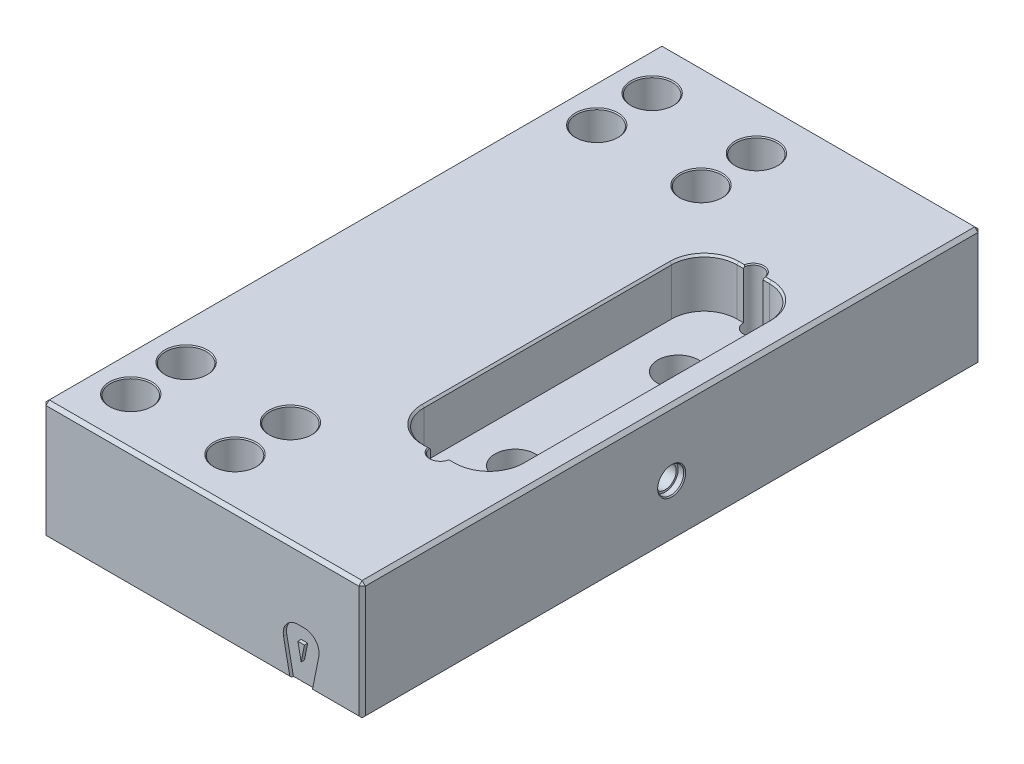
ISO-10303-21;
HEADER;
FILE_DESCRIPTION(('STEP AP214'),'2;1');
FILE_NAME('part.step','',(''),(''),'','','');
FILE_SCHEMA(('AUTOMOTIVE_DESIGN { 1 0 10303 214 1 1 1 1 }'));
ENDSEC;
DATA;
#1=APPLICATION_CONTEXT('core data for automotive mechanical design processes');
#2=APPLICATION_PROTOCOL_DEFINITION('international standard','automotive_design',2000,#1);
#3=PRODUCT_CONTEXT('',#1,'mechanical');
#4=PRODUCT('Part','Part','',(#3));
#5=PRODUCT_RELATED_PRODUCT_CATEGORY('part','',(#4));
#6=PRODUCT_DEFINITION_FORMATION('','',#4);
#7=PRODUCT_DEFINITION_CONTEXT('part definition',#1,'design');
#8=PRODUCT_DEFINITION('design','',#6,#7);
#9=PRODUCT_DEFINITION_SHAPE('','',#8);
#10=(LENGTH_UNIT() NAMED_UNIT(*) SI_UNIT(.MILLI.,.METRE.));
#11=(NAMED_UNIT(*) PLANE_ANGLE_UNIT() SI_UNIT($,.RADIAN.));
#12=(NAMED_UNIT(*) SI_UNIT($,.STERADIAN.) SOLID_ANGLE_UNIT());
#13=UNCERTAINTY_MEASURE_WITH_UNIT(LENGTH_MEASURE(1.E-05),#10,'distance_accuracy_value','');
#14=(GEOMETRIC_REPRESENTATION_CONTEXT(3) GLOBAL_UNCERTAINTY_ASSIGNED_CONTEXT((#13)) GLOBAL_UNIT_ASSIGNED_CONTEXT((#10,
#11,#12)) REPRESENTATION_CONTEXT('',''));
#15=CARTESIAN_POINT('',(0.,0.,0.));
#16=DIRECTION('',(0.,0.,1.));
#17=DIRECTION('',(1.,0.,0.));
#18=AXIS2_PLACEMENT_3D('',#15,#16,#17);
#19=CARTESIAN_POINT('',(-98.,36.,-95.));
#20=DIRECTION('',(0.,0.,1.));
#21=DIRECTION('',(1.,0.,0.));
#22=AXIS2_PLACEMENT_3D('',#19,#20,#21);
#23=PLANE('',#22);
#24=DIRECTION('',(0.196116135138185,-0.98058067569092,0.));
#25=VECTOR('',#24,1.);
#26=CARTESIAN_POINT('',(-24.1126130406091,10.1174773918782,-95.));
#27=LINE('',#26,#25);
#28=CARTESIAN_POINT('',(-24.1126130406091,10.1174773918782,-95.));
#29=VERTEX_POINT('',#28);
#30=CARTESIAN_POINT('',(-22.1891175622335,0.500000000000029,-95.));
#31=VERTEX_POINT('',#30);
#32=EDGE_CURVE('E442',#29,#31,#27,.T.);
#33=ORIENTED_EDGE('',*,*,#32,.T.);
#34=DIRECTION('',(-1.,0.,0.));
#35=VECTOR('',#34,1.);
#36=CARTESIAN_POINT('',(-98.,0.500000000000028,-95.));
#37=LINE('',#36,#35);
#38=CARTESIAN_POINT('',(-97.,0.500000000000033,-95.));
#39=VERTEX_POINT('',#38);
#40=EDGE_CURVE('E976',#31,#39,#37,.T.);
#41=ORIENTED_EDGE('',*,*,#40,.T.);
#42=DIRECTION('',(0.,1.,0.));
#43=VECTOR('',#42,1.);
#44=CARTESIAN_POINT('',(-97.,36.,-95.));
#45=LINE('',#44,#43);
#46=CARTESIAN_POINT('',(-97.,35.,-95.));
#47=VERTEX_POINT('',#46);
#48=EDGE_CURVE('E853',#39,#47,#45,.T.);
#49=ORIENTED_EDGE('',*,*,#48,.T.);
#50=DIRECTION('',(1.,0.,0.));
#51=VECTOR('',#50,1.);
#52=CARTESIAN_POINT('',(0.,35.,-95.));
#53=LINE('',#52,#51);
#54=CARTESIAN_POINT('',(-1.,35.,-95.));
#55=VERTEX_POINT('',#54);
#56=EDGE_CURVE('E835',#47,#55,#53,.T.);
#57=ORIENTED_EDGE('',*,*,#56,.T.);
#58=DIRECTION('',(0.,-1.,0.));
#59=VECTOR('',#58,1.);
#60=CARTESIAN_POINT('',(-1.,36.,-95.));
#61=LINE('',#60,#59);
#62=CARTESIAN_POINT('',(-1.,0.50000000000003,-95.));
#63=VERTEX_POINT('',#62);
#64=EDGE_CURVE('E855',#55,#63,#61,.T.);
#65=ORIENTED_EDGE('',*,*,#64,.T.);
#66=CARTESIAN_POINT('',(-15.2108824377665,0.500000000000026,-95.));
#67=VERTEX_POINT('',#66);
#68=EDGE_CURVE('E977',#63,#67,#37,.T.);
#69=ORIENTED_EDGE('',*,*,#68,.T.);
#70=DIRECTION('',(0.196116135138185,0.98058067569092,0.));
#71=VECTOR('',#70,1.);
#72=CARTESIAN_POINT('',(-13.2873869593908,10.1174773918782,-95.));
#73=LINE('',#72,#71);
#74=CARTESIAN_POINT('',(-13.2873869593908,10.1174773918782,-95.));
#75=VERTEX_POINT('',#74);
#76=EDGE_CURVE('E37',#67,#75,#73,.T.);
#77=ORIENTED_EDGE('',*,*,#76,.T.);
#78=CARTESIAN_POINT('',(-17.7,11.,-95.));
#79=DIRECTION('',(0.,0.,1.));
#80=DIRECTION('',(1.,0.,0.));
#81=AXIS2_PLACEMENT_3D('',#78,#79,#80);
#82=CIRCLE('',#81,4.5);
#83=CARTESIAN_POINT('',(-17.7,15.5,-95.));
#84=VERTEX_POINT('',#83);
#85=EDGE_CURVE('E459',#75,#84,#82,.T.);
#86=ORIENTED_EDGE('',*,*,#85,.T.);
#87=DIRECTION('',(-1.,0.,0.));
#88=VECTOR('',#87,1.);
#89=CARTESIAN_POINT('',(-19.7,15.5,-95.));
#90=LINE('',#89,#88);
#91=CARTESIAN_POINT('',(-19.7,15.5,-95.));
#92=VERTEX_POINT('',#91);
#93=EDGE_CURVE('E456',#84,#92,#90,.T.);
#94=ORIENTED_EDGE('',*,*,#93,.T.);
#95=CARTESIAN_POINT('',(-19.7,11.,-95.));
#96=DIRECTION('',(0.,0.,1.));
#97=DIRECTION('',(-1.,0.,0.));
#98=AXIS2_PLACEMENT_3D('',#95,#96,#97);
#99=CIRCLE('',#98,4.5);
#100=EDGE_CURVE('E436',#92,#29,#99,.T.);
#101=ORIENTED_EDGE('',*,*,#100,.T.);
#102=EDGE_LOOP('',(#33,#41,#49,#57,#65,#69,#77,#86,#94,#101));
#103=FACE_BOUND('',#102,.T.);
#104=ADVANCED_FACE('F14',(#103),#23,.F.);
#105=CARTESIAN_POINT('',(-98.,0.,95.));
#106=DIRECTION('',(0.,1.,0.));
#107=DIRECTION('',(0.,0.,1.));
#108=AXIS2_PLACEMENT_3D('',#105,#106,#107);
#109=PLANE('',#108);
#110=CARTESIAN_POINT('',(-23.,0.,-25.));
#111=DIRECTION('',(0.,-1.,0.));
#112=DIRECTION('',(0.,0.,-1.));
#113=AXIS2_PLACEMENT_3D('',#110,#111,#112);
#114=CIRCLE('',#113,10.3);
#115=CARTESIAN_POINT('',(-23.,0.,-35.3));
#116=VERTEX_POINT('',#115);
#117=EDGE_CURVE('E795',#116,#116,#114,.T.);
#118=ORIENTED_EDGE('',*,*,#117,.F.);
#119=EDGE_LOOP('',(#118));
#120=FACE_BOUND('',#119,.T.);
#121=CARTESIAN_POINT('',(-23.,0.,25.));
#122=DIRECTION('',(0.,-1.,0.));
#123=DIRECTION('',(0.,0.,-1.));
#124=AXIS2_PLACEMENT_3D('',#121,#122,#123);
#125=CIRCLE('',#124,10.3);
#126=CARTESIAN_POINT('',(-23.,0.,14.7));
#127=VERTEX_POINT('',#126);
#128=EDGE_CURVE('E783',#127,#127,#125,.T.);
#129=ORIENTED_EDGE('',*,*,#128,.F.);
#130=EDGE_LOOP('',(#129));
#131=FACE_BOUND('',#130,.T.);
#132=CARTESIAN_POINT('',(-54.,0.,-80.));
#133=DIRECTION('',(0.,1.,0.));
#134=DIRECTION('',(0.,0.,1.));
#135=AXIS2_PLACEMENT_3D('',#132,#133,#134);
#136=CIRCLE('',#135,6.55);
#137=CARTESIAN_POINT('',(-54.,0.,-73.45));
#138=VERTEX_POINT('',#137);
#139=EDGE_CURVE('E780',#138,#138,#136,.T.);
#140=ORIENTED_EDGE('',*,*,#139,.T.);
#141=EDGE_LOOP('',(#140));
#142=FACE_BOUND('',#141,.T.);
#143=CARTESIAN_POINT('',(-86.,0.,-80.));
#144=DIRECTION('',(0.,1.,0.));
#145=DIRECTION('',(0.,0.,1.));
#146=AXIS2_PLACEMENT_3D('',#143,#144,#145);
#147=CIRCLE('',#146,6.55);
#148=CARTESIAN_POINT('',(-86.,0.,-73.45));
#149=VERTEX_POINT('',#148);
#150=EDGE_CURVE('E768',#149,#149,#147,.T.);
#151=ORIENTED_EDGE('',*,*,#150,.T.);
#152=EDGE_LOOP('',(#151));
#153=FACE_BOUND('',#152,.T.);
#154=CARTESIAN_POINT('',(-54.,0.,80.));
#155=DIRECTION('',(0.,1.,0.));
#156=DIRECTION('',(0.,0.,1.));
#157=AXIS2_PLACEMENT_3D('',#154,#155,#156);
#158=CIRCLE('',#157,6.55);
#159=CARTESIAN_POINT('',(-54.,0.,86.55));
#160=VERTEX_POINT('',#159);
#161=EDGE_CURVE('E756',#160,#160,#158,.T.);
#162=ORIENTED_EDGE('',*,*,#161,.T.);
#163=EDGE_LOOP('',(#162));
#164=FACE_BOUND('',#163,.T.);
#165=CARTESIAN_POINT('',(-86.,0.,80.));
#166=DIRECTION('',(0.,1.,0.));
#167=DIRECTION('',(0.,0.,1.));
#168=AXIS2_PLACEMENT_3D('',#165,#166,#167);
#169=CIRCLE('',#168,6.55);
#170=CARTESIAN_POINT('',(-86.,0.,86.55));
#171=VERTEX_POINT('',#170);
#172=EDGE_CURVE('E744',#171,#171,#169,.T.);
#173=ORIENTED_EDGE('',*,*,#172,.T.);
#174=EDGE_LOOP('',(#173));
#175=FACE_BOUND('',#174,.T.);
#176=CARTESIAN_POINT('',(-54.,0.,-63.));
#177=DIRECTION('',(0.,1.,0.));
#178=DIRECTION('',(0.,0.,1.));
#179=AXIS2_PLACEMENT_3D('',#176,#177,#178);
#180=CIRCLE('',#179,6.55);
#181=CARTESIAN_POINT('',(-54.,0.,-56.45));
#182=VERTEX_POINT('',#181);
#183=EDGE_CURVE('E732',#182,#182,#180,.T.);
#184=ORIENTED_EDGE('',*,*,#183,.T.);
#185=EDGE_LOOP('',(#184));
#186=FACE_BOUND('',#185,.T.);
#187=CARTESIAN_POINT('',(-54.,0.,63.));
#188=DIRECTION('',(0.,1.,0.));
#189=DIRECTION('',(0.,0.,1.));
#190=AXIS2_PLACEMENT_3D('',#187,#188,#189);
#191=CIRCLE('',#190,6.55);
#192=CARTESIAN_POINT('',(-54.,0.,69.55));
#193=VERTEX_POINT('',#192);
#194=EDGE_CURVE('E720',#193,#193,#191,.T.);
#195=ORIENTED_EDGE('',*,*,#194,.T.);
#196=EDGE_LOOP('',(#195));
#197=FACE_BOUND('',#196,.T.);
#198=CARTESIAN_POINT('',(-86.,0.,63.));
#199=DIRECTION('',(0.,1.,0.));
#200=DIRECTION('',(0.,0.,1.));
#201=AXIS2_PLACEMENT_3D('',#198,#199,#200);
#202=CIRCLE('',#201,6.55);
#203=CARTESIAN_POINT('',(-86.,0.,69.55));
#204=VERTEX_POINT('',#203);
#205=EDGE_CURVE('E708',#204,#204,#202,.T.);
#206=ORIENTED_EDGE('',*,*,#205,.T.);
#207=EDGE_LOOP('',(#206));
#208=FACE_BOUND('',#207,.T.);
#209=CARTESIAN_POINT('',(-86.,0.,-63.));
#210=DIRECTION('',(0.,1.,0.));
#211=DIRECTION('',(0.,0.,1.));
#212=AXIS2_PLACEMENT_3D('',#209,#210,#211);
#213=CIRCLE('',#212,6.55);
#214=CARTESIAN_POINT('',(-86.,0.,-56.45));
#215=VERTEX_POINT('',#214);
#216=EDGE_CURVE('E696',#215,#215,#213,.T.);
#217=ORIENTED_EDGE('',*,*,#216,.T.);
#218=EDGE_LOOP('',(#217));
#219=FACE_BOUND('',#218,.T.);
#220=CARTESIAN_POINT('',(-23.,0.,-48.));
#221=DIRECTION('',(0.,-1.,0.));
#222=DIRECTION('',(0.,0.,-1.));
#223=AXIS2_PLACEMENT_3D('',#220,#221,#222);
#224=CIRCLE('',#223,4.6);
#225=CARTESIAN_POINT('',(-23.,0.,-52.6));
#226=VERTEX_POINT('',#225);
#227=EDGE_CURVE('E649',#226,#226,#224,.T.);
#228=ORIENTED_EDGE('',*,*,#227,.F.);
#229=EDGE_LOOP('',(#228));
#230=FACE_BOUND('',#229,.T.);
#231=CARTESIAN_POINT('',(-23.,0.,48.));
#232=DIRECTION('',(0.,-1.,0.));
#233=DIRECTION('',(0.,0.,-1.));
#234=AXIS2_PLACEMENT_3D('',#231,#232,#233);
#235=CIRCLE('',#234,4.6);
#236=CARTESIAN_POINT('',(-23.,0.,43.4));
#237=VERTEX_POINT('',#236);
#238=EDGE_CURVE('E639',#237,#237,#235,.T.);
#239=ORIENTED_EDGE('',*,*,#238,.F.);
#240=EDGE_LOOP('',(#239));
#241=FACE_BOUND('',#240,.T.);
#242=DIRECTION('',(0.,0.,-1.));
#243=VECTOR('',#242,1.);
#244=CARTESIAN_POINT('',(-22.0891175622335,0.,-94.));
#245=LINE('',#244,#243);
#246=CARTESIAN_POINT('',(-22.0891175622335,0.,-94.));
#247=VERTEX_POINT('',#246);
#248=CARTESIAN_POINT('',(-22.0891175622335,0.,-94.5));
#249=VERTEX_POINT('',#248);
#250=EDGE_CURVE('E469',#247,#249,#245,.T.);
#251=ORIENTED_EDGE('',*,*,#250,.F.);
#252=DIRECTION('',(1.,0.,0.));
#253=VECTOR('',#252,1.);
#254=CARTESIAN_POINT('',(-22.0891175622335,0.,-94.));
#255=LINE('',#254,#253);
#256=CARTESIAN_POINT('',(-15.3108824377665,0.,-94.));
#257=VERTEX_POINT('',#256);
#258=EDGE_CURVE('E448',#247,#257,#255,.T.);
#259=ORIENTED_EDGE('',*,*,#258,.T.);
#260=DIRECTION('',(0.,0.,-1.));
#261=VECTOR('',#260,1.);
#262=CARTESIAN_POINT('',(-15.3108824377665,0.,-94.));
#263=LINE('',#262,#261);
#264=CARTESIAN_POINT('',(-15.3108824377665,0.,-94.5));
#265=VERTEX_POINT('',#264);
#266=EDGE_CURVE('E471',#257,#265,#263,.T.);
#267=ORIENTED_EDGE('',*,*,#266,.T.);
#268=DIRECTION('',(1.,0.,0.));
#269=VECTOR('',#268,1.);
#270=CARTESIAN_POINT('',(-98.,0.,-94.5));
#271=LINE('',#270,#269);
#272=CARTESIAN_POINT('',(-0.499999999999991,0.,-94.5));
#273=VERTEX_POINT('',#272);
#274=EDGE_CURVE('E930',#265,#273,#271,.T.);
#275=ORIENTED_EDGE('',*,*,#274,.T.);
#276=DIRECTION('',(0.,0.,1.));
#277=VECTOR('',#276,1.);
#278=CARTESIAN_POINT('',(-0.499999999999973,0.,95.));
#279=LINE('',#278,#277);
#280=CARTESIAN_POINT('',(-0.499999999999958,0.,94.5));
#281=VERTEX_POINT('',#280);
#282=EDGE_CURVE('E934',#273,#281,#279,.T.);
#283=ORIENTED_EDGE('',*,*,#282,.T.);
#284=DIRECTION('',(-1.,0.,0.));
#285=VECTOR('',#284,1.);
#286=CARTESIAN_POINT('',(-98.,0.,94.5));
#287=LINE('',#286,#285);
#288=CARTESIAN_POINT('',(-15.3108824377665,0.,94.5));
#289=VERTEX_POINT('',#288);
#290=EDGE_CURVE('E940',#281,#289,#287,.T.);
#291=ORIENTED_EDGE('',*,*,#290,.T.);
#292=DIRECTION('',(0.,0.,1.));
#293=VECTOR('',#292,1.);
#294=CARTESIAN_POINT('',(-15.3108824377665,0.,94.));
#295=LINE('',#294,#293);
#296=CARTESIAN_POINT('',(-15.3108824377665,0.,94.));
#297=VERTEX_POINT('',#296);
#298=EDGE_CURVE('E543',#297,#289,#295,.T.);
#299=ORIENTED_EDGE('',*,*,#298,.F.);
#300=DIRECTION('',(1.,0.,0.));
#301=VECTOR('',#300,1.);
#302=CARTESIAN_POINT('',(-22.0891175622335,0.,94.));
#303=LINE('',#302,#301);
#304=CARTESIAN_POINT('',(-22.0891175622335,0.,94.));
#305=VERTEX_POINT('',#304);
#306=EDGE_CURVE('E511',#305,#297,#303,.T.);
#307=ORIENTED_EDGE('',*,*,#306,.F.);
#308=DIRECTION('',(0.,0.,1.));
#309=VECTOR('',#308,1.);
#310=CARTESIAN_POINT('',(-22.0891175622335,0.,94.));
#311=LINE('',#310,#309);
#312=CARTESIAN_POINT('',(-22.0891175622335,0.,94.5));
#313=VERTEX_POINT('',#312);
#314=EDGE_CURVE('E545',#305,#313,#311,.T.);
#315=ORIENTED_EDGE('',*,*,#314,.T.);
#316=CARTESIAN_POINT('',(-97.5,0.,94.5));
#317=VERTEX_POINT('',#316);
#318=EDGE_CURVE('E939',#313,#317,#287,.T.);
#319=ORIENTED_EDGE('',*,*,#318,.T.);
#320=DIRECTION('',(0.,0.,-1.));
#321=VECTOR('',#320,1.);
#322=CARTESIAN_POINT('',(-97.5,0.,95.));
#323=LINE('',#322,#321);
#324=CARTESIAN_POINT('',(-97.5,0.,10.3));
#325=VERTEX_POINT('',#324);
#326=EDGE_CURVE('E943',#317,#325,#323,.T.);
#327=ORIENTED_EDGE('',*,*,#326,.T.);
#328=DIRECTION('',(1.,0.,0.));
#329=VECTOR('',#328,1.);
#330=CARTESIAN_POINT('',(-98.,0.,10.3));
#331=LINE('',#330,#329);
#332=CARTESIAN_POINT('',(-38.,0.,10.3));
#333=VERTEX_POINT('',#332);
#334=EDGE_CURVE('E812',#325,#333,#331,.T.);
#335=ORIENTED_EDGE('',*,*,#334,.T.);
#336=CARTESIAN_POINT('',(-38.,0.,0.));
#337=DIRECTION('',(0.,1.,0.));
#338=DIRECTION('',(0.,0.,1.));
#339=AXIS2_PLACEMENT_3D('',#336,#337,#338);
#340=CIRCLE('',#339,10.3);
#341=CARTESIAN_POINT('',(-38.,0.,-10.3));
#342=VERTEX_POINT('',#341);
#343=EDGE_CURVE('E814',#333,#342,#340,.T.);
#344=ORIENTED_EDGE('',*,*,#343,.T.);
#345=DIRECTION('',(-1.,0.,0.));
#346=VECTOR('',#345,1.);
#347=CARTESIAN_POINT('',(-98.,0.,-10.3));
#348=LINE('',#347,#346);
#349=CARTESIAN_POINT('',(-97.5,0.,-10.3));
#350=VERTEX_POINT('',#349);
#351=EDGE_CURVE('E816',#342,#350,#348,.T.);
#352=ORIENTED_EDGE('',*,*,#351,.T.);
#353=DIRECTION('',(0.,0.,-1.));
#354=VECTOR('',#353,1.);
#355=CARTESIAN_POINT('',(-97.5,0.,95.));
#356=LINE('',#355,#354);
#357=CARTESIAN_POINT('',(-97.5,0.,-94.5));
#358=VERTEX_POINT('',#357);
#359=EDGE_CURVE('E936',#350,#358,#356,.T.);
#360=ORIENTED_EDGE('',*,*,#359,.T.);
#361=EDGE_CURVE('E931',#358,#249,#271,.T.);
#362=ORIENTED_EDGE('',*,*,#361,.T.);
#363=EDGE_LOOP('',(#251,#259,#267,#275,#283,#291,#299,#307,#315,#319,#327,#335,#344,#352,#360,#362));
#364=FACE_BOUND('',#363,.T.);
#365=ADVANCED_FACE('F1177',(#120,#131,#142,#153,#164,#175,#186,#197,#208,#219,#230,#241,#364),
#109,.F.);
#366=CARTESIAN_POINT('',(-98.,0.500000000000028,-95.));
#367=DIRECTION('',(0.,0.707106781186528,0.707106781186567));
#368=DIRECTION('',(0.,-0.707106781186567,0.707106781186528));
#369=AXIS2_PLACEMENT_3D('',#366,#367,#368);
#370=PLANE('',#369);
#371=ORIENTED_EDGE('',*,*,#40,.F.);
#372=DIRECTION('',(-0.140028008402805,0.700140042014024,-0.700140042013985));
#373=VECTOR('',#372,1.);
#374=CARTESIAN_POINT('',(-23.6756054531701,7.93243945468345,-102.432439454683));
#375=LINE('',#374,#373);
#376=EDGE_CURVE('E9',#31,#249,#375,.F.);
#377=ORIENTED_EDGE('',*,*,#376,.T.);
#378=ORIENTED_EDGE('',*,*,#361,.F.);
#379=DIRECTION('',(-0.577350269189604,-0.577350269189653,0.57735026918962));
#380=VECTOR('',#379,1.);
#381=CARTESIAN_POINT('',(-85.8333333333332,11.6666666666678,-106.166666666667));
#382=LINE('',#381,#380);
#383=EDGE_CURVE('E964',#39,#358,#382,.T.);
#384=ORIENTED_EDGE('',*,*,#383,.F.);
#385=EDGE_LOOP('',(#371,#377,#378,#384));
#386=FACE_BOUND('',#385,.T.);
#387=ADVANCED_FACE('F1180',(#386),#370,.F.);
#388=ORIENTED_EDGE('',*,*,#274,.F.);
#389=DIRECTION('',(-0.140028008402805,-0.700140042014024,0.700140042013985));
#390=VECTOR('',#389,1.);
#391=CARTESIAN_POINT('',(-16.8341984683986,-7.61658015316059,-86.8834198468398));
#392=LINE('',#391,#390);
#393=EDGE_CURVE('E22',#265,#67,#392,.F.);
#394=ORIENTED_EDGE('',*,*,#393,.T.);
#395=ORIENTED_EDGE('',*,*,#68,.F.);
#396=DIRECTION('',(-0.577350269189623,0.577350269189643,-0.577350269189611));
#397=VECTOR('',#396,1.);
#398=CARTESIAN_POINT('',(-12.8333333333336,12.3333333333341,-106.833333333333));
#399=LINE('',#398,#397);
#400=EDGE_CURVE('E971',#273,#63,#399,.T.);
#401=ORIENTED_EDGE('',*,*,#400,.F.);
#402=EDGE_LOOP('',(#388,#394,#395,#401));
#403=FACE_BOUND('',#402,.T.);
#404=ADVANCED_FACE('F1286',(#403),#370,.F.);
#405=CARTESIAN_POINT('',(-98.,0.500000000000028,95.));
#406=DIRECTION('',(0.,0.707106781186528,-0.707106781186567));
#407=DIRECTION('',(0.,0.707106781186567,0.707106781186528));
#408=AXIS2_PLACEMENT_3D('',#405,#406,#407);
#409=PLANE('',#408);
#410=DIRECTION('',(-0.140028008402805,-0.700140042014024,-0.700140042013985));
#411=VECTOR('',#410,1.);
#412=CARTESIAN_POINT('',(-16.8341984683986,-7.61658015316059,86.8834198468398));
#413=LINE('',#412,#411);
#414=CARTESIAN_POINT('',(-15.2108824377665,0.500000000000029,95.));
#415=VERTEX_POINT('',#414);
#416=EDGE_CURVE('E1609',#289,#415,#413,.F.);
#417=ORIENTED_EDGE('',*,*,#416,.F.);
#418=ORIENTED_EDGE('',*,*,#290,.F.);
#419=DIRECTION('',(0.577350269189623,-0.577350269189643,-0.577350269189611));
#420=VECTOR('',#419,1.);
#421=CARTESIAN_POINT('',(-12.166666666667,11.6666666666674,106.166666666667));
#422=LINE('',#421,#420);
#423=CARTESIAN_POINT('',(-1.,0.50000000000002,95.));
#424=VERTEX_POINT('',#423);
#425=EDGE_CURVE('E927',#424,#281,#422,.T.);
#426=ORIENTED_EDGE('',*,*,#425,.F.);
#427=DIRECTION('',(1.,0.,0.));
#428=VECTOR('',#427,1.);
#429=CARTESIAN_POINT('',(-98.,0.500000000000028,95.));
#430=LINE('',#429,#428);
#431=EDGE_CURVE('E888',#415,#424,#430,.T.);
#432=ORIENTED_EDGE('',*,*,#431,.F.);
#433=EDGE_LOOP('',(#417,#418,#426,#432));
#434=FACE_BOUND('',#433,.T.);
#435=ADVANCED_FACE('F1197',(#434),#409,.F.);
#436=CARTESIAN_POINT('',(-98.,36.,-95.));
#437=DIRECTION('',(1.,0.,0.));
#438=DIRECTION('',(0.,0.,-1.));
#439=AXIS2_PLACEMENT_3D('',#436,#437,#438);
#440=PLANE('',#439);
#441=CARTESIAN_POINT('',(-98.,16.,0.));
#442=DIRECTION('',(1.,0.,0.));
#443=DIRECTION('',(0.,0.,-1.));
#444=AXIS2_PLACEMENT_3D('',#441,#442,#443);
#445=CIRCLE('',#444,4.3);
#446=CARTESIAN_POINT('',(-98.,16.,-4.3));
#447=VERTEX_POINT('',#446);
#448=EDGE_CURVE('E1619',#447,#447,#445,.T.);
#449=ORIENTED_EDGE('',*,*,#448,.T.);
#450=EDGE_LOOP('',(#449));
#451=FACE_BOUND('',#450,.T.);
#452=DIRECTION('',(0.,-1.,0.));
#453=VECTOR('',#452,1.);
#454=CARTESIAN_POINT('',(-98.,36.,10.3));
#455=LINE('',#454,#453);
#456=CARTESIAN_POINT('',(-98.,6.3,10.3));
#457=VERTEX_POINT('',#456);
#458=CARTESIAN_POINT('',(-98.,0.500000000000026,10.3));
#459=VERTEX_POINT('',#458);
#460=EDGE_CURVE('E823',#457,#459,#455,.T.);
#461=ORIENTED_EDGE('',*,*,#460,.T.);
#462=DIRECTION('',(0.,0.,1.));
#463=VECTOR('',#462,1.);
#464=CARTESIAN_POINT('',(-98.,0.500000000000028,-95.));
#465=LINE('',#464,#463);
#466=CARTESIAN_POINT('',(-98.,0.500000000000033,94.));
#467=VERTEX_POINT('',#466);
#468=EDGE_CURVE('E953',#459,#467,#465,.T.);
#469=ORIENTED_EDGE('',*,*,#468,.T.);
#470=DIRECTION('',(0.,1.,0.));
#471=VECTOR('',#470,1.);
#472=CARTESIAN_POINT('',(-98.,36.,94.));
#473=LINE('',#472,#471);
#474=CARTESIAN_POINT('',(-98.,35.,94.));
#475=VERTEX_POINT('',#474);
#476=EDGE_CURVE('E867',#467,#475,#473,.T.);
#477=ORIENTED_EDGE('',*,*,#476,.T.);
#478=DIRECTION('',(0.,0.,-1.));
#479=VECTOR('',#478,1.);
#480=CARTESIAN_POINT('',(-98.,35.,-95.));
#481=LINE('',#480,#479);
#482=CARTESIAN_POINT('',(-98.,35.,-94.));
#483=VERTEX_POINT('',#482);
#484=EDGE_CURVE('E865',#475,#483,#481,.T.);
#485=ORIENTED_EDGE('',*,*,#484,.T.);
#486=DIRECTION('',(0.,-1.,0.));
#487=VECTOR('',#486,1.);
#488=CARTESIAN_POINT('',(-98.,36.,-94.));
#489=LINE('',#488,#487);
#490=CARTESIAN_POINT('',(-98.,0.50000000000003,-94.));
#491=VERTEX_POINT('',#490);
#492=EDGE_CURVE('E869',#483,#491,#489,.T.);
#493=ORIENTED_EDGE('',*,*,#492,.T.);
#494=DIRECTION('',(0.,0.,1.));
#495=VECTOR('',#494,1.);
#496=CARTESIAN_POINT('',(-98.,0.500000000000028,-95.));
#497=LINE('',#496,#495);
#498=CARTESIAN_POINT('',(-98.,0.500000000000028,-10.3));
#499=VERTEX_POINT('',#498);
#500=EDGE_CURVE('E950',#491,#499,#497,.T.);
#501=ORIENTED_EDGE('',*,*,#500,.T.);
#502=DIRECTION('',(0.,1.,0.));
#503=VECTOR('',#502,1.);
#504=CARTESIAN_POINT('',(-98.,36.,-10.3));
#505=LINE('',#504,#503);
#506=CARTESIAN_POINT('',(-98.,6.3,-10.3));
#507=VERTEX_POINT('',#506);
#508=EDGE_CURVE('E826',#499,#507,#505,.T.);
#509=ORIENTED_EDGE('',*,*,#508,.T.);
#510=DIRECTION('',(0.,0.,1.));
#511=VECTOR('',#510,1.);
#512=CARTESIAN_POINT('',(-98.,6.3,10.));
#513=LINE('',#512,#511);
#514=EDGE_CURVE('E821',#507,#457,#513,.T.);
#515=ORIENTED_EDGE('',*,*,#514,.T.);
#516=EDGE_LOOP('',(#461,#469,#477,#485,#493,#501,#509,#515));
#517=FACE_BOUND('',#516,.T.);
#518=ADVANCED_FACE('F1192',(#451,#517),#440,.F.);
#519=CARTESIAN_POINT('',(-98.,36.,95.));
#520=DIRECTION('',(0.,0.,-1.));
#521=DIRECTION('',(-1.,0.,0.));
#522=AXIS2_PLACEMENT_3D('',#519,#520,#521);
#523=PLANE('',#522);
#524=CARTESIAN_POINT('',(-17.7,11.,95.));
#525=DIRECTION('',(0.,0.,1.));
#526=DIRECTION('',(1.,0.,0.));
#527=AXIS2_PLACEMENT_3D('',#524,#525,#526);
#528=CIRCLE('',#527,4.5);
#529=CARTESIAN_POINT('',(-13.2873869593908,10.1174773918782,95.));
#530=VERTEX_POINT('',#529);
#531=CARTESIAN_POINT('',(-17.7,15.5,95.));
#532=VERTEX_POINT('',#531);
#533=EDGE_CURVE('E530',#530,#532,#528,.T.);
#534=ORIENTED_EDGE('',*,*,#533,.F.);
#535=DIRECTION('',(0.196116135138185,0.98058067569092,0.));
#536=VECTOR('',#535,1.);
#537=CARTESIAN_POINT('',(-13.2873869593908,10.1174773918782,95.));
#538=LINE('',#537,#536);
#539=EDGE_CURVE('E528',#415,#530,#538,.T.);
#540=ORIENTED_EDGE('',*,*,#539,.F.);
#541=ORIENTED_EDGE('',*,*,#431,.T.);
#542=DIRECTION('',(0.,1.,0.));
#543=VECTOR('',#542,1.);
#544=CARTESIAN_POINT('',(-1.,36.,95.));
#545=LINE('',#544,#543);
#546=CARTESIAN_POINT('',(-1.,35.,95.));
#547=VERTEX_POINT('',#546);
#548=EDGE_CURVE('E886',#424,#547,#545,.T.);
#549=ORIENTED_EDGE('',*,*,#548,.T.);
#550=DIRECTION('',(-1.,0.,0.));
#551=VECTOR('',#550,1.);
#552=CARTESIAN_POINT('',(-98.,35.,95.));
#553=LINE('',#552,#551);
#554=CARTESIAN_POINT('',(-97.,35.,95.));
#555=VERTEX_POINT('',#554);
#556=EDGE_CURVE('E881',#547,#555,#553,.T.);
#557=ORIENTED_EDGE('',*,*,#556,.T.);
#558=DIRECTION('',(0.,-1.,0.));
#559=VECTOR('',#558,1.);
#560=CARTESIAN_POINT('',(-97.,36.,95.));
#561=LINE('',#560,#559);
#562=CARTESIAN_POINT('',(-97.,0.50000000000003,95.));
#563=VERTEX_POINT('',#562);
#564=EDGE_CURVE('E883',#555,#563,#561,.T.);
#565=ORIENTED_EDGE('',*,*,#564,.T.);
#566=CARTESIAN_POINT('',(-22.1891175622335,0.500000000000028,95.));
#567=VERTEX_POINT('',#566);
#568=EDGE_CURVE('E922',#563,#567,#430,.T.);
#569=ORIENTED_EDGE('',*,*,#568,.T.);
#570=DIRECTION('',(0.196116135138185,-0.98058067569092,0.));
#571=VECTOR('',#570,1.);
#572=CARTESIAN_POINT('',(-24.1126130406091,10.1174773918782,95.));
#573=LINE('',#572,#571);
#574=CARTESIAN_POINT('',(-24.1126130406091,10.1174773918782,95.));
#575=VERTEX_POINT('',#574);
#576=EDGE_CURVE('E526',#575,#567,#573,.T.);
#577=ORIENTED_EDGE('',*,*,#576,.F.);
#578=CARTESIAN_POINT('',(-19.7,11.,95.));
#579=DIRECTION('',(0.,0.,1.));
#580=DIRECTION('',(-1.,0.,0.));
#581=AXIS2_PLACEMENT_3D('',#578,#579,#580);
#582=CIRCLE('',#581,4.5);
#583=CARTESIAN_POINT('',(-19.7,15.5,95.));
#584=VERTEX_POINT('',#583);
#585=EDGE_CURVE('E499',#584,#575,#582,.T.);
#586=ORIENTED_EDGE('',*,*,#585,.F.);
#587=DIRECTION('',(-1.,0.,0.));
#588=VECTOR('',#587,1.);
#589=CARTESIAN_POINT('',(-19.7,15.5,95.));
#590=LINE('',#589,#588);
#591=EDGE_CURVE('E508',#532,#584,#590,.T.);
#592=ORIENTED_EDGE('',*,*,#591,.F.);
#593=EDGE_LOOP('',(#534,#540,#541,#549,#557,#565,#569,#577,#586,#592));
#594=FACE_BOUND('',#593,.T.);
#595=ADVANCED_FACE('F1188',(#594),#523,.F.);
#596=CARTESIAN_POINT('',(0.,36.,-95.));
#597=DIRECTION('',(-1.,0.,0.));
#598=DIRECTION('',(0.,0.,1.));
#599=AXIS2_PLACEMENT_3D('',#596,#597,#598);
#600=PLANE('',#599);
#601=CARTESIAN_POINT('',(0.,16.,0.));
#602=DIRECTION('',(-1.,0.,0.));
#603=DIRECTION('',(0.,0.,1.));
#604=AXIS2_PLACEMENT_3D('',#601,#602,#603);
#605=CIRCLE('',#604,4.30000000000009);
#606=CARTESIAN_POINT('',(0.,16.,4.30000000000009));
#607=VERTEX_POINT('',#606);
#608=EDGE_CURVE('E1610',#607,#607,#605,.T.);
#609=ORIENTED_EDGE('',*,*,#608,.T.);
#610=EDGE_LOOP('',(#609));
#611=FACE_BOUND('',#610,.T.);
#612=DIRECTION('',(0.,-1.,0.));
#613=VECTOR('',#612,1.);
#614=CARTESIAN_POINT('',(0.,36.,94.));
#615=LINE('',#614,#613);
#616=CARTESIAN_POINT('',(0.,35.,94.));
#617=VERTEX_POINT('',#616);
#618=CARTESIAN_POINT('',(0.,0.500000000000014,94.));
#619=VERTEX_POINT('',#618);
#620=EDGE_CURVE('E860',#617,#619,#615,.T.);
#621=ORIENTED_EDGE('',*,*,#620,.T.);
#622=DIRECTION('',(0.,0.,-1.));
#623=VECTOR('',#622,1.);
#624=CARTESIAN_POINT('',(0.,0.500000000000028,-95.));
#625=LINE('',#624,#623);
#626=CARTESIAN_POINT('',(0.,0.50000000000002,-94.));
#627=VERTEX_POINT('',#626);
#628=EDGE_CURVE('E968',#619,#627,#625,.T.);
#629=ORIENTED_EDGE('',*,*,#628,.T.);
#630=DIRECTION('',(0.,1.,0.));
#631=VECTOR('',#630,1.);
#632=CARTESIAN_POINT('',(0.,36.,-94.));
#633=LINE('',#632,#631);
#634=CARTESIAN_POINT('',(0.,35.,-94.));
#635=VERTEX_POINT('',#634);
#636=EDGE_CURVE('E863',#627,#635,#633,.T.);
#637=ORIENTED_EDGE('',*,*,#636,.T.);
#638=DIRECTION('',(0.,0.,1.));
#639=VECTOR('',#638,1.);
#640=CARTESIAN_POINT('',(0.,35.,95.));
#641=LINE('',#640,#639);
#642=EDGE_CURVE('E858',#635,#617,#641,.T.);
#643=ORIENTED_EDGE('',*,*,#642,.T.);
#644=EDGE_LOOP('',(#621,#629,#637,#643));
#645=FACE_BOUND('',#644,.T.);
#646=ADVANCED_FACE('F1175',(#611,#645),#600,.F.);
#647=CARTESIAN_POINT('',(-98.,36.,95.));
#648=DIRECTION('',(0.,1.,0.));
#649=DIRECTION('',(0.,0.,1.));
#650=AXIS2_PLACEMENT_3D('',#647,#648,#649);
#651=PLANE('',#650);
#652=CARTESIAN_POINT('',(-23.,36.,48.));
#653=DIRECTION('',(0.,1.,0.));
#654=DIRECTION('',(0.,0.,1.));
#655=AXIS2_PLACEMENT_3D('',#652,#653,#654);
#656=CIRCLE('',#655,3.3);
#657=CARTESIAN_POINT('',(-26.2449961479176,36.,48.6));
#658=VERTEX_POINT('',#657);
#659=CARTESIAN_POINT('',(-19.7550038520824,36.,48.6));
#660=VERTEX_POINT('',#659);
#661=EDGE_CURVE('E665',#658,#660,#656,.T.);
#662=ORIENTED_EDGE('',*,*,#661,.F.);
#663=DIRECTION('',(-1.,0.,0.));
#664=VECTOR('',#663,1.);
#665=CARTESIAN_POINT('',(-28.,36.,48.6));
#666=LINE('',#665,#664);
#667=CARTESIAN_POINT('',(-28.,36.,48.6));
#668=VERTEX_POINT('',#667);
#669=EDGE_CURVE('E1683',#658,#668,#666,.T.);
#670=ORIENTED_EDGE('',*,*,#669,.T.);
#671=CARTESIAN_POINT('',(-28.,36.,38.));
#672=DIRECTION('',(0.,1.,0.));
#673=DIRECTION('',(0.,0.,1.));
#674=AXIS2_PLACEMENT_3D('',#671,#672,#673);
#675=CIRCLE('',#674,10.6);
#676=CARTESIAN_POINT('',(-38.6,36.,38.));
#677=VERTEX_POINT('',#676);
#678=EDGE_CURVE('E1687',#668,#677,#675,.F.);
#679=ORIENTED_EDGE('',*,*,#678,.T.);
#680=DIRECTION('',(0.,0.,-1.));
#681=VECTOR('',#680,1.);
#682=CARTESIAN_POINT('',(-38.6,36.,-38.));
#683=LINE('',#682,#681);
#684=CARTESIAN_POINT('',(-38.6,36.,-38.));
#685=VERTEX_POINT('',#684);
#686=EDGE_CURVE('E1691',#677,#685,#683,.T.);
#687=ORIENTED_EDGE('',*,*,#686,.T.);
#688=CARTESIAN_POINT('',(-28.,36.,-38.));
#689=DIRECTION('',(0.,1.,0.));
#690=DIRECTION('',(0.,0.,1.));
#691=AXIS2_PLACEMENT_3D('',#688,#689,#690);
#692=CIRCLE('',#691,10.6);
#693=CARTESIAN_POINT('',(-28.,36.,-48.6));
#694=VERTEX_POINT('',#693);
#695=EDGE_CURVE('E1693',#685,#694,#692,.F.);
#696=ORIENTED_EDGE('',*,*,#695,.T.);
#697=DIRECTION('',(1.,0.,0.));
#698=VECTOR('',#697,1.);
#699=CARTESIAN_POINT('',(-26.3,36.,-48.6));
#700=LINE('',#699,#698);
#701=CARTESIAN_POINT('',(-26.2449961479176,36.,-48.6));
#702=VERTEX_POINT('',#701);
#703=EDGE_CURVE('E1689',#694,#702,#700,.T.);
#704=ORIENTED_EDGE('',*,*,#703,.T.);
#705=CARTESIAN_POINT('',(-23.,36.,-48.));
#706=DIRECTION('',(0.,1.,0.));
#707=DIRECTION('',(0.,0.,1.));
#708=AXIS2_PLACEMENT_3D('',#705,#706,#707);
#709=CIRCLE('',#708,3.3);
#710=CARTESIAN_POINT('',(-19.7550038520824,36.,-48.6));
#711=VERTEX_POINT('',#710);
#712=EDGE_CURVE('E659',#711,#702,#709,.T.);
#713=ORIENTED_EDGE('',*,*,#712,.F.);
#714=DIRECTION('',(1.,0.,0.));
#715=VECTOR('',#714,1.);
#716=CARTESIAN_POINT('',(-18.,36.,-48.6));
#717=LINE('',#716,#715);
#718=CARTESIAN_POINT('',(-18.,36.,-48.6));
#719=VERTEX_POINT('',#718);
#720=EDGE_CURVE('E1678',#711,#719,#717,.T.);
#721=ORIENTED_EDGE('',*,*,#720,.T.);
#722=CARTESIAN_POINT('',(-18.,36.,-38.));
#723=DIRECTION('',(0.,1.,0.));
#724=DIRECTION('',(0.,0.,1.));
#725=AXIS2_PLACEMENT_3D('',#722,#723,#724);
#726=CIRCLE('',#725,10.6);
#727=CARTESIAN_POINT('',(-7.4,36.,-38.));
#728=VERTEX_POINT('',#727);
#729=EDGE_CURVE('E1700',#719,#728,#726,.F.);
#730=ORIENTED_EDGE('',*,*,#729,.T.);
#731=DIRECTION('',(0.,0.,1.));
#732=VECTOR('',#731,1.);
#733=CARTESIAN_POINT('',(-7.4,36.,38.));
#734=LINE('',#733,#732);
#735=CARTESIAN_POINT('',(-7.4,36.,38.));
#736=VERTEX_POINT('',#735);
#737=EDGE_CURVE('E1701',#728,#736,#734,.T.);
#738=ORIENTED_EDGE('',*,*,#737,.T.);
#739=CARTESIAN_POINT('',(-18.,36.,38.));
#740=DIRECTION('',(0.,1.,0.));
#741=DIRECTION('',(0.,0.,1.));
#742=AXIS2_PLACEMENT_3D('',#739,#740,#741);
#743=CIRCLE('',#742,10.6);
#744=CARTESIAN_POINT('',(-18.,36.,48.6));
#745=VERTEX_POINT('',#744);
#746=EDGE_CURVE('E1698',#736,#745,#743,.F.);
#747=ORIENTED_EDGE('',*,*,#746,.T.);
#748=DIRECTION('',(-1.,0.,0.));
#749=VECTOR('',#748,1.);
#750=CARTESIAN_POINT('',(-19.7,36.,48.6));
#751=LINE('',#750,#749);
#752=EDGE_CURVE('E1695',#745,#660,#751,.T.);
#753=ORIENTED_EDGE('',*,*,#752,.T.);
#754=EDGE_LOOP('',(#662,#670,#679,#687,#696,#704,#713,#721,#730,#738,#747,#753));
#755=FACE_BOUND('',#754,.T.);
#756=DIRECTION('',(0.,0.,-1.));
#757=VECTOR('',#756,1.);
#758=CARTESIAN_POINT('',(-1.,36.,-95.));
#759=LINE('',#758,#757);
#760=CARTESIAN_POINT('',(-1.,36.,94.));
#761=VERTEX_POINT('',#760);
#762=CARTESIAN_POINT('',(-1.,36.,-94.));
#763=VERTEX_POINT('',#762);
#764=EDGE_CURVE('E872',#761,#763,#759,.T.);
#765=ORIENTED_EDGE('',*,*,#764,.T.);
#766=DIRECTION('',(-1.,0.,0.));
#767=VECTOR('',#766,1.);
#768=CARTESIAN_POINT('',(-98.,36.,-94.));
#769=LINE('',#768,#767);
#770=CARTESIAN_POINT('',(-97.,36.,-94.));
#771=VERTEX_POINT('',#770);
#772=EDGE_CURVE('E878',#763,#771,#769,.T.);
#773=ORIENTED_EDGE('',*,*,#772,.T.);
#774=DIRECTION('',(0.,0.,1.));
#775=VECTOR('',#774,1.);
#776=CARTESIAN_POINT('',(-97.,36.,95.));
#777=LINE('',#776,#775);
#778=CARTESIAN_POINT('',(-97.,36.,94.));
#779=VERTEX_POINT('',#778);
#780=EDGE_CURVE('E876',#771,#779,#777,.T.);
#781=ORIENTED_EDGE('',*,*,#780,.T.);
#782=DIRECTION('',(1.,0.,0.));
#783=VECTOR('',#782,1.);
#784=CARTESIAN_POINT('',(0.,36.,94.));
#785=LINE('',#784,#783);
#786=EDGE_CURVE('E874',#779,#761,#785,.T.);
#787=ORIENTED_EDGE('',*,*,#786,.T.);
#788=EDGE_LOOP('',(#765,#773,#781,#787));
#789=FACE_BOUND('',#788,.T.);
#790=CARTESIAN_POINT('',(-86.,36.,-63.));
#791=DIRECTION('',(0.,1.,0.));
#792=DIRECTION('',(0.,0.,1.));
#793=AXIS2_PLACEMENT_3D('',#790,#791,#792);
#794=CIRCLE('',#793,6.55);
#795=CARTESIAN_POINT('',(-86.,36.,-56.45));
#796=VERTEX_POINT('',#795);
#797=EDGE_CURVE('E685',#796,#796,#794,.T.);
#798=ORIENTED_EDGE('',*,*,#797,.F.);
#799=EDGE_LOOP('',(#798));
#800=FACE_BOUND('',#799,.T.);
#801=CARTESIAN_POINT('',(-86.,36.,63.));
#802=DIRECTION('',(0.,1.,0.));
#803=DIRECTION('',(0.,0.,1.));
#804=AXIS2_PLACEMENT_3D('',#801,#802,#803);
#805=CIRCLE('',#804,6.55);
#806=CARTESIAN_POINT('',(-86.,36.,69.55));
#807=VERTEX_POINT('',#806);
#808=EDGE_CURVE('E699',#807,#807,#805,.T.);
#809=ORIENTED_EDGE('',*,*,#808,.F.);
#810=EDGE_LOOP('',(#809));
#811=FACE_BOUND('',#810,.T.);
#812=CARTESIAN_POINT('',(-54.,36.,63.));
#813=DIRECTION('',(0.,1.,0.));
#814=DIRECTION('',(0.,0.,1.));
#815=AXIS2_PLACEMENT_3D('',#812,#813,#814);
#816=CIRCLE('',#815,6.55);
#817=CARTESIAN_POINT('',(-54.,36.,69.55));
#818=VERTEX_POINT('',#817);
#819=EDGE_CURVE('E711',#818,#818,#816,.T.);
#820=ORIENTED_EDGE('',*,*,#819,.F.);
#821=EDGE_LOOP('',(#820));
#822=FACE_BOUND('',#821,.T.);
#823=CARTESIAN_POINT('',(-54.,36.,-63.));
#824=DIRECTION('',(0.,1.,0.));
#825=DIRECTION('',(0.,0.,1.));
#826=AXIS2_PLACEMENT_3D('',#823,#824,#825);
#827=CIRCLE('',#826,6.55);
#828=CARTESIAN_POINT('',(-54.,36.,-56.45));
#829=VERTEX_POINT('',#828);
#830=EDGE_CURVE('E723',#829,#829,#827,.T.);
#831=ORIENTED_EDGE('',*,*,#830,.F.);
#832=EDGE_LOOP('',(#831));
#833=FACE_BOUND('',#832,.T.);
#834=CARTESIAN_POINT('',(-86.,36.,80.));
#835=DIRECTION('',(0.,1.,0.));
#836=DIRECTION('',(0.,0.,1.));
#837=AXIS2_PLACEMENT_3D('',#834,#835,#836);
#838=CIRCLE('',#837,6.55);
#839=CARTESIAN_POINT('',(-86.,36.,86.55));
#840=VERTEX_POINT('',#839);
#841=EDGE_CURVE('E735',#840,#840,#838,.T.);
#842=ORIENTED_EDGE('',*,*,#841,.F.);
#843=EDGE_LOOP('',(#842));
#844=FACE_BOUND('',#843,.T.);
#845=CARTESIAN_POINT('',(-54.,36.,80.));
#846=DIRECTION('',(0.,1.,0.));
#847=DIRECTION('',(0.,0.,1.));
#848=AXIS2_PLACEMENT_3D('',#845,#846,#847);
#849=CIRCLE('',#848,6.55);
#850=CARTESIAN_POINT('',(-54.,36.,86.55));
#851=VERTEX_POINT('',#850);
#852=EDGE_CURVE('E747',#851,#851,#849,.T.);
#853=ORIENTED_EDGE('',*,*,#852,.F.);
#854=EDGE_LOOP('',(#853));
#855=FACE_BOUND('',#854,.T.);
#856=CARTESIAN_POINT('',(-86.,36.,-80.));
#857=DIRECTION('',(0.,1.,0.));
#858=DIRECTION('',(0.,0.,1.));
#859=AXIS2_PLACEMENT_3D('',#856,#857,#858);
#860=CIRCLE('',#859,6.55);
#861=CARTESIAN_POINT('',(-86.,36.,-73.45));
#862=VERTEX_POINT('',#861);
#863=EDGE_CURVE('E759',#862,#862,#860,.T.);
#864=ORIENTED_EDGE('',*,*,#863,.F.);
#865=EDGE_LOOP('',(#864));
#866=FACE_BOUND('',#865,.T.);
#867=CARTESIAN_POINT('',(-54.,36.,-80.));
#868=DIRECTION('',(0.,1.,0.));
#869=DIRECTION('',(0.,0.,1.));
#870=AXIS2_PLACEMENT_3D('',#867,#868,#869);
#871=CIRCLE('',#870,6.55);
#872=CARTESIAN_POINT('',(-54.,36.,-73.45));
#873=VERTEX_POINT('',#872);
#874=EDGE_CURVE('E771',#873,#873,#871,.T.);
#875=ORIENTED_EDGE('',*,*,#874,.F.);
#876=EDGE_LOOP('',(#875));
#877=FACE_BOUND('',#876,.T.);
#878=ADVANCED_FACE('F1171',(#755,#789,#800,#811,#822,#833,#844,#855,#866,#877),#651,.T.);
#879=CARTESIAN_POINT('',(-23.,0.,-25.));
#880=DIRECTION('',(0.,-1.,0.));
#881=DIRECTION('',(0.,0.,-1.));
#882=AXIS2_PLACEMENT_3D('',#879,#880,#881);
#883=CYLINDRICAL_SURFACE('',#882,6.25);
#884=CARTESIAN_POINT('',(-23.,21.,-25.));
#885=DIRECTION('',(0.,-1.,0.));
#886=DIRECTION('',(0.,0.,-1.));
#887=AXIS2_PLACEMENT_3D('',#884,#885,#886);
#888=CIRCLE('',#887,6.25);
#889=CARTESIAN_POINT('',(-23.,21.,-31.25));
#890=VERTEX_POINT('',#889);
#891=EDGE_CURVE('E631',#890,#890,#888,.F.);
#892=ORIENTED_EDGE('',*,*,#891,.T.);
#893=EDGE_LOOP('',(#892));
#894=FACE_BOUND('',#893,.T.);
#895=CARTESIAN_POINT('',(-23.,12.5,-25.));
#896=DIRECTION('',(0.,-1.,0.));
#897=DIRECTION('',(0.,0.,-1.));
#898=AXIS2_PLACEMENT_3D('',#895,#896,#897);
#899=CIRCLE('',#898,6.25);
#900=CARTESIAN_POINT('',(-23.,12.5,-31.25));
#901=VERTEX_POINT('',#900);
#902=EDGE_CURVE('E804',#901,#901,#899,.T.);
#903=ORIENTED_EDGE('',*,*,#902,.T.);
#904=EDGE_LOOP('',(#903));
#905=FACE_BOUND('',#904,.T.);
#906=ADVANCED_FACE('F1167',(#894,#905),#883,.F.);
#907=CARTESIAN_POINT('',(-13.,12.5,-25.));
#908=DIRECTION('',(0.,1.,0.));
#909=DIRECTION('',(0.,0.,1.));
#910=AXIS2_PLACEMENT_3D('',#907,#908,#909);
#911=PLANE('',#910);
#912=ORIENTED_EDGE('',*,*,#902,.F.);
#913=EDGE_LOOP('',(#912));
#914=FACE_BOUND('',#913,.T.);
#915=CARTESIAN_POINT('',(-23.,12.5,-25.));
#916=DIRECTION('',(0.,-1.,0.));
#917=DIRECTION('',(0.,0.,-1.));
#918=AXIS2_PLACEMENT_3D('',#915,#916,#917);
#919=CIRCLE('',#918,10.);
#920=CARTESIAN_POINT('',(-23.,12.5,-35.));
#921=VERTEX_POINT('',#920);
#922=EDGE_CURVE('E801',#921,#921,#919,.T.);
#923=ORIENTED_EDGE('',*,*,#922,.T.);
#924=EDGE_LOOP('',(#923));
#925=FACE_BOUND('',#924,.T.);
#926=ADVANCED_FACE('F1163',(#914,#925),#911,.F.);
#927=CARTESIAN_POINT('',(-23.,0.,-25.));
#928=DIRECTION('',(0.,-1.,0.));
#929=DIRECTION('',(0.,0.,-1.));
#930=AXIS2_PLACEMENT_3D('',#927,#928,#929);
#931=CYLINDRICAL_SURFACE('',#930,10.);
#932=ORIENTED_EDGE('',*,*,#922,.F.);
#933=EDGE_LOOP('',(#932));
#934=FACE_BOUND('',#933,.T.);
#935=CARTESIAN_POINT('',(-23.,0.3,-25.));
#936=DIRECTION('',(0.,-1.,0.));
#937=DIRECTION('',(0.,0.,-1.));
#938=AXIS2_PLACEMENT_3D('',#935,#936,#937);
#939=CIRCLE('',#938,10.);
#940=CARTESIAN_POINT('',(-23.,0.3,-35.));
#941=VERTEX_POINT('',#940);
#942=EDGE_CURVE('E798',#941,#941,#939,.T.);
#943=ORIENTED_EDGE('',*,*,#942,.T.);
#944=EDGE_LOOP('',(#943));
#945=FACE_BOUND('',#944,.T.);
#946=ADVANCED_FACE('F1159',(#934,#945),#931,.F.);
#947=CARTESIAN_POINT('',(-23.,0.,-25.));
#948=DIRECTION('',(0.,-1.,0.));
#949=DIRECTION('',(0.,0.,-1.));
#950=AXIS2_PLACEMENT_3D('',#947,#948,#949);
#951=CONICAL_SURFACE('',#950,10.3,0.785398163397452);
#952=ORIENTED_EDGE('',*,*,#942,.F.);
#953=EDGE_LOOP('',(#952));
#954=FACE_BOUND('',#953,.T.);
#955=ORIENTED_EDGE('',*,*,#117,.T.);
#956=EDGE_LOOP('',(#955));
#957=FACE_BOUND('',#956,.T.);
#958=ADVANCED_FACE('F1155',(#954,#957),#951,.F.);
#959=CARTESIAN_POINT('',(-23.,0.,25.));
#960=DIRECTION('',(0.,-1.,0.));
#961=DIRECTION('',(0.,0.,-1.));
#962=AXIS2_PLACEMENT_3D('',#959,#960,#961);
#963=CYLINDRICAL_SURFACE('',#962,6.25);
#964=CARTESIAN_POINT('',(-23.,21.,25.));
#965=DIRECTION('',(0.,-1.,0.));
#966=DIRECTION('',(0.,0.,-1.));
#967=AXIS2_PLACEMENT_3D('',#964,#965,#966);
#968=CIRCLE('',#967,6.25);
#969=CARTESIAN_POINT('',(-23.,21.,18.75));
#970=VERTEX_POINT('',#969);
#971=EDGE_CURVE('E628',#970,#970,#968,.F.);
#972=ORIENTED_EDGE('',*,*,#971,.T.);
#973=EDGE_LOOP('',(#972));
#974=FACE_BOUND('',#973,.T.);
#975=CARTESIAN_POINT('',(-23.,12.5,25.));
#976=DIRECTION('',(0.,-1.,0.));
#977=DIRECTION('',(0.,0.,-1.));
#978=AXIS2_PLACEMENT_3D('',#975,#976,#977);
#979=CIRCLE('',#978,6.25);
#980=CARTESIAN_POINT('',(-23.,12.5,18.75));
#981=VERTEX_POINT('',#980);
#982=EDGE_CURVE('E792',#981,#981,#979,.T.);
#983=ORIENTED_EDGE('',*,*,#982,.T.);
#984=EDGE_LOOP('',(#983));
#985=FACE_BOUND('',#984,.T.);
#986=ADVANCED_FACE('F1151',(#974,#985),#963,.F.);
#987=CARTESIAN_POINT('',(-13.,12.5,25.));
#988=DIRECTION('',(0.,1.,0.));
#989=DIRECTION('',(0.,0.,1.));
#990=AXIS2_PLACEMENT_3D('',#987,#988,#989);
#991=PLANE('',#990);
#992=ORIENTED_EDGE('',*,*,#982,.F.);
#993=EDGE_LOOP('',(#992));
#994=FACE_BOUND('',#993,.T.);
#995=CARTESIAN_POINT('',(-23.,12.5,25.));
#996=DIRECTION('',(0.,-1.,0.));
#997=DIRECTION('',(0.,0.,-1.));
#998=AXIS2_PLACEMENT_3D('',#995,#996,#997);
#999=CIRCLE('',#998,10.);
#1000=CARTESIAN_POINT('',(-23.,12.5,15.));
#1001=VERTEX_POINT('',#1000);
#1002=EDGE_CURVE('E789',#1001,#1001,#999,.T.);
#1003=ORIENTED_EDGE('',*,*,#1002,.T.);
#1004=EDGE_LOOP('',(#1003));
#1005=FACE_BOUND('',#1004,.T.);
#1006=ADVANCED_FACE('F1147',(#994,#1005),#991,.F.);
#1007=CARTESIAN_POINT('',(-23.,0.,25.));
#1008=DIRECTION('',(0.,-1.,0.));
#1009=DIRECTION('',(0.,0.,-1.));
#1010=AXIS2_PLACEMENT_3D('',#1007,#1008,#1009);
#1011=CYLINDRICAL_SURFACE('',#1010,10.);
#1012=ORIENTED_EDGE('',*,*,#1002,.F.);
#1013=EDGE_LOOP('',(#1012));
#1014=FACE_BOUND('',#1013,.T.);
#1015=CARTESIAN_POINT('',(-23.,0.3,25.));
#1016=DIRECTION('',(0.,-1.,0.));
#1017=DIRECTION('',(0.,0.,-1.));
#1018=AXIS2_PLACEMENT_3D('',#1015,#1016,#1017);
#1019=CIRCLE('',#1018,10.);
#1020=CARTESIAN_POINT('',(-23.,0.3,15.));
#1021=VERTEX_POINT('',#1020);
#1022=EDGE_CURVE('E786',#1021,#1021,#1019,.T.);
#1023=ORIENTED_EDGE('',*,*,#1022,.T.);
#1024=EDGE_LOOP('',(#1023));
#1025=FACE_BOUND('',#1024,.T.);
#1026=ADVANCED_FACE('F1143',(#1014,#1025),#1011,.F.);
#1027=CARTESIAN_POINT('',(-23.,0.,25.));
#1028=DIRECTION('',(0.,-1.,0.));
#1029=DIRECTION('',(0.,0.,-1.));
#1030=AXIS2_PLACEMENT_3D('',#1027,#1028,#1029);
#1031=CONICAL_SURFACE('',#1030,10.3,0.785398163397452);
#1032=ORIENTED_EDGE('',*,*,#1022,.F.);
#1033=EDGE_LOOP('',(#1032));
#1034=FACE_BOUND('',#1033,.T.);
#1035=ORIENTED_EDGE('',*,*,#128,.T.);
#1036=EDGE_LOOP('',(#1035));
#1037=FACE_BOUND('',#1036,.T.);
#1038=ADVANCED_FACE('F1139',(#1034,#1037),#1031,.F.);
#1039=CARTESIAN_POINT('',(-54.,0.299999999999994,-80.));
#1040=DIRECTION('',(0.,-1.,0.));
#1041=DIRECTION('',(0.,0.,-1.));
#1042=AXIS2_PLACEMENT_3D('',#1039,#1040,#1041);
#1043=CONICAL_SURFACE('',#1042,6.25,0.785398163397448);
#1044=ORIENTED_EDGE('',*,*,#139,.F.);
#1045=EDGE_LOOP('',(#1044));
#1046=FACE_BOUND('',#1045,.T.);
#1047=CARTESIAN_POINT('',(-54.,0.299999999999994,-80.));
#1048=DIRECTION('',(0.,1.,0.));
#1049=DIRECTION('',(0.,0.,1.));
#1050=AXIS2_PLACEMENT_3D('',#1047,#1048,#1049);
#1051=CIRCLE('',#1050,6.25);
#1052=CARTESIAN_POINT('',(-54.,0.299999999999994,-73.75));
#1053=VERTEX_POINT('',#1052);
#1054=EDGE_CURVE('E777',#1053,#1053,#1051,.T.);
#1055=ORIENTED_EDGE('',*,*,#1054,.T.);
#1056=EDGE_LOOP('',(#1055));
#1057=FACE_BOUND('',#1056,.T.);
#1058=ADVANCED_FACE('F1135',(#1046,#1057),#1043,.F.);
#1059=CARTESIAN_POINT('',(-54.,36.,-80.));
#1060=DIRECTION('',(0.,1.,0.));
#1061=DIRECTION('',(0.,0.,1.));
#1062=AXIS2_PLACEMENT_3D('',#1059,#1060,#1061);
#1063=CYLINDRICAL_SURFACE('',#1062,6.25);
#1064=ORIENTED_EDGE('',*,*,#1054,.F.);
#1065=EDGE_LOOP('',(#1064));
#1066=FACE_BOUND('',#1065,.T.);
#1067=CARTESIAN_POINT('',(-54.,35.7,-80.));
#1068=DIRECTION('',(0.,1.,0.));
#1069=DIRECTION('',(0.,0.,1.));
#1070=AXIS2_PLACEMENT_3D('',#1067,#1068,#1069);
#1071=CIRCLE('',#1070,6.25);
#1072=CARTESIAN_POINT('',(-54.,35.7,-73.75));
#1073=VERTEX_POINT('',#1072);
#1074=EDGE_CURVE('E774',#1073,#1073,#1071,.T.);
#1075=ORIENTED_EDGE('',*,*,#1074,.T.);
#1076=EDGE_LOOP('',(#1075));
#1077=FACE_BOUND('',#1076,.T.);
#1078=ADVANCED_FACE('F1131',(#1066,#1077),#1063,.F.);
#1079=CARTESIAN_POINT('',(-54.,36.,-80.));
#1080=DIRECTION('',(0.,1.,0.));
#1081=DIRECTION('',(0.,0.,1.));
#1082=AXIS2_PLACEMENT_3D('',#1079,#1080,#1081);
#1083=CONICAL_SURFACE('',#1082,6.55,0.78539816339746);
#1084=ORIENTED_EDGE('',*,*,#1074,.F.);
#1085=EDGE_LOOP('',(#1084));
#1086=FACE_BOUND('',#1085,.T.);
#1087=ORIENTED_EDGE('',*,*,#874,.T.);
#1088=EDGE_LOOP('',(#1087));
#1089=FACE_BOUND('',#1088,.T.);
#1090=ADVANCED_FACE('F1127',(#1086,#1089),#1083,.F.);
#1091=CARTESIAN_POINT('',(-86.,0.299999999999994,-80.));
#1092=DIRECTION('',(0.,-1.,0.));
#1093=DIRECTION('',(0.,0.,-1.));
#1094=AXIS2_PLACEMENT_3D('',#1091,#1092,#1093);
#1095=CONICAL_SURFACE('',#1094,6.25,0.785398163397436);
#1096=ORIENTED_EDGE('',*,*,#150,.F.);
#1097=EDGE_LOOP('',(#1096));
#1098=FACE_BOUND('',#1097,.T.);
#1099=CARTESIAN_POINT('',(-86.,0.299999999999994,-80.));
#1100=DIRECTION('',(0.,1.,0.));
#1101=DIRECTION('',(0.,0.,1.));
#1102=AXIS2_PLACEMENT_3D('',#1099,#1100,#1101);
#1103=CIRCLE('',#1102,6.25);
#1104=CARTESIAN_POINT('',(-86.,0.299999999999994,-73.75));
#1105=VERTEX_POINT('',#1104);
#1106=EDGE_CURVE('E765',#1105,#1105,#1103,.T.);
#1107=ORIENTED_EDGE('',*,*,#1106,.T.);
#1108=EDGE_LOOP('',(#1107));
#1109=FACE_BOUND('',#1108,.T.);
#1110=ADVANCED_FACE('F1123',(#1098,#1109),#1095,.F.);
#1111=CARTESIAN_POINT('',(-86.,36.,-80.));
#1112=DIRECTION('',(0.,1.,0.));
#1113=DIRECTION('',(0.,0.,1.));
#1114=AXIS2_PLACEMENT_3D('',#1111,#1112,#1113);
#1115=CYLINDRICAL_SURFACE('',#1114,6.25);
#1116=ORIENTED_EDGE('',*,*,#1106,.F.);
#1117=EDGE_LOOP('',(#1116));
#1118=FACE_BOUND('',#1117,.T.);
#1119=CARTESIAN_POINT('',(-86.,35.7,-80.));
#1120=DIRECTION('',(0.,1.,0.));
#1121=DIRECTION('',(0.,0.,1.));
#1122=AXIS2_PLACEMENT_3D('',#1119,#1120,#1121);
#1123=CIRCLE('',#1122,6.25);
#1124=CARTESIAN_POINT('',(-86.,35.7,-73.75));
#1125=VERTEX_POINT('',#1124);
#1126=EDGE_CURVE('E762',#1125,#1125,#1123,.T.);
#1127=ORIENTED_EDGE('',*,*,#1126,.T.);
#1128=EDGE_LOOP('',(#1127));
#1129=FACE_BOUND('',#1128,.T.);
#1130=ADVANCED_FACE('F1119',(#1118,#1129),#1115,.F.);
#1131=CARTESIAN_POINT('',(-86.,36.,-80.));
#1132=DIRECTION('',(0.,1.,0.));
#1133=DIRECTION('',(0.,0.,1.));
#1134=AXIS2_PLACEMENT_3D('',#1131,#1132,#1133);
#1135=CONICAL_SURFACE('',#1134,6.55,0.785398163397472);
#1136=ORIENTED_EDGE('',*,*,#1126,.F.);
#1137=EDGE_LOOP('',(#1136));
#1138=FACE_BOUND('',#1137,.T.);
#1139=ORIENTED_EDGE('',*,*,#863,.T.);
#1140=EDGE_LOOP('',(#1139));
#1141=FACE_BOUND('',#1140,.T.);
#1142=ADVANCED_FACE('F1115',(#1138,#1141),#1135,.F.);
#1143=CARTESIAN_POINT('',(-54.,0.299999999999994,80.));
#1144=DIRECTION('',(0.,-1.,0.));
#1145=DIRECTION('',(0.,0.,-1.));
#1146=AXIS2_PLACEMENT_3D('',#1143,#1144,#1145);
#1147=CONICAL_SURFACE('',#1146,6.25,0.785398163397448);
#1148=ORIENTED_EDGE('',*,*,#161,.F.);
#1149=EDGE_LOOP('',(#1148));
#1150=FACE_BOUND('',#1149,.T.);
#1151=CARTESIAN_POINT('',(-54.,0.299999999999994,80.));
#1152=DIRECTION('',(0.,1.,0.));
#1153=DIRECTION('',(0.,0.,1.));
#1154=AXIS2_PLACEMENT_3D('',#1151,#1152,#1153);
#1155=CIRCLE('',#1154,6.25);
#1156=CARTESIAN_POINT('',(-54.,0.299999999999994,86.25));
#1157=VERTEX_POINT('',#1156);
#1158=EDGE_CURVE('E753',#1157,#1157,#1155,.T.);
#1159=ORIENTED_EDGE('',*,*,#1158,.T.);
#1160=EDGE_LOOP('',(#1159));
#1161=FACE_BOUND('',#1160,.T.);
#1162=ADVANCED_FACE('F1111',(#1150,#1161),#1147,.F.);
#1163=CARTESIAN_POINT('',(-54.,36.,80.));
#1164=DIRECTION('',(0.,1.,0.));
#1165=DIRECTION('',(0.,0.,1.));
#1166=AXIS2_PLACEMENT_3D('',#1163,#1164,#1165);
#1167=CYLINDRICAL_SURFACE('',#1166,6.25);
#1168=ORIENTED_EDGE('',*,*,#1158,.F.);
#1169=EDGE_LOOP('',(#1168));
#1170=FACE_BOUND('',#1169,.T.);
#1171=CARTESIAN_POINT('',(-54.,35.7,80.));
#1172=DIRECTION('',(0.,1.,0.));
#1173=DIRECTION('',(0.,0.,1.));
#1174=AXIS2_PLACEMENT_3D('',#1171,#1172,#1173);
#1175=CIRCLE('',#1174,6.25);
#1176=CARTESIAN_POINT('',(-54.,35.7,86.25));
#1177=VERTEX_POINT('',#1176);
#1178=EDGE_CURVE('E750',#1177,#1177,#1175,.T.);
#1179=ORIENTED_EDGE('',*,*,#1178,.T.);
#1180=EDGE_LOOP('',(#1179));
#1181=FACE_BOUND('',#1180,.T.);
#1182=ADVANCED_FACE('F1107',(#1170,#1181),#1167,.F.);
#1183=CARTESIAN_POINT('',(-54.,36.,80.));
#1184=DIRECTION('',(0.,1.,0.));
#1185=DIRECTION('',(0.,0.,1.));
#1186=AXIS2_PLACEMENT_3D('',#1183,#1184,#1185);
#1187=CONICAL_SURFACE('',#1186,6.55,0.78539816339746);
#1188=ORIENTED_EDGE('',*,*,#1178,.F.);
#1189=EDGE_LOOP('',(#1188));
#1190=FACE_BOUND('',#1189,.T.);
#1191=ORIENTED_EDGE('',*,*,#852,.T.);
#1192=EDGE_LOOP('',(#1191));
#1193=FACE_BOUND('',#1192,.T.);
#1194=ADVANCED_FACE('F1103',(#1190,#1193),#1187,.F.);
#1195=CARTESIAN_POINT('',(-86.,0.299999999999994,80.));
#1196=DIRECTION('',(0.,-1.,0.));
#1197=DIRECTION('',(0.,0.,-1.));
#1198=AXIS2_PLACEMENT_3D('',#1195,#1196,#1197);
#1199=CONICAL_SURFACE('',#1198,6.25,0.785398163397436);
#1200=ORIENTED_EDGE('',*,*,#172,.F.);
#1201=EDGE_LOOP('',(#1200));
#1202=FACE_BOUND('',#1201,.T.);
#1203=CARTESIAN_POINT('',(-86.,0.299999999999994,80.));
#1204=DIRECTION('',(0.,1.,0.));
#1205=DIRECTION('',(0.,0.,1.));
#1206=AXIS2_PLACEMENT_3D('',#1203,#1204,#1205);
#1207=CIRCLE('',#1206,6.25);
#1208=CARTESIAN_POINT('',(-86.,0.299999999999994,86.25));
#1209=VERTEX_POINT('',#1208);
#1210=EDGE_CURVE('E741',#1209,#1209,#1207,.T.);
#1211=ORIENTED_EDGE('',*,*,#1210,.T.);
#1212=EDGE_LOOP('',(#1211));
#1213=FACE_BOUND('',#1212,.T.);
#1214=ADVANCED_FACE('F1099',(#1202,#1213),#1199,.F.);
#1215=CARTESIAN_POINT('',(-86.,36.,80.));
#1216=DIRECTION('',(0.,1.,0.));
#1217=DIRECTION('',(0.,0.,1.));
#1218=AXIS2_PLACEMENT_3D('',#1215,#1216,#1217);
#1219=CYLINDRICAL_SURFACE('',#1218,6.25);
#1220=ORIENTED_EDGE('',*,*,#1210,.F.);
#1221=EDGE_LOOP('',(#1220));
#1222=FACE_BOUND('',#1221,.T.);
#1223=CARTESIAN_POINT('',(-86.,35.7,80.));
#1224=DIRECTION('',(0.,1.,0.));
#1225=DIRECTION('',(0.,0.,1.));
#1226=AXIS2_PLACEMENT_3D('',#1223,#1224,#1225);
#1227=CIRCLE('',#1226,6.25);
#1228=CARTESIAN_POINT('',(-86.,35.7,86.25));
#1229=VERTEX_POINT('',#1228);
#1230=EDGE_CURVE('E738',#1229,#1229,#1227,.T.);
#1231=ORIENTED_EDGE('',*,*,#1230,.T.);
#1232=EDGE_LOOP('',(#1231));
#1233=FACE_BOUND('',#1232,.T.);
#1234=ADVANCED_FACE('F1095',(#1222,#1233),#1219,.F.);
#1235=CARTESIAN_POINT('',(-86.,36.,80.));
#1236=DIRECTION('',(0.,1.,0.));
#1237=DIRECTION('',(0.,0.,1.));
#1238=AXIS2_PLACEMENT_3D('',#1235,#1236,#1237);
#1239=CONICAL_SURFACE('',#1238,6.55,0.785398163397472);
#1240=ORIENTED_EDGE('',*,*,#1230,.F.);
#1241=EDGE_LOOP('',(#1240));
#1242=FACE_BOUND('',#1241,.T.);
#1243=ORIENTED_EDGE('',*,*,#841,.T.);
#1244=EDGE_LOOP('',(#1243));
#1245=FACE_BOUND('',#1244,.T.);
#1246=ADVANCED_FACE('F1091',(#1242,#1245),#1239,.F.);
#1247=CARTESIAN_POINT('',(-54.,0.299999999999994,-63.));
#1248=DIRECTION('',(0.,-1.,0.));
#1249=DIRECTION('',(0.,0.,-1.));
#1250=AXIS2_PLACEMENT_3D('',#1247,#1248,#1249);
#1251=CONICAL_SURFACE('',#1250,6.25,0.785398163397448);
#1252=ORIENTED_EDGE('',*,*,#183,.F.);
#1253=EDGE_LOOP('',(#1252));
#1254=FACE_BOUND('',#1253,.T.);
#1255=CARTESIAN_POINT('',(-54.,0.299999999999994,-63.));
#1256=DIRECTION('',(0.,1.,0.));
#1257=DIRECTION('',(0.,0.,1.));
#1258=AXIS2_PLACEMENT_3D('',#1255,#1256,#1257);
#1259=CIRCLE('',#1258,6.25);
#1260=CARTESIAN_POINT('',(-54.,0.299999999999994,-56.75));
#1261=VERTEX_POINT('',#1260);
#1262=EDGE_CURVE('E729',#1261,#1261,#1259,.T.);
#1263=ORIENTED_EDGE('',*,*,#1262,.T.);
#1264=EDGE_LOOP('',(#1263));
#1265=FACE_BOUND('',#1264,.T.);
#1266=ADVANCED_FACE('F1087',(#1254,#1265),#1251,.F.);
#1267=CARTESIAN_POINT('',(-54.,36.,-63.));
#1268=DIRECTION('',(0.,1.,0.));
#1269=DIRECTION('',(0.,0.,1.));
#1270=AXIS2_PLACEMENT_3D('',#1267,#1268,#1269);
#1271=CYLINDRICAL_SURFACE('',#1270,6.25);
#1272=ORIENTED_EDGE('',*,*,#1262,.F.);
#1273=EDGE_LOOP('',(#1272));
#1274=FACE_BOUND('',#1273,.T.);
#1275=CARTESIAN_POINT('',(-54.,35.7,-63.));
#1276=DIRECTION('',(0.,1.,0.));
#1277=DIRECTION('',(0.,0.,1.));
#1278=AXIS2_PLACEMENT_3D('',#1275,#1276,#1277);
#1279=CIRCLE('',#1278,6.25);
#1280=CARTESIAN_POINT('',(-54.,35.7,-56.75));
#1281=VERTEX_POINT('',#1280);
#1282=EDGE_CURVE('E726',#1281,#1281,#1279,.T.);
#1283=ORIENTED_EDGE('',*,*,#1282,.T.);
#1284=EDGE_LOOP('',(#1283));
#1285=FACE_BOUND('',#1284,.T.);
#1286=ADVANCED_FACE('F1083',(#1274,#1285),#1271,.F.);
#1287=CARTESIAN_POINT('',(-54.,36.,-63.));
#1288=DIRECTION('',(0.,1.,0.));
#1289=DIRECTION('',(0.,0.,1.));
#1290=AXIS2_PLACEMENT_3D('',#1287,#1288,#1289);
#1291=CONICAL_SURFACE('',#1290,6.55,0.78539816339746);
#1292=ORIENTED_EDGE('',*,*,#1282,.F.);
#1293=EDGE_LOOP('',(#1292));
#1294=FACE_BOUND('',#1293,.T.);
#1295=ORIENTED_EDGE('',*,*,#830,.T.);
#1296=EDGE_LOOP('',(#1295));
#1297=FACE_BOUND('',#1296,.T.);
#1298=ADVANCED_FACE('F1079',(#1294,#1297),#1291,.F.);
#1299=CARTESIAN_POINT('',(-54.,0.299999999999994,63.));
#1300=DIRECTION('',(0.,-1.,0.));
#1301=DIRECTION('',(0.,0.,-1.));
#1302=AXIS2_PLACEMENT_3D('',#1299,#1300,#1301);
#1303=CONICAL_SURFACE('',#1302,6.25,0.785398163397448);
#1304=ORIENTED_EDGE('',*,*,#194,.F.);
#1305=EDGE_LOOP('',(#1304));
#1306=FACE_BOUND('',#1305,.T.);
#1307=CARTESIAN_POINT('',(-54.,0.299999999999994,63.));
#1308=DIRECTION('',(0.,1.,0.));
#1309=DIRECTION('',(0.,0.,1.));
#1310=AXIS2_PLACEMENT_3D('',#1307,#1308,#1309);
#1311=CIRCLE('',#1310,6.25);
#1312=CARTESIAN_POINT('',(-54.,0.299999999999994,69.25));
#1313=VERTEX_POINT('',#1312);
#1314=EDGE_CURVE('E717',#1313,#1313,#1311,.T.);
#1315=ORIENTED_EDGE('',*,*,#1314,.T.);
#1316=EDGE_LOOP('',(#1315));
#1317=FACE_BOUND('',#1316,.T.);
#1318=ADVANCED_FACE('F1075',(#1306,#1317),#1303,.F.);
#1319=CARTESIAN_POINT('',(-54.,36.,63.));
#1320=DIRECTION('',(0.,1.,0.));
#1321=DIRECTION('',(0.,0.,1.));
#1322=AXIS2_PLACEMENT_3D('',#1319,#1320,#1321);
#1323=CYLINDRICAL_SURFACE('',#1322,6.25);
#1324=ORIENTED_EDGE('',*,*,#1314,.F.);
#1325=EDGE_LOOP('',(#1324));
#1326=FACE_BOUND('',#1325,.T.);
#1327=CARTESIAN_POINT('',(-54.,35.7,63.));
#1328=DIRECTION('',(0.,1.,0.));
#1329=DIRECTION('',(0.,0.,1.));
#1330=AXIS2_PLACEMENT_3D('',#1327,#1328,#1329);
#1331=CIRCLE('',#1330,6.25);
#1332=CARTESIAN_POINT('',(-54.,35.7,69.25));
#1333=VERTEX_POINT('',#1332);
#1334=EDGE_CURVE('E714',#1333,#1333,#1331,.T.);
#1335=ORIENTED_EDGE('',*,*,#1334,.T.);
#1336=EDGE_LOOP('',(#1335));
#1337=FACE_BOUND('',#1336,.T.);
#1338=ADVANCED_FACE('F1071',(#1326,#1337),#1323,.F.);
#1339=CARTESIAN_POINT('',(-54.,36.,63.));
#1340=DIRECTION('',(0.,1.,0.));
#1341=DIRECTION('',(0.,0.,1.));
#1342=AXIS2_PLACEMENT_3D('',#1339,#1340,#1341);
#1343=CONICAL_SURFACE('',#1342,6.55,0.78539816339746);
#1344=ORIENTED_EDGE('',*,*,#1334,.F.);
#1345=EDGE_LOOP('',(#1344));
#1346=FACE_BOUND('',#1345,.T.);
#1347=ORIENTED_EDGE('',*,*,#819,.T.);
#1348=EDGE_LOOP('',(#1347));
#1349=FACE_BOUND('',#1348,.T.);
#1350=ADVANCED_FACE('F1067',(#1346,#1349),#1343,.F.);
#1351=CARTESIAN_POINT('',(-86.,0.299999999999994,63.));
#1352=DIRECTION('',(0.,-1.,0.));
#1353=DIRECTION('',(0.,0.,-1.));
#1354=AXIS2_PLACEMENT_3D('',#1351,#1352,#1353);
#1355=CONICAL_SURFACE('',#1354,6.25,0.785398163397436);
#1356=ORIENTED_EDGE('',*,*,#205,.F.);
#1357=EDGE_LOOP('',(#1356));
#1358=FACE_BOUND('',#1357,.T.);
#1359=CARTESIAN_POINT('',(-86.,0.299999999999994,63.));
#1360=DIRECTION('',(0.,1.,0.));
#1361=DIRECTION('',(0.,0.,1.));
#1362=AXIS2_PLACEMENT_3D('',#1359,#1360,#1361);
#1363=CIRCLE('',#1362,6.25);
#1364=CARTESIAN_POINT('',(-86.,0.299999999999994,69.25));
#1365=VERTEX_POINT('',#1364);
#1366=EDGE_CURVE('E705',#1365,#1365,#1363,.T.);
#1367=ORIENTED_EDGE('',*,*,#1366,.T.);
#1368=EDGE_LOOP('',(#1367));
#1369=FACE_BOUND('',#1368,.T.);
#1370=ADVANCED_FACE('F1063',(#1358,#1369),#1355,.F.);
#1371=CARTESIAN_POINT('',(-86.,36.,63.));
#1372=DIRECTION('',(0.,1.,0.));
#1373=DIRECTION('',(0.,0.,1.));
#1374=AXIS2_PLACEMENT_3D('',#1371,#1372,#1373);
#1375=CYLINDRICAL_SURFACE('',#1374,6.25);
#1376=ORIENTED_EDGE('',*,*,#1366,.F.);
#1377=EDGE_LOOP('',(#1376));
#1378=FACE_BOUND('',#1377,.T.);
#1379=CARTESIAN_POINT('',(-86.,35.7,63.));
#1380=DIRECTION('',(0.,1.,0.));
#1381=DIRECTION('',(0.,0.,1.));
#1382=AXIS2_PLACEMENT_3D('',#1379,#1380,#1381);
#1383=CIRCLE('',#1382,6.25);
#1384=CARTESIAN_POINT('',(-86.,35.7,69.25));
#1385=VERTEX_POINT('',#1384);
#1386=EDGE_CURVE('E702',#1385,#1385,#1383,.T.);
#1387=ORIENTED_EDGE('',*,*,#1386,.T.);
#1388=EDGE_LOOP('',(#1387));
#1389=FACE_BOUND('',#1388,.T.);
#1390=ADVANCED_FACE('F1059',(#1378,#1389),#1375,.F.);
#1391=CARTESIAN_POINT('',(-86.,36.,63.));
#1392=DIRECTION('',(0.,1.,0.));
#1393=DIRECTION('',(0.,0.,1.));
#1394=AXIS2_PLACEMENT_3D('',#1391,#1392,#1393);
#1395=CONICAL_SURFACE('',#1394,6.55,0.785398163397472);
#1396=ORIENTED_EDGE('',*,*,#1386,.F.);
#1397=EDGE_LOOP('',(#1396));
#1398=FACE_BOUND('',#1397,.T.);
#1399=ORIENTED_EDGE('',*,*,#808,.T.);
#1400=EDGE_LOOP('',(#1399));
#1401=FACE_BOUND('',#1400,.T.);
#1402=ADVANCED_FACE('F1055',(#1398,#1401),#1395,.F.);
#1403=CARTESIAN_POINT('',(-86.,0.299999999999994,-63.));
#1404=DIRECTION('',(0.,-1.,0.));
#1405=DIRECTION('',(0.,0.,-1.));
#1406=AXIS2_PLACEMENT_3D('',#1403,#1404,#1405);
#1407=CONICAL_SURFACE('',#1406,6.25,0.785398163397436);
#1408=ORIENTED_EDGE('',*,*,#216,.F.);
#1409=EDGE_LOOP('',(#1408));
#1410=FACE_BOUND('',#1409,.T.);
#1411=CARTESIAN_POINT('',(-86.,0.299999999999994,-63.));
#1412=DIRECTION('',(0.,1.,0.));
#1413=DIRECTION('',(0.,0.,1.));
#1414=AXIS2_PLACEMENT_3D('',#1411,#1412,#1413);
#1415=CIRCLE('',#1414,6.25);
#1416=CARTESIAN_POINT('',(-86.,0.299999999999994,-56.75));
#1417=VERTEX_POINT('',#1416);
#1418=EDGE_CURVE('E693',#1417,#1417,#1415,.T.);
#1419=ORIENTED_EDGE('',*,*,#1418,.T.);
#1420=EDGE_LOOP('',(#1419));
#1421=FACE_BOUND('',#1420,.T.);
#1422=ADVANCED_FACE('F1051',(#1410,#1421),#1407,.F.);
#1423=CARTESIAN_POINT('',(-86.,36.,-63.));
#1424=DIRECTION('',(0.,1.,0.));
#1425=DIRECTION('',(0.,0.,1.));
#1426=AXIS2_PLACEMENT_3D('',#1423,#1424,#1425);
#1427=CYLINDRICAL_SURFACE('',#1426,6.25);
#1428=ORIENTED_EDGE('',*,*,#1418,.F.);
#1429=EDGE_LOOP('',(#1428));
#1430=FACE_BOUND('',#1429,.T.);
#1431=CARTESIAN_POINT('',(-86.,35.7,-63.));
#1432=DIRECTION('',(0.,1.,0.));
#1433=DIRECTION('',(0.,0.,1.));
#1434=AXIS2_PLACEMENT_3D('',#1431,#1432,#1433);
#1435=CIRCLE('',#1434,6.25);
#1436=CARTESIAN_POINT('',(-86.,35.7,-56.75));
#1437=VERTEX_POINT('',#1436);
#1438=EDGE_CURVE('E690',#1437,#1437,#1435,.T.);
#1439=ORIENTED_EDGE('',*,*,#1438,.T.);
#1440=EDGE_LOOP('',(#1439));
#1441=FACE_BOUND('',#1440,.T.);
#1442=ADVANCED_FACE('F1047',(#1430,#1441),#1427,.F.);
#1443=CARTESIAN_POINT('',(-86.,36.,-63.));
#1444=DIRECTION('',(0.,1.,0.));
#1445=DIRECTION('',(0.,0.,1.));
#1446=AXIS2_PLACEMENT_3D('',#1443,#1444,#1445);
#1447=CONICAL_SURFACE('',#1446,6.55,0.785398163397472);
#1448=ORIENTED_EDGE('',*,*,#1438,.F.);
#1449=EDGE_LOOP('',(#1448));
#1450=FACE_BOUND('',#1449,.T.);
#1451=ORIENTED_EDGE('',*,*,#797,.T.);
#1452=EDGE_LOOP('',(#1451));
#1453=FACE_BOUND('',#1452,.T.);
#1454=ADVANCED_FACE('F1043',(#1450,#1453),#1447,.F.);
#1455=CARTESIAN_POINT('',(-38.,6.,0.));
#1456=DIRECTION('',(0.,-1.,0.));
#1457=DIRECTION('',(0.,0.,-1.));
#1458=AXIS2_PLACEMENT_3D('',#1455,#1456,#1457);
#1459=CYLINDRICAL_SURFACE('',#1458,10.);
#1460=DIRECTION('',(0.,-1.,0.));
#1461=VECTOR('',#1460,1.);
#1462=CARTESIAN_POINT('',(-38.,6.,-10.));
#1463=LINE('',#1462,#1461);
#1464=CARTESIAN_POINT('',(-38.,6.,-10.));
#1465=VERTEX_POINT('',#1464);
#1466=CARTESIAN_POINT('',(-38.,0.299999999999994,-10.));
#1467=VERTEX_POINT('',#1466);
#1468=EDGE_CURVE('E682',#1465,#1467,#1463,.T.);
#1469=ORIENTED_EDGE('',*,*,#1468,.T.);
#1470=CARTESIAN_POINT('',(-38.,0.299999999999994,0.));
#1471=DIRECTION('',(0.,1.,0.));
#1472=DIRECTION('',(0.,0.,1.));
#1473=AXIS2_PLACEMENT_3D('',#1470,#1471,#1472);
#1474=CIRCLE('',#1473,10.);
#1475=CARTESIAN_POINT('',(-38.,0.299999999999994,10.));
#1476=VERTEX_POINT('',#1475);
#1477=EDGE_CURVE('E819',#1467,#1476,#1474,.F.);
#1478=ORIENTED_EDGE('',*,*,#1477,.T.);
#1479=DIRECTION('',(0.,-1.,0.));
#1480=VECTOR('',#1479,1.);
#1481=CARTESIAN_POINT('',(-38.,6.,10.));
#1482=LINE('',#1481,#1480);
#1483=CARTESIAN_POINT('',(-38.,6.,10.));
#1484=VERTEX_POINT('',#1483);
#1485=EDGE_CURVE('E681',#1484,#1476,#1482,.T.);
#1486=ORIENTED_EDGE('',*,*,#1485,.F.);
#1487=CARTESIAN_POINT('',(-38.,6.,0.));
#1488=DIRECTION('',(0.,-1.,0.));
#1489=DIRECTION('',(0.,0.,-1.));
#1490=AXIS2_PLACEMENT_3D('',#1487,#1488,#1489);
#1491=CIRCLE('',#1490,10.);
#1492=EDGE_CURVE('E672',#1465,#1484,#1491,.T.);
#1493=ORIENTED_EDGE('',*,*,#1492,.F.);
#1494=EDGE_LOOP('',(#1469,#1478,#1486,#1493));
#1495=FACE_BOUND('',#1494,.T.);
#1496=ADVANCED_FACE('F1036',(#1495),#1459,.F.);
#1497=CARTESIAN_POINT('',(-98.,6.,-10.));
#1498=DIRECTION('',(0.,0.,-1.));
#1499=DIRECTION('',(-1.,0.,0.));
#1500=AXIS2_PLACEMENT_3D('',#1497,#1498,#1499);
#1501=PLANE('',#1500);
#1502=DIRECTION('',(0.,-1.,0.));
#1503=VECTOR('',#1502,1.);
#1504=CARTESIAN_POINT('',(-97.7,6.,-10.));
#1505=LINE('',#1504,#1503);
#1506=CARTESIAN_POINT('',(-97.7,6.,-10.));
#1507=VERTEX_POINT('',#1506);
#1508=CARTESIAN_POINT('',(-97.7,0.299999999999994,-10.));
#1509=VERTEX_POINT('',#1508);
#1510=EDGE_CURVE('E807',#1507,#1509,#1505,.T.);
#1511=ORIENTED_EDGE('',*,*,#1510,.T.);
#1512=DIRECTION('',(1.,0.,0.));
#1513=VECTOR('',#1512,1.);
#1514=CARTESIAN_POINT('',(-98.,0.299999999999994,-10.));
#1515=LINE('',#1514,#1513);
#1516=EDGE_CURVE('E809',#1509,#1467,#1515,.T.);
#1517=ORIENTED_EDGE('',*,*,#1516,.T.);
#1518=ORIENTED_EDGE('',*,*,#1468,.F.);
#1519=DIRECTION('',(1.,0.,0.));
#1520=VECTOR('',#1519,1.);
#1521=CARTESIAN_POINT('',(-98.,6.,-10.));
#1522=LINE('',#1521,#1520);
#1523=EDGE_CURVE('E679',#1507,#1465,#1522,.T.);
#1524=ORIENTED_EDGE('',*,*,#1523,.F.);
#1525=EDGE_LOOP('',(#1511,#1517,#1518,#1524));
#1526=FACE_BOUND('',#1525,.T.);
#1527=ADVANCED_FACE('F1033',(#1526),#1501,.F.);
#1528=CARTESIAN_POINT('',(-98.,6.,10.));
#1529=DIRECTION('',(0.,0.,1.));
#1530=DIRECTION('',(1.,0.,0.));
#1531=AXIS2_PLACEMENT_3D('',#1528,#1529,#1530);
#1532=PLANE('',#1531);
#1533=ORIENTED_EDGE('',*,*,#1485,.T.);
#1534=DIRECTION('',(-1.,0.,0.));
#1535=VECTOR('',#1534,1.);
#1536=CARTESIAN_POINT('',(-98.,0.299999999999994,10.));
#1537=LINE('',#1536,#1535);
#1538=CARTESIAN_POINT('',(-97.7,0.299999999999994,10.));
#1539=VERTEX_POINT('',#1538);
#1540=EDGE_CURVE('E830',#1476,#1539,#1537,.T.);
#1541=ORIENTED_EDGE('',*,*,#1540,.T.);
#1542=DIRECTION('',(0.,1.,0.));
#1543=VECTOR('',#1542,1.);
#1544=CARTESIAN_POINT('',(-97.7,6.,10.));
#1545=LINE('',#1544,#1543);
#1546=CARTESIAN_POINT('',(-97.7,6.,10.));
#1547=VERTEX_POINT('',#1546);
#1548=EDGE_CURVE('E828',#1539,#1547,#1545,.T.);
#1549=ORIENTED_EDGE('',*,*,#1548,.T.);
#1550=DIRECTION('',(-1.,0.,0.));
#1551=VECTOR('',#1550,1.);
#1552=CARTESIAN_POINT('',(-98.,6.,10.));
#1553=LINE('',#1552,#1551);
#1554=EDGE_CURVE('E675',#1484,#1547,#1553,.T.);
#1555=ORIENTED_EDGE('',*,*,#1554,.F.);
#1556=EDGE_LOOP('',(#1533,#1541,#1549,#1555));
#1557=FACE_BOUND('',#1556,.T.);
#1558=ADVANCED_FACE('F1031',(#1557),#1532,.F.);
#1559=CARTESIAN_POINT('',(-38.,6.,0.));
#1560=DIRECTION('',(0.,-1.,0.));
#1561=DIRECTION('',(0.,0.,-1.));
#1562=AXIS2_PLACEMENT_3D('',#1559,#1560,#1561);
#1563=PLANE('',#1562);
#1564=CARTESIAN_POINT('',(-72.,6.,0.));
#1565=DIRECTION('',(0.,-1.,0.));
#1566=DIRECTION('',(0.,0.,-1.));
#1567=AXIS2_PLACEMENT_3D('',#1564,#1565,#1566);
#1568=CIRCLE('',#1567,2.5);
#1569=CARTESIAN_POINT('',(-72.,6.,-2.5));
#1570=VERTEX_POINT('',#1569);
#1571=EDGE_CURVE('E537',#1570,#1570,#1568,.T.);
#1572=ORIENTED_EDGE('',*,*,#1571,.F.);
#1573=EDGE_LOOP('',(#1572));
#1574=FACE_BOUND('',#1573,.T.);
#1575=ORIENTED_EDGE('',*,*,#1554,.T.);
#1576=DIRECTION('',(0.,0.,-1.));
#1577=VECTOR('',#1576,1.);
#1578=CARTESIAN_POINT('',(-97.7,6.,-10.));
#1579=LINE('',#1578,#1577);
#1580=EDGE_CURVE('E833',#1547,#1507,#1579,.T.);
#1581=ORIENTED_EDGE('',*,*,#1580,.T.);
#1582=ORIENTED_EDGE('',*,*,#1523,.T.);
#1583=ORIENTED_EDGE('',*,*,#1492,.T.);
#1584=EDGE_LOOP('',(#1575,#1581,#1582,#1583));
#1585=FACE_BOUND('',#1584,.T.);
#1586=ADVANCED_FACE('F1027',(#1574,#1585),#1563,.T.);
#1587=CARTESIAN_POINT('',(-98.,36.,10.3));
#1588=DIRECTION('',(0.707106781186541,0.,0.707106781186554));
#1589=DIRECTION('',(0.707106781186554,0.,-0.707106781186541));
#1590=AXIS2_PLACEMENT_3D('',#1587,#1588,#1589);
#1591=PLANE('',#1590);
#1592=DIRECTION('',(-0.577350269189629,-0.577350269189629,0.577350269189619));
#1593=VECTOR('',#1592,1.);
#1594=CARTESIAN_POINT('',(-86.,12.0000000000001,-1.69999999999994));
#1595=LINE('',#1594,#1593);
#1596=CARTESIAN_POINT('',(-97.75,0.250000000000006,10.05));
#1597=VERTEX_POINT('',#1596);
#1598=EDGE_CURVE('E848',#1597,#1539,#1595,.F.);
#1599=ORIENTED_EDGE('',*,*,#1598,.F.);
#1600=DIRECTION('',(-0.577350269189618,0.577350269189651,0.577350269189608));
#1601=VECTOR('',#1600,1.);
#1602=CARTESIAN_POINT('',(-109.833333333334,12.3333333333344,22.1333333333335));
#1603=LINE('',#1602,#1601);
#1604=EDGE_CURVE('E958',#1597,#459,#1603,.T.);
#1605=ORIENTED_EDGE('',*,*,#1604,.T.);
#1606=ORIENTED_EDGE('',*,*,#460,.F.);
#1607=DIRECTION('',(0.57735026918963,-0.577350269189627,-0.57735026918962));
#1608=VECTOR('',#1607,1.);
#1609=CARTESIAN_POINT('',(-107.9,16.2,20.2));
#1610=LINE('',#1609,#1608);
#1611=EDGE_CURVE('E676',#1547,#457,#1610,.F.);
#1612=ORIENTED_EDGE('',*,*,#1611,.F.);
#1613=ORIENTED_EDGE('',*,*,#1548,.F.);
#1614=EDGE_LOOP('',(#1599,#1605,#1606,#1612,#1613));
#1615=FACE_BOUND('',#1614,.T.);
#1616=ADVANCED_FACE('F1030',(#1615),#1591,.F.);
#1617=CARTESIAN_POINT('',(-97.7,6.,0.));
#1618=DIRECTION('',(-0.707106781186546,-0.70710678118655,0.));
#1619=DIRECTION('',(0.70710678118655,-0.707106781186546,0.));
#1620=AXIS2_PLACEMENT_3D('',#1617,#1618,#1619);
#1621=PLANE('',#1620);
#1622=ORIENTED_EDGE('',*,*,#1611,.T.);
#1623=ORIENTED_EDGE('',*,*,#514,.F.);
#1624=DIRECTION('',(-0.57735026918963,0.577350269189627,-0.57735026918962));
#1625=VECTOR('',#1624,1.);
#1626=CARTESIAN_POINT('',(-97.7,6.,-10.));
#1627=LINE('',#1626,#1625);
#1628=EDGE_CURVE('E845',#1507,#507,#1627,.T.);
#1629=ORIENTED_EDGE('',*,*,#1628,.F.);
#1630=ORIENTED_EDGE('',*,*,#1580,.F.);
#1631=EDGE_LOOP('',(#1622,#1623,#1629,#1630));
#1632=FACE_BOUND('',#1631,.T.);
#1633=ADVANCED_FACE('F1215',(#1632),#1621,.T.);
#1634=CARTESIAN_POINT('',(-98.,0.299999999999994,10.));
#1635=DIRECTION('',(0.,0.707106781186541,0.707106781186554));
#1636=DIRECTION('',(0.,-0.707106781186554,0.707106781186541));
#1637=AXIS2_PLACEMENT_3D('',#1634,#1635,#1636);
#1638=PLANE('',#1637);
#1639=ORIENTED_EDGE('',*,*,#334,.F.);
#1640=DIRECTION('',(-0.577350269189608,0.57735026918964,-0.57735026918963));
#1641=VECTOR('',#1640,1.);
#1642=CARTESIAN_POINT('',(-97.8666666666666,0.366666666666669,9.93333333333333));
#1643=LINE('',#1642,#1641);
#1644=EDGE_CURVE('E956',#325,#1597,#1643,.T.);
#1645=ORIENTED_EDGE('',*,*,#1644,.T.);
#1646=ORIENTED_EDGE('',*,*,#1598,.T.);
#1647=ORIENTED_EDGE('',*,*,#1540,.F.);
#1648=DIRECTION('',(0.,0.707106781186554,-0.707106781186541));
#1649=VECTOR('',#1648,1.);
#1650=CARTESIAN_POINT('',(-38.,0.,10.3));
#1651=LINE('',#1650,#1649);
#1652=EDGE_CURVE('E842',#333,#1476,#1651,.T.);
#1653=ORIENTED_EDGE('',*,*,#1652,.F.);
#1654=EDGE_LOOP('',(#1639,#1645,#1646,#1647,#1653));
#1655=FACE_BOUND('',#1654,.T.);
#1656=ADVANCED_FACE('F1211',(#1655),#1638,.F.);
#1657=CARTESIAN_POINT('',(-97.7,6.,-10.));
#1658=DIRECTION('',(0.707106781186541,0.,-0.707106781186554));
#1659=DIRECTION('',(-0.707106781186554,0.,-0.707106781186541));
#1660=AXIS2_PLACEMENT_3D('',#1657,#1658,#1659);
#1661=PLANE('',#1660);
#1662=ORIENTED_EDGE('',*,*,#508,.F.);
#1663=DIRECTION('',(0.577350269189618,-0.577350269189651,0.577350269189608));
#1664=VECTOR('',#1663,1.);
#1665=CARTESIAN_POINT('',(-99.6333333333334,2.13333333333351,-11.9333333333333));
#1666=LINE('',#1665,#1664);
#1667=CARTESIAN_POINT('',(-97.75,0.250000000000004,-10.05));
#1668=VERTEX_POINT('',#1667);
#1669=EDGE_CURVE('E960',#499,#1668,#1666,.T.);
#1670=ORIENTED_EDGE('',*,*,#1669,.T.);
#1671=DIRECTION('',(0.577350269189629,0.577350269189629,0.577350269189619));
#1672=VECTOR('',#1671,1.);
#1673=CARTESIAN_POINT('',(-95.8,2.2,-8.1));
#1674=LINE('',#1673,#1672);
#1675=EDGE_CURVE('E838',#1509,#1668,#1674,.F.);
#1676=ORIENTED_EDGE('',*,*,#1675,.F.);
#1677=ORIENTED_EDGE('',*,*,#1510,.F.);
#1678=ORIENTED_EDGE('',*,*,#1628,.T.);
#1679=EDGE_LOOP('',(#1662,#1670,#1676,#1677,#1678));
#1680=FACE_BOUND('',#1679,.T.);
#1681=ADVANCED_FACE('F1207',(#1680),#1661,.F.);
#1682=CARTESIAN_POINT('',(-38.,0.299999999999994,0.));
#1683=DIRECTION('',(0.,-1.,0.));
#1684=DIRECTION('',(0.,0.,-1.));
#1685=AXIS2_PLACEMENT_3D('',#1682,#1683,#1684);
#1686=CONICAL_SURFACE('',#1685,10.,0.785398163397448);
#1687=ORIENTED_EDGE('',*,*,#1652,.T.);
#1688=ORIENTED_EDGE('',*,*,#1477,.F.);
#1689=DIRECTION('',(0.,0.707106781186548,0.707106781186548));
#1690=VECTOR('',#1689,1.);
#1691=CARTESIAN_POINT('',(-38.,0.,-10.3));
#1692=LINE('',#1691,#1690);
#1693=EDGE_CURVE('E836',#342,#1467,#1692,.T.);
#1694=ORIENTED_EDGE('',*,*,#1693,.F.);
#1695=ORIENTED_EDGE('',*,*,#343,.F.);
#1696=EDGE_LOOP('',(#1687,#1688,#1694,#1695));
#1697=FACE_BOUND('',#1696,.T.);
#1698=ADVANCED_FACE('F1203',(#1697),#1686,.F.);
#1699=CARTESIAN_POINT('',(-98.,0.299999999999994,-10.));
#1700=DIRECTION('',(0.,0.707106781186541,-0.707106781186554));
#1701=DIRECTION('',(0.,0.707106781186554,0.707106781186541));
#1702=AXIS2_PLACEMENT_3D('',#1699,#1700,#1701);
#1703=PLANE('',#1702);
#1704=ORIENTED_EDGE('',*,*,#1675,.T.);
#1705=DIRECTION('',(0.577350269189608,-0.57735026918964,-0.57735026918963));
#1706=VECTOR('',#1705,1.);
#1707=CARTESIAN_POINT('',(-97.8666666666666,0.366666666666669,-9.93333333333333));
#1708=LINE('',#1707,#1706);
#1709=EDGE_CURVE('E962',#1668,#350,#1708,.T.);
#1710=ORIENTED_EDGE('',*,*,#1709,.T.);
#1711=ORIENTED_EDGE('',*,*,#351,.F.);
#1712=ORIENTED_EDGE('',*,*,#1693,.T.);
#1713=ORIENTED_EDGE('',*,*,#1516,.F.);
#1714=EDGE_LOOP('',(#1704,#1710,#1711,#1712,#1713));
#1715=FACE_BOUND('',#1714,.T.);
#1716=ADVANCED_FACE('F1199',(#1715),#1703,.F.);
#1717=CARTESIAN_POINT('',(-97.,36.,95.));
#1718=DIRECTION('',(0.707106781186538,0.,-0.707106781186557));
#1719=DIRECTION('',(-0.707106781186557,0.,-0.707106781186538));
#1720=AXIS2_PLACEMENT_3D('',#1717,#1718,#1719);
#1721=PLANE('',#1720);
#1722=DIRECTION('',(0.57735026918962,-0.577350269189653,0.577350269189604));
#1723=VECTOR('',#1722,1.);
#1724=CARTESIAN_POINT('',(-109.166666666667,11.6666666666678,82.8333333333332));
#1725=LINE('',#1724,#1723);
#1726=EDGE_CURVE('E945',#467,#317,#1725,.T.);
#1727=ORIENTED_EDGE('',*,*,#1726,.T.);
#1728=DIRECTION('',(0.577350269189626,0.577350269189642,0.57735026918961));
#1729=VECTOR('',#1728,1.);
#1730=CARTESIAN_POINT('',(-85.1666666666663,12.333333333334,106.833333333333));
#1731=LINE('',#1730,#1729);
#1732=EDGE_CURVE('E948',#317,#563,#1731,.T.);
#1733=ORIENTED_EDGE('',*,*,#1732,.T.);
#1734=ORIENTED_EDGE('',*,*,#564,.F.);
#1735=DIRECTION('',(-0.707106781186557,0.,-0.707106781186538));
#1736=VECTOR('',#1735,1.);
#1737=CARTESIAN_POINT('',(-98.,35.,94.));
#1738=LINE('',#1737,#1736);
#1739=EDGE_CURVE('E839',#475,#555,#1738,.F.);
#1740=ORIENTED_EDGE('',*,*,#1739,.F.);
#1741=ORIENTED_EDGE('',*,*,#476,.F.);
#1742=EDGE_LOOP('',(#1727,#1733,#1734,#1740,#1741));
#1743=FACE_BOUND('',#1742,.T.);
#1744=ADVANCED_FACE('F1202',(#1743),#1721,.F.);
#1745=CARTESIAN_POINT('',(-98.,35.,94.));
#1746=DIRECTION('',(-0.57735026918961,0.577350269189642,0.577350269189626));
#1747=DIRECTION('',(0.,-0.707106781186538,0.707106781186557));
#1748=AXIS2_PLACEMENT_3D('',#1745,#1746,#1747);
#1749=PLANE('',#1748);
#1750=DIRECTION('',(-0.707106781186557,-0.707106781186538,0.));
#1751=VECTOR('',#1750,1.);
#1752=CARTESIAN_POINT('',(-98.,35.,94.));
#1753=LINE('',#1752,#1751);
#1754=EDGE_CURVE('E914',#475,#779,#1753,.F.);
#1755=ORIENTED_EDGE('',*,*,#1754,.F.);
#1756=ORIENTED_EDGE('',*,*,#1739,.T.);
#1757=DIRECTION('',(0.,0.707106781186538,-0.707106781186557));
#1758=VECTOR('',#1757,1.);
#1759=CARTESIAN_POINT('',(-97.,35.5,94.5));
#1760=LINE('',#1759,#1758);
#1761=EDGE_CURVE('E917',#779,#555,#1760,.F.);
#1762=ORIENTED_EDGE('',*,*,#1761,.F.);
#1763=EDGE_LOOP('',(#1755,#1756,#1762));
#1764=FACE_BOUND('',#1763,.T.);
#1765=ADVANCED_FACE('F1263',(#1764),#1749,.T.);
#1766=CARTESIAN_POINT('',(0.,36.,94.));
#1767=DIRECTION('',(-0.70710678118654,0.,-0.707106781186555));
#1768=DIRECTION('',(-0.707106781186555,0.,0.70710678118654));
#1769=AXIS2_PLACEMENT_3D('',#1766,#1767,#1768);
#1770=PLANE('',#1769);
#1771=ORIENTED_EDGE('',*,*,#548,.F.);
#1772=ORIENTED_EDGE('',*,*,#425,.T.);
#1773=DIRECTION('',(0.577350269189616,0.577350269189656,-0.577350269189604));
#1774=VECTOR('',#1773,1.);
#1775=CARTESIAN_POINT('',(11.8333333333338,12.3333333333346,82.1666666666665));
#1776=LINE('',#1775,#1774);
#1777=EDGE_CURVE('E925',#281,#619,#1776,.T.);
#1778=ORIENTED_EDGE('',*,*,#1777,.T.);
#1779=ORIENTED_EDGE('',*,*,#620,.F.);
#1780=DIRECTION('',(-0.707106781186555,0.,0.70710678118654));
#1781=VECTOR('',#1780,1.);
#1782=CARTESIAN_POINT('',(-1.,35.,95.));
#1783=LINE('',#1782,#1781);
#1784=EDGE_CURVE('E911',#547,#617,#1783,.F.);
#1785=ORIENTED_EDGE('',*,*,#1784,.F.);
#1786=EDGE_LOOP('',(#1771,#1772,#1778,#1779,#1785));
#1787=FACE_BOUND('',#1786,.T.);
#1788=ADVANCED_FACE('F1259',(#1787),#1770,.F.);
#1789=CARTESIAN_POINT('',(-98.,36.,94.));
#1790=DIRECTION('',(0.,0.707106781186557,0.707106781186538));
#1791=DIRECTION('',(0.,-0.707106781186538,0.707106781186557));
#1792=AXIS2_PLACEMENT_3D('',#1789,#1790,#1791);
#1793=PLANE('',#1792);
#1794=ORIENTED_EDGE('',*,*,#1761,.T.);
#1795=ORIENTED_EDGE('',*,*,#556,.F.);
#1796=DIRECTION('',(0.,-0.707106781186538,0.707106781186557));
#1797=VECTOR('',#1796,1.);
#1798=CARTESIAN_POINT('',(-1.,35.,95.));
#1799=LINE('',#1798,#1797);
#1800=EDGE_CURVE('E908',#761,#547,#1799,.T.);
#1801=ORIENTED_EDGE('',*,*,#1800,.F.);
#1802=ORIENTED_EDGE('',*,*,#786,.F.);
#1803=EDGE_LOOP('',(#1794,#1795,#1801,#1802));
#1804=FACE_BOUND('',#1803,.T.);
#1805=ADVANCED_FACE('F1255',(#1804),#1793,.T.);
#1806=CARTESIAN_POINT('',(-97.,36.,95.));
#1807=DIRECTION('',(-0.707106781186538,0.707106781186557,0.));
#1808=DIRECTION('',(-0.707106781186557,-0.707106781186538,0.));
#1809=AXIS2_PLACEMENT_3D('',#1806,#1807,#1808);
#1810=PLANE('',#1809);
#1811=ORIENTED_EDGE('',*,*,#1754,.T.);
#1812=ORIENTED_EDGE('',*,*,#780,.F.);
#1813=DIRECTION('',(0.707106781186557,0.707106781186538,0.));
#1814=VECTOR('',#1813,1.);
#1815=CARTESIAN_POINT('',(-97.5,35.5,-94.));
#1816=LINE('',#1815,#1814);
#1817=EDGE_CURVE('E905',#483,#771,#1816,.T.);
#1818=ORIENTED_EDGE('',*,*,#1817,.F.);
#1819=ORIENTED_EDGE('',*,*,#484,.F.);
#1820=EDGE_LOOP('',(#1811,#1812,#1818,#1819));
#1821=FACE_BOUND('',#1820,.T.);
#1822=ADVANCED_FACE('F1251',(#1821),#1810,.T.);
#1823=CARTESIAN_POINT('',(-98.,36.,-94.));
#1824=DIRECTION('',(0.707106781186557,0.,0.707106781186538));
#1825=DIRECTION('',(0.707106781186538,0.,-0.707106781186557));
#1826=AXIS2_PLACEMENT_3D('',#1823,#1824,#1825);
#1827=PLANE('',#1826);
#1828=ORIENTED_EDGE('',*,*,#383,.T.);
#1829=DIRECTION('',(-0.57735026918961,0.577350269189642,0.577350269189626));
#1830=VECTOR('',#1829,1.);
#1831=CARTESIAN_POINT('',(-109.833333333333,12.333333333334,-82.1666666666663));
#1832=LINE('',#1831,#1830);
#1833=EDGE_CURVE('E966',#358,#491,#1832,.T.);
#1834=ORIENTED_EDGE('',*,*,#1833,.T.);
#1835=ORIENTED_EDGE('',*,*,#492,.F.);
#1836=DIRECTION('',(0.707106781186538,0.,-0.707106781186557));
#1837=VECTOR('',#1836,1.);
#1838=CARTESIAN_POINT('',(-97.,35.,-95.));
#1839=LINE('',#1838,#1837);
#1840=EDGE_CURVE('E902',#47,#483,#1839,.F.);
#1841=ORIENTED_EDGE('',*,*,#1840,.F.);
#1842=ORIENTED_EDGE('',*,*,#48,.F.);
#1843=EDGE_LOOP('',(#1828,#1834,#1835,#1841,#1842));
#1844=FACE_BOUND('',#1843,.T.);
#1845=ADVANCED_FACE('F1247',(#1844),#1827,.F.);
#1846=CARTESIAN_POINT('',(-1.,35.,95.));
#1847=DIRECTION('',(0.577350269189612,0.57735026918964,0.577350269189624));
#1848=DIRECTION('',(0.,-0.707106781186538,0.707106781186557));
#1849=AXIS2_PLACEMENT_3D('',#1846,#1847,#1848);
#1850=PLANE('',#1849);
#1851=ORIENTED_EDGE('',*,*,#1800,.T.);
#1852=ORIENTED_EDGE('',*,*,#1784,.T.);
#1853=DIRECTION('',(-0.707106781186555,0.70710678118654,0.));
#1854=VECTOR('',#1853,1.);
#1855=CARTESIAN_POINT('',(-0.499999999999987,35.5,94.));
#1856=LINE('',#1855,#1854);
#1857=EDGE_CURVE('E899',#761,#617,#1856,.F.);
#1858=ORIENTED_EDGE('',*,*,#1857,.F.);
#1859=EDGE_LOOP('',(#1851,#1852,#1858));
#1860=FACE_BOUND('',#1859,.T.);
#1861=ADVANCED_FACE('F1243',(#1860),#1850,.T.);
#1862=CARTESIAN_POINT('',(-97.,35.,-95.));
#1863=DIRECTION('',(-0.577350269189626,0.577350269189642,-0.57735026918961));
#1864=DIRECTION('',(-0.707106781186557,-0.707106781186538,0.));
#1865=AXIS2_PLACEMENT_3D('',#1862,#1863,#1864);
#1866=PLANE('',#1865);
#1867=ORIENTED_EDGE('',*,*,#1840,.T.);
#1868=ORIENTED_EDGE('',*,*,#1817,.T.);
#1869=DIRECTION('',(0.,-0.707106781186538,-0.707106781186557));
#1870=VECTOR('',#1869,1.);
#1871=CARTESIAN_POINT('',(-97.,35.,-95.));
#1872=LINE('',#1871,#1870);
#1873=EDGE_CURVE('E897',#47,#771,#1872,.F.);
#1874=ORIENTED_EDGE('',*,*,#1873,.F.);
#1875=EDGE_LOOP('',(#1867,#1868,#1874));
#1876=FACE_BOUND('',#1875,.T.);
#1877=ADVANCED_FACE('F1239',(#1876),#1866,.T.);
#1878=CARTESIAN_POINT('',(-1.,36.,95.));
#1879=DIRECTION('',(0.70710678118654,0.707106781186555,0.));
#1880=DIRECTION('',(-0.707106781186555,0.70710678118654,0.));
#1881=AXIS2_PLACEMENT_3D('',#1878,#1879,#1880);
#1882=PLANE('',#1881);
#1883=ORIENTED_EDGE('',*,*,#1857,.T.);
#1884=ORIENTED_EDGE('',*,*,#642,.F.);
#1885=DIRECTION('',(0.707106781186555,-0.70710678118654,0.));
#1886=VECTOR('',#1885,1.);
#1887=CARTESIAN_POINT('',(0.,35.,-94.));
#1888=LINE('',#1887,#1886);
#1889=EDGE_CURVE('E894',#763,#635,#1888,.T.);
#1890=ORIENTED_EDGE('',*,*,#1889,.F.);
#1891=ORIENTED_EDGE('',*,*,#764,.F.);
#1892=EDGE_LOOP('',(#1883,#1884,#1890,#1891));
#1893=FACE_BOUND('',#1892,.T.);
#1894=ADVANCED_FACE('F1235',(#1893),#1882,.T.);
#1895=CARTESIAN_POINT('',(-98.,36.,-94.));
#1896=DIRECTION('',(0.,0.707106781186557,-0.707106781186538));
#1897=DIRECTION('',(0.,0.707106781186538,0.707106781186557));
#1898=AXIS2_PLACEMENT_3D('',#1895,#1896,#1897);
#1899=PLANE('',#1898);
#1900=ORIENTED_EDGE('',*,*,#1873,.T.);
#1901=ORIENTED_EDGE('',*,*,#772,.F.);
#1902=DIRECTION('',(0.,0.707106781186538,0.707106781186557));
#1903=VECTOR('',#1902,1.);
#1904=CARTESIAN_POINT('',(-1.,35.5,-94.5));
#1905=LINE('',#1904,#1903);
#1906=EDGE_CURVE('E891',#55,#763,#1905,.T.);
#1907=ORIENTED_EDGE('',*,*,#1906,.F.);
#1908=ORIENTED_EDGE('',*,*,#56,.F.);
#1909=EDGE_LOOP('',(#1900,#1901,#1907,#1908));
#1910=FACE_BOUND('',#1909,.T.);
#1911=ADVANCED_FACE('F1231',(#1910),#1899,.T.);
#1912=CARTESIAN_POINT('',(0.,35.,-94.));
#1913=DIRECTION('',(0.577350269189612,0.57735026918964,-0.577350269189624));
#1914=DIRECTION('',(0.,0.707106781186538,0.707106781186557));
#1915=AXIS2_PLACEMENT_3D('',#1912,#1913,#1914);
#1916=PLANE('',#1915);
#1917=ORIENTED_EDGE('',*,*,#1906,.T.);
#1918=ORIENTED_EDGE('',*,*,#1889,.T.);
#1919=DIRECTION('',(0.707106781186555,0.,0.70710678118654));
#1920=VECTOR('',#1919,1.);
#1921=CARTESIAN_POINT('',(0.,35.,-94.));
#1922=LINE('',#1921,#1920);
#1923=EDGE_CURVE('E671',#55,#635,#1922,.T.);
#1924=ORIENTED_EDGE('',*,*,#1923,.F.);
#1925=EDGE_LOOP('',(#1917,#1918,#1924));
#1926=FACE_BOUND('',#1925,.T.);
#1927=ADVANCED_FACE('F1227',(#1926),#1916,.T.);
#1928=CARTESIAN_POINT('',(-1.,36.,-95.));
#1929=DIRECTION('',(-0.70710678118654,0.,0.707106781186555));
#1930=DIRECTION('',(0.707106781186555,0.,0.70710678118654));
#1931=AXIS2_PLACEMENT_3D('',#1928,#1929,#1930);
#1932=PLANE('',#1931);
#1933=ORIENTED_EDGE('',*,*,#636,.F.);
#1934=DIRECTION('',(-0.577350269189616,-0.577350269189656,-0.577350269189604));
#1935=VECTOR('',#1934,1.);
#1936=CARTESIAN_POINT('',(11.1666666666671,11.6666666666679,-82.8333333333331));
#1937=LINE('',#1936,#1935);
#1938=EDGE_CURVE('E973',#627,#273,#1937,.T.);
#1939=ORIENTED_EDGE('',*,*,#1938,.T.);
#1940=ORIENTED_EDGE('',*,*,#400,.T.);
#1941=ORIENTED_EDGE('',*,*,#64,.F.);
#1942=ORIENTED_EDGE('',*,*,#1923,.T.);
#1943=EDGE_LOOP('',(#1933,#1939,#1940,#1941,#1942));
#1944=FACE_BOUND('',#1943,.T.);
#1945=ADVANCED_FACE('F1223',(#1944),#1932,.F.);
#1946=DIRECTION('',(-0.140028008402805,0.700140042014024,0.700140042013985));
#1947=VECTOR('',#1946,1.);
#1948=CARTESIAN_POINT('',(-23.6756054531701,7.93243945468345,102.432439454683));
#1949=LINE('',#1948,#1947);
#1950=EDGE_CURVE('E1603',#567,#313,#1949,.F.);
#1951=ORIENTED_EDGE('',*,*,#1950,.F.);
#1952=ORIENTED_EDGE('',*,*,#568,.F.);
#1953=ORIENTED_EDGE('',*,*,#1732,.F.);
#1954=ORIENTED_EDGE('',*,*,#318,.F.);
#1955=EDGE_LOOP('',(#1951,#1952,#1953,#1954));
#1956=FACE_BOUND('',#1955,.T.);
#1957=ADVANCED_FACE('F1226',(#1956),#409,.F.);
#1958=CARTESIAN_POINT('',(-98.,0.500000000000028,-95.));
#1959=DIRECTION('',(0.707106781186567,0.707106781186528,0.));
#1960=DIRECTION('',(-0.707106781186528,0.707106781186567,0.));
#1961=AXIS2_PLACEMENT_3D('',#1958,#1959,#1960);
#1962=PLANE('',#1961);
#1963=ORIENTED_EDGE('',*,*,#1644,.F.);
#1964=ORIENTED_EDGE('',*,*,#326,.F.);
#1965=ORIENTED_EDGE('',*,*,#1726,.F.);
#1966=ORIENTED_EDGE('',*,*,#468,.F.);
#1967=ORIENTED_EDGE('',*,*,#1604,.F.);
#1968=EDGE_LOOP('',(#1963,#1964,#1965,#1966,#1967));
#1969=FACE_BOUND('',#1968,.T.);
#1970=ADVANCED_FACE('F1273',(#1969),#1962,.F.);
#1971=CARTESIAN_POINT('',(-98.,0.500000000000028,-95.));
#1972=DIRECTION('',(0.707106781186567,0.707106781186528,0.));
#1973=DIRECTION('',(-0.707106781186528,0.707106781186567,0.));
#1974=AXIS2_PLACEMENT_3D('',#1971,#1972,#1973);
#1975=PLANE('',#1974);
#1976=ORIENTED_EDGE('',*,*,#1833,.F.);
#1977=ORIENTED_EDGE('',*,*,#359,.F.);
#1978=ORIENTED_EDGE('',*,*,#1709,.F.);
#1979=ORIENTED_EDGE('',*,*,#1669,.F.);
#1980=ORIENTED_EDGE('',*,*,#500,.F.);
#1981=EDGE_LOOP('',(#1976,#1977,#1978,#1979,#1980));
#1982=FACE_BOUND('',#1981,.T.);
#1983=ADVANCED_FACE('F1277',(#1982),#1975,.F.);
#1984=CARTESIAN_POINT('',(0.,0.500000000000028,-95.));
#1985=DIRECTION('',(-0.707106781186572,0.707106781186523,0.));
#1986=DIRECTION('',(-0.707106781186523,-0.707106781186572,0.));
#1987=AXIS2_PLACEMENT_3D('',#1984,#1985,#1986);
#1988=PLANE('',#1987);
#1989=ORIENTED_EDGE('',*,*,#1777,.F.);
#1990=ORIENTED_EDGE('',*,*,#282,.F.);
#1991=ORIENTED_EDGE('',*,*,#1938,.F.);
#1992=ORIENTED_EDGE('',*,*,#628,.F.);
#1993=EDGE_LOOP('',(#1989,#1990,#1991,#1992));
#1994=FACE_BOUND('',#1993,.T.);
#1995=ADVANCED_FACE('F1025',(#1994),#1988,.F.);
#1996=CARTESIAN_POINT('',(-23.,36.,48.));
#1997=DIRECTION('',(0.,1.,0.));
#1998=DIRECTION('',(0.,0.,1.));
#1999=AXIS2_PLACEMENT_3D('',#1996,#1997,#1998);
#2000=CYLINDRICAL_SURFACE('',#1999,3.);
#2001=DIRECTION('',(0.,1.,0.));
#2002=VECTOR('',#2001,1.);
#2003=CARTESIAN_POINT('',(-26.,36.,48.));
#2004=LINE('',#2003,#2002);
#2005=CARTESIAN_POINT('',(-26.,21.,48.));
#2006=VERTEX_POINT('',#2005);
#2007=CARTESIAN_POINT('',(-26.,35.4,48.));
#2008=VERTEX_POINT('',#2007);
#2009=EDGE_CURVE('E634',#2006,#2008,#2004,.T.);
#2010=ORIENTED_EDGE('',*,*,#2009,.T.);
#2011=CARTESIAN_POINT('',(-23.,35.4,48.));
#2012=DIRECTION('',(0.,0.707106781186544,-0.707106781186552));
#2013=DIRECTION('',(0.,0.707106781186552,0.707106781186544));
#2014=AXIS2_PLACEMENT_3D('',#2011,#2012,#2013);
#2015=ELLIPSE('',#2014,4.2426406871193,3.);
#2016=CARTESIAN_POINT('',(-25.9849623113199,35.7,48.3));
#2017=VERTEX_POINT('',#2016);
#2018=EDGE_CURVE('E992',#2008,#2017,#2015,.T.);
#2019=ORIENTED_EDGE('',*,*,#2018,.T.);
#2020=CARTESIAN_POINT('',(-23.,35.7,48.));
#2021=DIRECTION('',(0.,1.,0.));
#2022=DIRECTION('',(0.,0.,1.));
#2023=AXIS2_PLACEMENT_3D('',#2020,#2021,#2022);
#2024=CIRCLE('',#2023,3.);
#2025=CARTESIAN_POINT('',(-20.0150376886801,35.7,48.3));
#2026=VERTEX_POINT('',#2025);
#2027=EDGE_CURVE('E668',#2017,#2026,#2024,.T.);
#2028=ORIENTED_EDGE('',*,*,#2027,.T.);
#2029=CARTESIAN_POINT('',(-23.,35.4,48.));
#2030=DIRECTION('',(0.,0.707106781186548,-0.707106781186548));
#2031=DIRECTION('',(0.,0.707106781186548,0.707106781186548));
#2032=AXIS2_PLACEMENT_3D('',#2029,#2030,#2031);
#2033=ELLIPSE('',#2032,4.24264068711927,3.);
#2034=CARTESIAN_POINT('',(-20.,35.4,48.));
#2035=VERTEX_POINT('',#2034);
#2036=EDGE_CURVE('E990',#2026,#2035,#2033,.T.);
#2037=ORIENTED_EDGE('',*,*,#2036,.T.);
#2038=DIRECTION('',(0.,1.,0.));
#2039=VECTOR('',#2038,1.);
#2040=CARTESIAN_POINT('',(-20.,36.,48.));
#2041=LINE('',#2040,#2039);
#2042=CARTESIAN_POINT('',(-20.,21.,48.));
#2043=VERTEX_POINT('',#2042);
#2044=EDGE_CURVE('E637',#2035,#2043,#2041,.F.);
#2045=ORIENTED_EDGE('',*,*,#2044,.T.);
#2046=CARTESIAN_POINT('',(-23.,21.,48.));
#2047=DIRECTION('',(0.,-1.,0.));
#2048=DIRECTION('',(0.,0.,-1.));
#2049=AXIS2_PLACEMENT_3D('',#2046,#2047,#2048);
#2050=CIRCLE('',#2049,3.);
#2051=EDGE_CURVE('E625',#2043,#2006,#2050,.F.);
#2052=ORIENTED_EDGE('',*,*,#2051,.T.);
#2053=EDGE_LOOP('',(#2010,#2019,#2028,#2037,#2045,#2052));
#2054=FACE_BOUND('',#2053,.T.);
#2055=CARTESIAN_POINT('',(-23.,10.240344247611,48.));
#2056=DIRECTION('',(0.,-1.,0.));
#2057=DIRECTION('',(0.,0.,-1.));
#2058=AXIS2_PLACEMENT_3D('',#2055,#2056,#2057);
#2059=CIRCLE('',#2058,3.);
#2060=CARTESIAN_POINT('',(-23.,10.240344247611,45.));
#2061=VERTEX_POINT('',#2060);
#2062=EDGE_CURVE('E648',#2061,#2061,#2059,.T.);
#2063=ORIENTED_EDGE('',*,*,#2062,.T.);
#2064=EDGE_LOOP('',(#2063));
#2065=FACE_BOUND('',#2064,.T.);
#2066=ADVANCED_FACE('F1019',(#2054,#2065),#2000,.F.);
#2067=CARTESIAN_POINT('',(-23.,36.,48.));
#2068=DIRECTION('',(0.,1.,0.));
#2069=DIRECTION('',(0.,0.,1.));
#2070=AXIS2_PLACEMENT_3D('',#2067,#2068,#2069);
#2071=CONICAL_SURFACE('',#2070,3.3,0.785398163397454);
#2072=ORIENTED_EDGE('',*,*,#2027,.F.);
#2073=CARTESIAN_POINT('',(-25.9849623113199,35.7,48.3));
#2074=CARTESIAN_POINT('',(-26.0073079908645,35.7247043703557,48.3247043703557));
#2075=CARTESIAN_POINT('',(-26.0294758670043,35.749488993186,48.349488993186));
#2076=CARTESIAN_POINT('',(-26.0734677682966,35.7992073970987,48.3992073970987));
#2077=CARTESIAN_POINT('',(-26.0952918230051,35.824141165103,48.424141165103));
#2078=CARTESIAN_POINT('',(-26.1386114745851,35.8741505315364,48.4741505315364));
#2079=CARTESIAN_POINT('',(-26.1601070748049,35.8992261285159,48.4992261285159));
#2080=CARTESIAN_POINT('',(-26.202784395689,35.9495134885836,48.5495134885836));
#2081=CARTESIAN_POINT('',(-26.2239660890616,35.9747252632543,48.5747252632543));
#2082=CARTESIAN_POINT('',(-26.244996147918,36.,48.6));
#2083=B_SPLINE_CURVE_WITH_KNOTS('',3,(#2073,#2074,#2075,#2076,#2077,#2078,#2079,#2080,#2081,
#2082),.UNSPECIFIED.,.F.,.F.,(4,2,2,2,4),(0.,0.124415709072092,0.248820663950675,
0.373224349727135,0.497638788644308),.UNSPECIFIED.);
#2084=EDGE_CURVE('E1002',#2017,#658,#2083,.T.);
#2085=ORIENTED_EDGE('',*,*,#2084,.T.);
#2086=ORIENTED_EDGE('',*,*,#661,.T.);
#2087=CARTESIAN_POINT('',(-19.7550038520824,36.,48.6));
#2088=CARTESIAN_POINT('',(-19.7760339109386,35.9747252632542,48.5747252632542));
#2089=CARTESIAN_POINT('',(-19.7972156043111,35.9495134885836,48.5495134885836));
#2090=CARTESIAN_POINT('',(-19.8398929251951,35.8992261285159,48.4992261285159));
#2091=CARTESIAN_POINT('',(-19.861388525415,35.8741505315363,48.4741505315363));
#2092=CARTESIAN_POINT('',(-19.9047081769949,35.824141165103,48.424141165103));
#2093=CARTESIAN_POINT('',(-19.9265322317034,35.7992073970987,48.3992073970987));
#2094=CARTESIAN_POINT('',(-19.9705241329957,35.749488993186,48.349488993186));
#2095=CARTESIAN_POINT('',(-19.9926920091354,35.7247043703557,48.3247043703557));
#2096=CARTESIAN_POINT('',(-20.01503768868,35.7,48.3));
#2097=B_SPLINE_CURVE_WITH_KNOTS('',3,(#2087,#2088,#2089,#2090,#2091,#2092,#2093,#2094,#2095,
#2096),.UNSPECIFIED.,.F.,.F.,(4,2,2,2,4),(0.,0.124414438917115,0.248818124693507,
0.37322307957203,0.49763878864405),.UNSPECIFIED.);
#2098=EDGE_CURVE('E994',#660,#2026,#2097,.T.);
#2099=ORIENTED_EDGE('',*,*,#2098,.T.);
#2100=EDGE_LOOP('',(#2072,#2085,#2086,#2099));
#2101=FACE_BOUND('',#2100,.T.);
#2102=ADVANCED_FACE('F1013',(#2101),#2071,.F.);
#2103=CARTESIAN_POINT('',(-23.,36.,-48.));
#2104=DIRECTION('',(0.,1.,0.));
#2105=DIRECTION('',(0.,0.,1.));
#2106=AXIS2_PLACEMENT_3D('',#2103,#2104,#2105);
#2107=CYLINDRICAL_SURFACE('',#2106,3.);
#2108=CARTESIAN_POINT('',(-23.,35.7,-48.));
#2109=DIRECTION('',(0.,1.,0.));
#2110=DIRECTION('',(0.,0.,1.));
#2111=AXIS2_PLACEMENT_3D('',#2108,#2109,#2110);
#2112=CIRCLE('',#2111,3.);
#2113=CARTESIAN_POINT('',(-20.0150376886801,35.7,-48.3));
#2114=VERTEX_POINT('',#2113);
#2115=CARTESIAN_POINT('',(-25.9849623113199,35.7,-48.3));
#2116=VERTEX_POINT('',#2115);
#2117=EDGE_CURVE('E662',#2114,#2116,#2112,.T.);
#2118=ORIENTED_EDGE('',*,*,#2117,.T.);
#2119=CARTESIAN_POINT('',(-23.,35.4,-48.));
#2120=DIRECTION('',(0.,0.707106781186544,0.707106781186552));
#2121=DIRECTION('',(0.,0.707106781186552,-0.707106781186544));
#2122=AXIS2_PLACEMENT_3D('',#2119,#2120,#2121);
#2123=ELLIPSE('',#2122,4.2426406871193,3.);
#2124=CARTESIAN_POINT('',(-26.,35.4,-48.));
#2125=VERTEX_POINT('',#2124);
#2126=EDGE_CURVE('E1664',#2116,#2125,#2123,.T.);
#2127=ORIENTED_EDGE('',*,*,#2126,.T.);
#2128=DIRECTION('',(0.,1.,0.));
#2129=VECTOR('',#2128,1.);
#2130=CARTESIAN_POINT('',(-26.,36.,-48.));
#2131=LINE('',#2130,#2129);
#2132=CARTESIAN_POINT('',(-26.,21.,-48.));
#2133=VERTEX_POINT('',#2132);
#2134=EDGE_CURVE('E623',#2125,#2133,#2131,.F.);
#2135=ORIENTED_EDGE('',*,*,#2134,.T.);
#2136=CARTESIAN_POINT('',(-23.,21.,-48.));
#2137=DIRECTION('',(0.,-1.,0.));
#2138=DIRECTION('',(0.,0.,-1.));
#2139=AXIS2_PLACEMENT_3D('',#2136,#2137,#2138);
#2140=CIRCLE('',#2139,3.);
#2141=CARTESIAN_POINT('',(-20.,21.,-48.));
#2142=VERTEX_POINT('',#2141);
#2143=EDGE_CURVE('E980',#2133,#2142,#2140,.F.);
#2144=ORIENTED_EDGE('',*,*,#2143,.T.);
#2145=DIRECTION('',(0.,1.,0.));
#2146=VECTOR('',#2145,1.);
#2147=CARTESIAN_POINT('',(-20.,36.,-48.));
#2148=LINE('',#2147,#2146);
#2149=CARTESIAN_POINT('',(-20.,35.4,-48.));
#2150=VERTEX_POINT('',#2149);
#2151=EDGE_CURVE('E600',#2142,#2150,#2148,.T.);
#2152=ORIENTED_EDGE('',*,*,#2151,.T.);
#2153=CARTESIAN_POINT('',(-23.,35.4,-48.));
#2154=DIRECTION('',(0.,0.707106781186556,0.707106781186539));
#2155=DIRECTION('',(0.,0.707106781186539,-0.707106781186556));
#2156=AXIS2_PLACEMENT_3D('',#2153,#2154,#2155);
#2157=ELLIPSE('',#2156,4.24264068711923,3.);
#2158=EDGE_CURVE('E1318',#2150,#2114,#2157,.T.);
#2159=ORIENTED_EDGE('',*,*,#2158,.T.);
#2160=EDGE_LOOP('',(#2118,#2127,#2135,#2144,#2152,#2159));
#2161=FACE_BOUND('',#2160,.T.);
#2162=CARTESIAN_POINT('',(-23.,10.240344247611,-48.));
#2163=DIRECTION('',(0.,-1.,0.));
#2164=DIRECTION('',(0.,0.,-1.));
#2165=AXIS2_PLACEMENT_3D('',#2162,#2163,#2164);
#2166=CIRCLE('',#2165,3.);
#2167=CARTESIAN_POINT('',(-23.,10.240344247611,-51.));
#2168=VERTEX_POINT('',#2167);
#2169=EDGE_CURVE('E658',#2168,#2168,#2166,.T.);
#2170=ORIENTED_EDGE('',*,*,#2169,.T.);
#2171=EDGE_LOOP('',(#2170));
#2172=FACE_BOUND('',#2171,.T.);
#2173=ADVANCED_FACE('F1018',(#2161,#2172),#2107,.F.);
#2174=CARTESIAN_POINT('',(-23.,36.,-48.));
#2175=DIRECTION('',(0.,1.,0.));
#2176=DIRECTION('',(0.,0.,1.));
#2177=AXIS2_PLACEMENT_3D('',#2174,#2175,#2176);
#2178=CONICAL_SURFACE('',#2177,3.3,0.785398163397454);
#2179=ORIENTED_EDGE('',*,*,#712,.T.);
#2180=CARTESIAN_POINT('',(-26.2449961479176,36.,-48.6));
#2181=CARTESIAN_POINT('',(-26.2239660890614,35.9747252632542,-48.5747252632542));
#2182=CARTESIAN_POINT('',(-26.2027843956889,35.9495134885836,-48.5495134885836));
#2183=CARTESIAN_POINT('',(-26.1601070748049,35.8992261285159,-48.4992261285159));
#2184=CARTESIAN_POINT('',(-26.138611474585,35.8741505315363,-48.4741505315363));
#2185=CARTESIAN_POINT('',(-26.0952918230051,35.824141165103,-48.424141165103));
#2186=CARTESIAN_POINT('',(-26.0734677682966,35.7992073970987,-48.3992073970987));
#2187=CARTESIAN_POINT('',(-26.0294758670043,35.749488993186,-48.349488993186));
#2188=CARTESIAN_POINT('',(-26.0073079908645,35.7247043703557,-48.3247043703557));
#2189=CARTESIAN_POINT('',(-25.98496231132,35.7,-48.3));
#2190=B_SPLINE_CURVE_WITH_KNOTS('',3,(#2180,#2181,#2182,#2183,#2184,#2185,#2186,#2187,#2188,
#2189),.UNSPECIFIED.,.F.,.F.,(4,2,2,2,4),(0.,0.124414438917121,0.248818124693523,
0.373223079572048,0.497638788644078),.UNSPECIFIED.);
#2191=EDGE_CURVE('E1311',#702,#2116,#2190,.T.);
#2192=ORIENTED_EDGE('',*,*,#2191,.T.);
#2193=ORIENTED_EDGE('',*,*,#2117,.F.);
#2194=CARTESIAN_POINT('',(-20.0150376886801,35.7,-48.3));
#2195=CARTESIAN_POINT('',(-19.9926920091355,35.7247043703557,-48.3247043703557));
#2196=CARTESIAN_POINT('',(-19.9705241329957,35.749488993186,-48.349488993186));
#2197=CARTESIAN_POINT('',(-19.9265322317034,35.7992073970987,-48.3992073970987));
#2198=CARTESIAN_POINT('',(-19.9047081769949,35.824141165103,-48.424141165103));
#2199=CARTESIAN_POINT('',(-19.8613885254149,35.8741505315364,-48.4741505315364));
#2200=CARTESIAN_POINT('',(-19.8398929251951,35.8992261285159,-48.499226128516));
#2201=CARTESIAN_POINT('',(-19.797215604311,35.9495134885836,-48.5495134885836));
#2202=CARTESIAN_POINT('',(-19.7760339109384,35.9747252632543,-48.5747252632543));
#2203=CARTESIAN_POINT('',(-19.7550038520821,36.,-48.6));
#2204=B_SPLINE_CURVE_WITH_KNOTS('',3,(#2194,#2195,#2196,#2197,#2198,#2199,#2200,#2201,#2202,
#2203),.UNSPECIFIED.,.F.,.F.,(4,2,2,2,4),(0.,0.124415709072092,0.248820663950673,
0.373224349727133,0.497638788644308),.UNSPECIFIED.);
#2205=EDGE_CURVE('E1319',#2114,#711,#2204,.T.);
#2206=ORIENTED_EDGE('',*,*,#2205,.T.);
#2207=EDGE_LOOP('',(#2179,#2192,#2193,#2206));
#2208=FACE_BOUND('',#2207,.T.);
#2209=ADVANCED_FACE('F1327',(#2208),#2178,.F.);
#2210=CARTESIAN_POINT('',(-23.,10.,-48.));
#2211=DIRECTION('',(0.,-1.,0.));
#2212=DIRECTION('',(0.,0.,-1.));
#2213=AXIS2_PLACEMENT_3D('',#2210,#2211,#2212);
#2214=CONICAL_SURFACE('',#2213,3.4,1.02974425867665);
#2215=CARTESIAN_POINT('',(-23.,10.,-48.));
#2216=DIRECTION('',(0.,-1.,0.));
#2217=DIRECTION('',(0.,0.,-1.));
#2218=AXIS2_PLACEMENT_3D('',#2215,#2216,#2217);
#2219=CIRCLE('',#2218,3.4);
#2220=CARTESIAN_POINT('',(-23.,10.,-51.4));
#2221=VERTEX_POINT('',#2220);
#2222=EDGE_CURVE('E655',#2221,#2221,#2219,.T.);
#2223=ORIENTED_EDGE('',*,*,#2222,.T.);
#2224=EDGE_LOOP('',(#2223));
#2225=FACE_BOUND('',#2224,.T.);
#2226=ORIENTED_EDGE('',*,*,#2169,.F.);
#2227=EDGE_LOOP('',(#2226));
#2228=FACE_BOUND('',#2227,.T.);
#2229=ADVANCED_FACE('F1331',(#2225,#2228),#2214,.F.);
#2230=CARTESIAN_POINT('',(-23.,0.,-48.));
#2231=DIRECTION('',(0.,-1.,0.));
#2232=DIRECTION('',(0.,0.,-1.));
#2233=AXIS2_PLACEMENT_3D('',#2230,#2231,#2232);
#2234=CYLINDRICAL_SURFACE('',#2233,3.4);
#2235=ORIENTED_EDGE('',*,*,#2222,.F.);
#2236=EDGE_LOOP('',(#2235));
#2237=FACE_BOUND('',#2236,.T.);
#2238=CARTESIAN_POINT('',(-23.,1.2,-48.));
#2239=DIRECTION('',(0.,-1.,0.));
#2240=DIRECTION('',(0.,0.,-1.));
#2241=AXIS2_PLACEMENT_3D('',#2238,#2239,#2240);
#2242=CIRCLE('',#2241,3.4);
#2243=CARTESIAN_POINT('',(-23.,1.2,-51.4));
#2244=VERTEX_POINT('',#2243);
#2245=EDGE_CURVE('E652',#2244,#2244,#2242,.T.);
#2246=ORIENTED_EDGE('',*,*,#2245,.T.);
#2247=EDGE_LOOP('',(#2246));
#2248=FACE_BOUND('',#2247,.T.);
#2249=ADVANCED_FACE('F1336',(#2237,#2248),#2234,.F.);
#2250=CARTESIAN_POINT('',(-23.,0.,-48.));
#2251=DIRECTION('',(0.,-1.,0.));
#2252=DIRECTION('',(0.,0.,-1.));
#2253=AXIS2_PLACEMENT_3D('',#2250,#2251,#2252);
#2254=CONICAL_SURFACE('',#2253,4.6,0.78539816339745);
#2255=ORIENTED_EDGE('',*,*,#2245,.F.);
#2256=EDGE_LOOP('',(#2255));
#2257=FACE_BOUND('',#2256,.T.);
#2258=ORIENTED_EDGE('',*,*,#227,.T.);
#2259=EDGE_LOOP('',(#2258));
#2260=FACE_BOUND('',#2259,.T.);
#2261=ADVANCED_FACE('F1340',(#2257,#2260),#2254,.F.);
#2262=CARTESIAN_POINT('',(-23.,10.,48.));
#2263=DIRECTION('',(0.,-1.,0.));
#2264=DIRECTION('',(0.,0.,-1.));
#2265=AXIS2_PLACEMENT_3D('',#2262,#2263,#2264);
#2266=CONICAL_SURFACE('',#2265,3.4,1.02974425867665);
#2267=CARTESIAN_POINT('',(-23.,10.,48.));
#2268=DIRECTION('',(0.,-1.,0.));
#2269=DIRECTION('',(0.,0.,-1.));
#2270=AXIS2_PLACEMENT_3D('',#2267,#2268,#2269);
#2271=CIRCLE('',#2270,3.4);
#2272=CARTESIAN_POINT('',(-23.,10.,44.6));
#2273=VERTEX_POINT('',#2272);
#2274=EDGE_CURVE('E645',#2273,#2273,#2271,.T.);
#2275=ORIENTED_EDGE('',*,*,#2274,.T.);
#2276=EDGE_LOOP('',(#2275));
#2277=FACE_BOUND('',#2276,.T.);
#2278=ORIENTED_EDGE('',*,*,#2062,.F.);
#2279=EDGE_LOOP('',(#2278));
#2280=FACE_BOUND('',#2279,.T.);
#2281=ADVANCED_FACE('F1344',(#2277,#2280),#2266,.F.);
#2282=CARTESIAN_POINT('',(-23.,0.,48.));
#2283=DIRECTION('',(0.,-1.,0.));
#2284=DIRECTION('',(0.,0.,-1.));
#2285=AXIS2_PLACEMENT_3D('',#2282,#2283,#2284);
#2286=CYLINDRICAL_SURFACE('',#2285,3.4);
#2287=ORIENTED_EDGE('',*,*,#2274,.F.);
#2288=EDGE_LOOP('',(#2287));
#2289=FACE_BOUND('',#2288,.T.);
#2290=CARTESIAN_POINT('',(-23.,1.2,48.));
#2291=DIRECTION('',(0.,-1.,0.));
#2292=DIRECTION('',(0.,0.,-1.));
#2293=AXIS2_PLACEMENT_3D('',#2290,#2291,#2292);
#2294=CIRCLE('',#2293,3.4);
#2295=CARTESIAN_POINT('',(-23.,1.2,44.6));
#2296=VERTEX_POINT('',#2295);
#2297=EDGE_CURVE('E642',#2296,#2296,#2294,.T.);
#2298=ORIENTED_EDGE('',*,*,#2297,.T.);
#2299=EDGE_LOOP('',(#2298));
#2300=FACE_BOUND('',#2299,.T.);
#2301=ADVANCED_FACE('F1348',(#2289,#2300),#2286,.F.);
#2302=CARTESIAN_POINT('',(-23.,0.,48.));
#2303=DIRECTION('',(0.,-1.,0.));
#2304=DIRECTION('',(0.,0.,-1.));
#2305=AXIS2_PLACEMENT_3D('',#2302,#2303,#2304);
#2306=CONICAL_SURFACE('',#2305,4.6,0.785398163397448);
#2307=ORIENTED_EDGE('',*,*,#2297,.F.);
#2308=EDGE_LOOP('',(#2307));
#2309=FACE_BOUND('',#2308,.T.);
#2310=ORIENTED_EDGE('',*,*,#238,.T.);
#2311=EDGE_LOOP('',(#2310));
#2312=FACE_BOUND('',#2311,.T.);
#2313=ADVANCED_FACE('F1352',(#2309,#2312),#2306,.F.);
#2314=CARTESIAN_POINT('',(-28.,21.,48.));
#2315=DIRECTION('',(0.,0.,1.));
#2316=DIRECTION('',(1.,0.,0.));
#2317=AXIS2_PLACEMENT_3D('',#2314,#2315,#2316);
#2318=PLANE('',#2317);
#2319=ORIENTED_EDGE('',*,*,#2044,.F.);
#2320=DIRECTION('',(1.,0.,0.));
#2321=VECTOR('',#2320,1.);
#2322=CARTESIAN_POINT('',(-18.,35.4,48.));
#2323=LINE('',#2322,#2321);
#2324=CARTESIAN_POINT('',(-18.,35.4,48.));
#2325=VERTEX_POINT('',#2324);
#2326=EDGE_CURVE('E1658',#2035,#2325,#2323,.T.);
#2327=ORIENTED_EDGE('',*,*,#2326,.T.);
#2328=DIRECTION('',(0.,1.,0.));
#2329=VECTOR('',#2328,1.);
#2330=CARTESIAN_POINT('',(-18.,21.,48.));
#2331=LINE('',#2330,#2329);
#2332=CARTESIAN_POINT('',(-18.,21.,48.));
#2333=VERTEX_POINT('',#2332);
#2334=EDGE_CURVE('E604',#2333,#2325,#2331,.T.);
#2335=ORIENTED_EDGE('',*,*,#2334,.F.);
#2336=DIRECTION('',(1.,0.,0.));
#2337=VECTOR('',#2336,1.);
#2338=CARTESIAN_POINT('',(-28.,21.,48.));
#2339=LINE('',#2338,#2337);
#2340=EDGE_CURVE('E586',#2043,#2333,#2339,.T.);
#2341=ORIENTED_EDGE('',*,*,#2340,.F.);
#2342=EDGE_LOOP('',(#2319,#2327,#2335,#2341));
#2343=FACE_BOUND('',#2342,.T.);
#2344=ADVANCED_FACE('F1356',(#2343),#2318,.F.);
#2345=DIRECTION('',(0.,1.,0.));
#2346=VECTOR('',#2345,1.);
#2347=CARTESIAN_POINT('',(-28.,21.,48.));
#2348=LINE('',#2347,#2346);
#2349=CARTESIAN_POINT('',(-28.,21.,48.));
#2350=VERTEX_POINT('',#2349);
#2351=CARTESIAN_POINT('',(-28.,35.4,48.));
#2352=VERTEX_POINT('',#2351);
#2353=EDGE_CURVE('E607',#2350,#2352,#2348,.T.);
#2354=ORIENTED_EDGE('',*,*,#2353,.T.);
#2355=DIRECTION('',(1.,0.,0.));
#2356=VECTOR('',#2355,1.);
#2357=CARTESIAN_POINT('',(-26.3,35.4,48.));
#2358=LINE('',#2357,#2356);
#2359=EDGE_CURVE('E987',#2352,#2008,#2358,.T.);
#2360=ORIENTED_EDGE('',*,*,#2359,.T.);
#2361=ORIENTED_EDGE('',*,*,#2009,.F.);
#2362=EDGE_CURVE('E587',#2350,#2006,#2339,.T.);
#2363=ORIENTED_EDGE('',*,*,#2362,.F.);
#2364=EDGE_LOOP('',(#2354,#2360,#2361,#2363));
#2365=FACE_BOUND('',#2364,.T.);
#2366=ADVANCED_FACE('F1383',(#2365),#2318,.F.);
#2367=CARTESIAN_POINT('',(-18.,21.,-38.));
#2368=DIRECTION('',(0.,-1.,0.));
#2369=DIRECTION('',(0.,0.,-1.));
#2370=AXIS2_PLACEMENT_3D('',#2367,#2368,#2369);
#2371=PLANE('',#2370);
#2372=ORIENTED_EDGE('',*,*,#971,.F.);
#2373=EDGE_LOOP('',(#2372));
#2374=FACE_BOUND('',#2373,.T.);
#2375=ORIENTED_EDGE('',*,*,#2340,.T.);
#2376=CARTESIAN_POINT('',(-18.,21.,38.));
#2377=DIRECTION('',(0.,1.,0.));
#2378=DIRECTION('',(0.,0.,1.));
#2379=AXIS2_PLACEMENT_3D('',#2376,#2377,#2378);
#2380=CIRCLE('',#2379,10.);
#2381=CARTESIAN_POINT('',(-8.,21.,38.));
#2382=VERTEX_POINT('',#2381);
#2383=EDGE_CURVE('E590',#2333,#2382,#2380,.T.);
#2384=ORIENTED_EDGE('',*,*,#2383,.T.);
#2385=DIRECTION('',(0.,0.,-1.));
#2386=VECTOR('',#2385,1.);
#2387=CARTESIAN_POINT('',(-8.,21.,-38.));
#2388=LINE('',#2387,#2386);
#2389=CARTESIAN_POINT('',(-8.,21.,-38.));
#2390=VERTEX_POINT('',#2389);
#2391=EDGE_CURVE('E593',#2382,#2390,#2388,.T.);
#2392=ORIENTED_EDGE('',*,*,#2391,.T.);
#2393=CARTESIAN_POINT('',(-18.,21.,-38.));
#2394=DIRECTION('',(0.,1.,0.));
#2395=DIRECTION('',(0.,0.,-1.));
#2396=AXIS2_PLACEMENT_3D('',#2393,#2394,#2395);
#2397=CIRCLE('',#2396,10.);
#2398=CARTESIAN_POINT('',(-18.,21.,-48.));
#2399=VERTEX_POINT('',#2398);
#2400=EDGE_CURVE('E569',#2390,#2399,#2397,.T.);
#2401=ORIENTED_EDGE('',*,*,#2400,.T.);
#2402=DIRECTION('',(-1.,0.,0.));
#2403=VECTOR('',#2402,1.);
#2404=CARTESIAN_POINT('',(-28.,21.,-48.));
#2405=LINE('',#2404,#2403);
#2406=EDGE_CURVE('E574',#2399,#2142,#2405,.T.);
#2407=ORIENTED_EDGE('',*,*,#2406,.T.);
#2408=ORIENTED_EDGE('',*,*,#2143,.F.);
#2409=CARTESIAN_POINT('',(-28.,21.,-48.));
#2410=VERTEX_POINT('',#2409);
#2411=EDGE_CURVE('E572',#2133,#2410,#2405,.T.);
#2412=ORIENTED_EDGE('',*,*,#2411,.T.);
#2413=CARTESIAN_POINT('',(-28.,21.,-38.));
#2414=DIRECTION('',(0.,1.,0.));
#2415=DIRECTION('',(0.,0.,1.));
#2416=AXIS2_PLACEMENT_3D('',#2413,#2414,#2415);
#2417=CIRCLE('',#2416,10.);
#2418=CARTESIAN_POINT('',(-38.,21.,-38.));
#2419=VERTEX_POINT('',#2418);
#2420=EDGE_CURVE('E577',#2410,#2419,#2417,.T.);
#2421=ORIENTED_EDGE('',*,*,#2420,.T.);
#2422=DIRECTION('',(0.,0.,1.));
#2423=VECTOR('',#2422,1.);
#2424=CARTESIAN_POINT('',(-38.,21.,-38.));
#2425=LINE('',#2424,#2423);
#2426=CARTESIAN_POINT('',(-38.,21.,38.));
#2427=VERTEX_POINT('',#2426);
#2428=EDGE_CURVE('E580',#2419,#2427,#2425,.T.);
#2429=ORIENTED_EDGE('',*,*,#2428,.T.);
#2430=CARTESIAN_POINT('',(-28.,21.,38.));
#2431=DIRECTION('',(0.,1.,0.));
#2432=DIRECTION('',(0.,0.,1.));
#2433=AXIS2_PLACEMENT_3D('',#2430,#2431,#2432);
#2434=CIRCLE('',#2433,10.);
#2435=EDGE_CURVE('E583',#2427,#2350,#2434,.T.);
#2436=ORIENTED_EDGE('',*,*,#2435,.T.);
#2437=ORIENTED_EDGE('',*,*,#2362,.T.);
#2438=ORIENTED_EDGE('',*,*,#2051,.F.);
#2439=EDGE_LOOP('',(#2375,#2384,#2392,#2401,#2407,#2408,#2412,#2421,#2429,#2436,#2437,#2438));
#2440=FACE_BOUND('',#2439,.T.);
#2441=ORIENTED_EDGE('',*,*,#891,.F.);
#2442=EDGE_LOOP('',(#2441));
#2443=FACE_BOUND('',#2442,.T.);
#2444=ADVANCED_FACE('F1367',(#2374,#2440,#2443),#2371,.F.);
#2445=CARTESIAN_POINT('',(-28.,21.,-48.));
#2446=DIRECTION('',(0.,0.,-1.));
#2447=DIRECTION('',(-1.,0.,0.));
#2448=AXIS2_PLACEMENT_3D('',#2445,#2446,#2447);
#2449=PLANE('',#2448);
#2450=ORIENTED_EDGE('',*,*,#2134,.F.);
#2451=DIRECTION('',(-1.,0.,0.));
#2452=VECTOR('',#2451,1.);
#2453=CARTESIAN_POINT('',(-28.,35.4,-48.));
#2454=LINE('',#2453,#2452);
#2455=CARTESIAN_POINT('',(-28.,35.4,-48.));
#2456=VERTEX_POINT('',#2455);
#2457=EDGE_CURVE('E1679',#2125,#2456,#2454,.T.);
#2458=ORIENTED_EDGE('',*,*,#2457,.T.);
#2459=DIRECTION('',(0.,1.,0.));
#2460=VECTOR('',#2459,1.);
#2461=CARTESIAN_POINT('',(-28.,21.,-48.));
#2462=LINE('',#2461,#2460);
#2463=EDGE_CURVE('E616',#2410,#2456,#2462,.T.);
#2464=ORIENTED_EDGE('',*,*,#2463,.F.);
#2465=ORIENTED_EDGE('',*,*,#2411,.F.);
#2466=EDGE_LOOP('',(#2450,#2458,#2464,#2465));
#2467=FACE_BOUND('',#2466,.T.);
#2468=ADVANCED_FACE('F1364',(#2467),#2449,.F.);
#2469=DIRECTION('',(0.,1.,0.));
#2470=VECTOR('',#2469,1.);
#2471=CARTESIAN_POINT('',(-18.,21.,-48.));
#2472=LINE('',#2471,#2470);
#2473=CARTESIAN_POINT('',(-18.,35.4,-48.));
#2474=VERTEX_POINT('',#2473);
#2475=EDGE_CURVE('E596',#2399,#2474,#2472,.T.);
#2476=ORIENTED_EDGE('',*,*,#2475,.T.);
#2477=DIRECTION('',(-1.,0.,0.));
#2478=VECTOR('',#2477,1.);
#2479=CARTESIAN_POINT('',(-19.7,35.4,-48.));
#2480=LINE('',#2479,#2478);
#2481=EDGE_CURVE('E1656',#2474,#2150,#2480,.T.);
#2482=ORIENTED_EDGE('',*,*,#2481,.T.);
#2483=ORIENTED_EDGE('',*,*,#2151,.F.);
#2484=ORIENTED_EDGE('',*,*,#2406,.F.);
#2485=EDGE_LOOP('',(#2476,#2482,#2483,#2484));
#2486=FACE_BOUND('',#2485,.T.);
#2487=ADVANCED_FACE('F1362',(#2486),#2449,.F.);
#2488=CARTESIAN_POINT('',(-18.,21.,-38.));
#2489=DIRECTION('',(0.,1.,0.));
#2490=DIRECTION('',(0.,0.,1.));
#2491=AXIS2_PLACEMENT_3D('',#2488,#2489,#2490);
#2492=CYLINDRICAL_SURFACE('',#2491,10.);
#2493=DIRECTION('',(0.,1.,0.));
#2494=VECTOR('',#2493,1.);
#2495=CARTESIAN_POINT('',(-8.,21.,-38.));
#2496=LINE('',#2495,#2494);
#2497=CARTESIAN_POINT('',(-8.,35.4,-38.));
#2498=VERTEX_POINT('',#2497);
#2499=EDGE_CURVE('E597',#2390,#2498,#2496,.T.);
#2500=ORIENTED_EDGE('',*,*,#2499,.T.);
#2501=CARTESIAN_POINT('',(-18.,35.4,-38.));
#2502=DIRECTION('',(0.,1.,0.));
#2503=DIRECTION('',(0.,0.,1.));
#2504=AXIS2_PLACEMENT_3D('',#2501,#2502,#2503);
#2505=CIRCLE('',#2504,10.);
#2506=EDGE_CURVE('E1652',#2498,#2474,#2505,.T.);
#2507=ORIENTED_EDGE('',*,*,#2506,.T.);
#2508=ORIENTED_EDGE('',*,*,#2475,.F.);
#2509=ORIENTED_EDGE('',*,*,#2400,.F.);
#2510=EDGE_LOOP('',(#2500,#2507,#2508,#2509));
#2511=FACE_BOUND('',#2510,.T.);
#2512=ADVANCED_FACE('F1358',(#2511),#2492,.F.);
#2513=CARTESIAN_POINT('',(-8.,21.,-38.));
#2514=DIRECTION('',(1.,0.,0.));
#2515=DIRECTION('',(0.,0.,-1.));
#2516=AXIS2_PLACEMENT_3D('',#2513,#2514,#2515);
#2517=PLANE('',#2516);
#2518=DIRECTION('',(0.,1.,0.));
#2519=VECTOR('',#2518,1.);
#2520=CARTESIAN_POINT('',(-8.,21.,38.));
#2521=LINE('',#2520,#2519);
#2522=CARTESIAN_POINT('',(-8.,35.4,38.));
#2523=VERTEX_POINT('',#2522);
#2524=EDGE_CURVE('E601',#2382,#2523,#2521,.T.);
#2525=ORIENTED_EDGE('',*,*,#2524,.T.);
#2526=DIRECTION('',(0.,0.,-1.));
#2527=VECTOR('',#2526,1.);
#2528=CARTESIAN_POINT('',(-8.,35.4,-38.));
#2529=LINE('',#2528,#2527);
#2530=EDGE_CURVE('E1625',#2523,#2498,#2529,.T.);
#2531=ORIENTED_EDGE('',*,*,#2530,.T.);
#2532=ORIENTED_EDGE('',*,*,#2499,.F.);
#2533=ORIENTED_EDGE('',*,*,#2391,.F.);
#2534=EDGE_LOOP('',(#2525,#2531,#2532,#2533));
#2535=FACE_BOUND('',#2534,.T.);
#2536=ADVANCED_FACE('F1361',(#2535),#2517,.F.);
#2537=CARTESIAN_POINT('',(-18.,21.,38.));
#2538=DIRECTION('',(0.,1.,0.));
#2539=DIRECTION('',(0.,0.,1.));
#2540=AXIS2_PLACEMENT_3D('',#2537,#2538,#2539);
#2541=CYLINDRICAL_SURFACE('',#2540,10.);
#2542=ORIENTED_EDGE('',*,*,#2334,.T.);
#2543=CARTESIAN_POINT('',(-18.,35.4,38.));
#2544=DIRECTION('',(0.,1.,0.));
#2545=DIRECTION('',(0.,0.,1.));
#2546=AXIS2_PLACEMENT_3D('',#2543,#2544,#2545);
#2547=CIRCLE('',#2546,10.);
#2548=EDGE_CURVE('E1654',#2325,#2523,#2547,.T.);
#2549=ORIENTED_EDGE('',*,*,#2548,.T.);
#2550=ORIENTED_EDGE('',*,*,#2524,.F.);
#2551=ORIENTED_EDGE('',*,*,#2383,.F.);
#2552=EDGE_LOOP('',(#2542,#2549,#2550,#2551));
#2553=FACE_BOUND('',#2552,.T.);
#2554=ADVANCED_FACE('F1379',(#2553),#2541,.F.);
#2555=CARTESIAN_POINT('',(-28.,21.,38.));
#2556=DIRECTION('',(0.,1.,0.));
#2557=DIRECTION('',(0.,0.,1.));
#2558=AXIS2_PLACEMENT_3D('',#2555,#2556,#2557);
#2559=CYLINDRICAL_SURFACE('',#2558,10.);
#2560=DIRECTION('',(0.,1.,0.));
#2561=VECTOR('',#2560,1.);
#2562=CARTESIAN_POINT('',(-38.,21.,38.));
#2563=LINE('',#2562,#2561);
#2564=CARTESIAN_POINT('',(-38.,35.4,38.));
#2565=VERTEX_POINT('',#2564);
#2566=EDGE_CURVE('E610',#2427,#2565,#2563,.T.);
#2567=ORIENTED_EDGE('',*,*,#2566,.T.);
#2568=CARTESIAN_POINT('',(-28.,35.4,38.));
#2569=DIRECTION('',(0.,1.,0.));
#2570=DIRECTION('',(0.,0.,1.));
#2571=AXIS2_PLACEMENT_3D('',#2568,#2569,#2570);
#2572=CIRCLE('',#2571,10.);
#2573=EDGE_CURVE('E1680',#2565,#2352,#2572,.T.);
#2574=ORIENTED_EDGE('',*,*,#2573,.T.);
#2575=ORIENTED_EDGE('',*,*,#2353,.F.);
#2576=ORIENTED_EDGE('',*,*,#2435,.F.);
#2577=EDGE_LOOP('',(#2567,#2574,#2575,#2576));
#2578=FACE_BOUND('',#2577,.T.);
#2579=ADVANCED_FACE('F1375',(#2578),#2559,.F.);
#2580=CARTESIAN_POINT('',(-38.,21.,-38.));
#2581=DIRECTION('',(-1.,0.,0.));
#2582=DIRECTION('',(0.,0.,1.));
#2583=AXIS2_PLACEMENT_3D('',#2580,#2581,#2582);
#2584=PLANE('',#2583);
#2585=DIRECTION('',(0.,1.,0.));
#2586=VECTOR('',#2585,1.);
#2587=CARTESIAN_POINT('',(-38.,21.,-38.));
#2588=LINE('',#2587,#2586);
#2589=CARTESIAN_POINT('',(-38.,35.4,-38.));
#2590=VERTEX_POINT('',#2589);
#2591=EDGE_CURVE('E613',#2419,#2590,#2588,.T.);
#2592=ORIENTED_EDGE('',*,*,#2591,.T.);
#2593=DIRECTION('',(0.,0.,1.));
#2594=VECTOR('',#2593,1.);
#2595=CARTESIAN_POINT('',(-38.,35.4,38.));
#2596=LINE('',#2595,#2594);
#2597=EDGE_CURVE('E1663',#2590,#2565,#2596,.T.);
#2598=ORIENTED_EDGE('',*,*,#2597,.T.);
#2599=ORIENTED_EDGE('',*,*,#2566,.F.);
#2600=ORIENTED_EDGE('',*,*,#2428,.F.);
#2601=EDGE_LOOP('',(#2592,#2598,#2599,#2600));
#2602=FACE_BOUND('',#2601,.T.);
#2603=ADVANCED_FACE('F1371',(#2602),#2584,.F.);
#2604=CARTESIAN_POINT('',(-28.,21.,-38.));
#2605=DIRECTION('',(0.,1.,0.));
#2606=DIRECTION('',(0.,0.,1.));
#2607=AXIS2_PLACEMENT_3D('',#2604,#2605,#2606);
#2608=CYLINDRICAL_SURFACE('',#2607,10.);
#2609=ORIENTED_EDGE('',*,*,#2463,.T.);
#2610=CARTESIAN_POINT('',(-28.,35.4,-38.));
#2611=DIRECTION('',(0.,1.,0.));
#2612=DIRECTION('',(0.,0.,1.));
#2613=AXIS2_PLACEMENT_3D('',#2610,#2611,#2612);
#2614=CIRCLE('',#2613,10.);
#2615=EDGE_CURVE('E1661',#2456,#2590,#2614,.T.);
#2616=ORIENTED_EDGE('',*,*,#2615,.T.);
#2617=ORIENTED_EDGE('',*,*,#2591,.F.);
#2618=ORIENTED_EDGE('',*,*,#2420,.F.);
#2619=EDGE_LOOP('',(#2609,#2616,#2617,#2618));
#2620=FACE_BOUND('',#2619,.T.);
#2621=ADVANCED_FACE('F1308',(#2620),#2608,.F.);
#2622=CARTESIAN_POINT('',(-28.,35.4,-48.));
#2623=DIRECTION('',(0.,0.707106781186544,0.707106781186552));
#2624=DIRECTION('',(0.,-0.707106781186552,0.707106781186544));
#2625=AXIS2_PLACEMENT_3D('',#2622,#2623,#2624);
#2626=PLANE('',#2625);
#2627=ORIENTED_EDGE('',*,*,#2191,.F.);
#2628=ORIENTED_EDGE('',*,*,#703,.F.);
#2629=DIRECTION('',(0.,0.707106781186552,-0.707106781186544));
#2630=VECTOR('',#2629,1.);
#2631=CARTESIAN_POINT('',(-28.,35.4,-48.));
#2632=LINE('',#2631,#2630);
#2633=EDGE_CURVE('E573',#2456,#694,#2632,.T.);
#2634=ORIENTED_EDGE('',*,*,#2633,.F.);
#2635=ORIENTED_EDGE('',*,*,#2457,.F.);
#2636=ORIENTED_EDGE('',*,*,#2126,.F.);
#2637=EDGE_LOOP('',(#2627,#2628,#2634,#2635,#2636));
#2638=FACE_BOUND('',#2637,.T.);
#2639=ADVANCED_FACE('F1304',(#2638),#2626,.T.);
#2640=CARTESIAN_POINT('',(-28.,35.4,-38.));
#2641=DIRECTION('',(0.,1.,0.));
#2642=DIRECTION('',(0.,0.,1.));
#2643=AXIS2_PLACEMENT_3D('',#2640,#2641,#2642);
#2644=CONICAL_SURFACE('',#2643,10.,0.785398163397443);
#2645=ORIENTED_EDGE('',*,*,#2633,.T.);
#2646=ORIENTED_EDGE('',*,*,#695,.F.);
#2647=DIRECTION('',(-0.707106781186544,0.707106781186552,0.));
#2648=VECTOR('',#2647,1.);
#2649=CARTESIAN_POINT('',(-38.,35.4,-38.));
#2650=LINE('',#2649,#2648);
#2651=EDGE_CURVE('E1643',#2590,#685,#2650,.T.);
#2652=ORIENTED_EDGE('',*,*,#2651,.F.);
#2653=ORIENTED_EDGE('',*,*,#2615,.F.);
#2654=EDGE_LOOP('',(#2645,#2646,#2652,#2653));
#2655=FACE_BOUND('',#2654,.T.);
#2656=ADVANCED_FACE('F1301',(#2655),#2644,.F.);
#2657=CARTESIAN_POINT('',(-38.,35.4,-38.));
#2658=DIRECTION('',(0.707106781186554,0.707106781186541,0.));
#2659=DIRECTION('',(-0.707106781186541,0.707106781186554,0.));
#2660=AXIS2_PLACEMENT_3D('',#2657,#2658,#2659);
#2661=PLANE('',#2660);
#2662=ORIENTED_EDGE('',*,*,#2651,.T.);
#2663=ORIENTED_EDGE('',*,*,#686,.F.);
#2664=DIRECTION('',(-0.70710678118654,0.707106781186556,0.));
#2665=VECTOR('',#2664,1.);
#2666=CARTESIAN_POINT('',(-38.,35.4,38.));
#2667=LINE('',#2666,#2665);
#2668=EDGE_CURVE('E1646',#2565,#677,#2667,.T.);
#2669=ORIENTED_EDGE('',*,*,#2668,.F.);
#2670=ORIENTED_EDGE('',*,*,#2597,.F.);
#2671=EDGE_LOOP('',(#2662,#2663,#2669,#2670));
#2672=FACE_BOUND('',#2671,.T.);
#2673=ADVANCED_FACE('F1297',(#2672),#2661,.T.);
#2674=CARTESIAN_POINT('',(-28.,35.4,38.));
#2675=DIRECTION('',(0.,1.,0.));
#2676=DIRECTION('',(0.,0.,1.));
#2677=AXIS2_PLACEMENT_3D('',#2674,#2675,#2676);
#2678=CONICAL_SURFACE('',#2677,10.,0.785398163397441);
#2679=ORIENTED_EDGE('',*,*,#2668,.T.);
#2680=ORIENTED_EDGE('',*,*,#678,.F.);
#2681=DIRECTION('',(0.,0.707106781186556,0.70710678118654));
#2682=VECTOR('',#2681,1.);
#2683=CARTESIAN_POINT('',(-28.,35.4,48.));
#2684=LINE('',#2683,#2682);
#2685=EDGE_CURVE('E1633',#2352,#668,#2684,.T.);
#2686=ORIENTED_EDGE('',*,*,#2685,.F.);
#2687=ORIENTED_EDGE('',*,*,#2573,.F.);
#2688=EDGE_LOOP('',(#2679,#2680,#2686,#2687));
#2689=FACE_BOUND('',#2688,.T.);
#2690=ADVANCED_FACE('F1293',(#2689),#2678,.F.);
#2691=CARTESIAN_POINT('',(-28.,35.4,48.));
#2692=DIRECTION('',(0.,0.707106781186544,-0.707106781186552));
#2693=DIRECTION('',(0.,0.707106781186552,0.707106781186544));
#2694=AXIS2_PLACEMENT_3D('',#2691,#2692,#2693);
#2695=PLANE('',#2694);
#2696=ORIENTED_EDGE('',*,*,#2685,.T.);
#2697=ORIENTED_EDGE('',*,*,#669,.F.);
#2698=ORIENTED_EDGE('',*,*,#2084,.F.);
#2699=ORIENTED_EDGE('',*,*,#2018,.F.);
#2700=ORIENTED_EDGE('',*,*,#2359,.F.);
#2701=EDGE_LOOP('',(#2696,#2697,#2698,#2699,#2700));
#2702=FACE_BOUND('',#2701,.T.);
#2703=ADVANCED_FACE('F1288',(#2702),#2695,.T.);
#2704=CARTESIAN_POINT('',(-28.,35.4,-48.));
#2705=DIRECTION('',(0.,0.707106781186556,0.707106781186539));
#2706=DIRECTION('',(0.,-0.707106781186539,0.707106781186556));
#2707=AXIS2_PLACEMENT_3D('',#2704,#2705,#2706);
#2708=PLANE('',#2707);
#2709=ORIENTED_EDGE('',*,*,#2158,.F.);
#2710=ORIENTED_EDGE('',*,*,#2481,.F.);
#2711=DIRECTION('',(0.,-0.707106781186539,0.707106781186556));
#2712=VECTOR('',#2711,1.);
#2713=CARTESIAN_POINT('',(-18.,36.,-48.6));
#2714=LINE('',#2713,#2712);
#2715=EDGE_CURVE('E1630',#719,#2474,#2714,.T.);
#2716=ORIENTED_EDGE('',*,*,#2715,.F.);
#2717=ORIENTED_EDGE('',*,*,#720,.F.);
#2718=ORIENTED_EDGE('',*,*,#2205,.F.);
#2719=EDGE_LOOP('',(#2709,#2710,#2716,#2717,#2718));
#2720=FACE_BOUND('',#2719,.T.);
#2721=ADVANCED_FACE('F1292',(#2720),#2708,.T.);
#2722=CARTESIAN_POINT('',(-18.,35.4,-38.));
#2723=DIRECTION('',(0.,1.,0.));
#2724=DIRECTION('',(0.,0.,1.));
#2725=AXIS2_PLACEMENT_3D('',#2722,#2723,#2724);
#2726=CONICAL_SURFACE('',#2725,10.,0.78539816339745);
#2727=ORIENTED_EDGE('',*,*,#2715,.T.);
#2728=ORIENTED_EDGE('',*,*,#2506,.F.);
#2729=DIRECTION('',(-0.707106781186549,-0.707106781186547,0.));
#2730=VECTOR('',#2729,1.);
#2731=CARTESIAN_POINT('',(-7.4,36.,-38.));
#2732=LINE('',#2731,#2730);
#2733=EDGE_CURVE('E1634',#728,#2498,#2732,.T.);
#2734=ORIENTED_EDGE('',*,*,#2733,.F.);
#2735=ORIENTED_EDGE('',*,*,#729,.F.);
#2736=EDGE_LOOP('',(#2727,#2728,#2734,#2735));
#2737=FACE_BOUND('',#2736,.T.);
#2738=ADVANCED_FACE('F1726',(#2737),#2726,.F.);
#2739=CARTESIAN_POINT('',(-8.,35.4,-38.));
#2740=DIRECTION('',(-0.707106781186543,0.707106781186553,0.));
#2741=DIRECTION('',(-0.707106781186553,-0.707106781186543,0.));
#2742=AXIS2_PLACEMENT_3D('',#2739,#2740,#2741);
#2743=PLANE('',#2742);
#2744=ORIENTED_EDGE('',*,*,#2733,.T.);
#2745=ORIENTED_EDGE('',*,*,#2530,.F.);
#2746=DIRECTION('',(-0.707106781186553,-0.707106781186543,0.));
#2747=VECTOR('',#2746,1.);
#2748=CARTESIAN_POINT('',(-7.4,36.,38.));
#2749=LINE('',#2748,#2747);
#2750=EDGE_CURVE('E1637',#736,#2523,#2749,.T.);
#2751=ORIENTED_EDGE('',*,*,#2750,.F.);
#2752=ORIENTED_EDGE('',*,*,#737,.F.);
#2753=EDGE_LOOP('',(#2744,#2745,#2751,#2752));
#2754=FACE_BOUND('',#2753,.T.);
#2755=ADVANCED_FACE('F1729',(#2754),#2743,.T.);
#2756=CARTESIAN_POINT('',(-18.,35.4,38.));
#2757=DIRECTION('',(0.,1.,0.));
#2758=DIRECTION('',(0.,0.,1.));
#2759=AXIS2_PLACEMENT_3D('',#2756,#2757,#2758);
#2760=CONICAL_SURFACE('',#2759,10.,0.785398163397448);
#2761=ORIENTED_EDGE('',*,*,#2750,.T.);
#2762=ORIENTED_EDGE('',*,*,#2548,.F.);
#2763=DIRECTION('',(0.,-0.707106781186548,-0.707106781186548));
#2764=VECTOR('',#2763,1.);
#2765=CARTESIAN_POINT('',(-18.,36.,48.6));
#2766=LINE('',#2765,#2764);
#2767=EDGE_CURVE('E568',#745,#2325,#2766,.T.);
#2768=ORIENTED_EDGE('',*,*,#2767,.F.);
#2769=ORIENTED_EDGE('',*,*,#746,.F.);
#2770=EDGE_LOOP('',(#2761,#2762,#2768,#2769));
#2771=FACE_BOUND('',#2770,.T.);
#2772=ADVANCED_FACE('F1734',(#2771),#2760,.F.);
#2773=CARTESIAN_POINT('',(-28.,35.4,48.));
#2774=DIRECTION('',(0.,0.707106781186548,-0.707106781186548));
#2775=DIRECTION('',(0.,0.707106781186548,0.707106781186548));
#2776=AXIS2_PLACEMENT_3D('',#2773,#2774,#2775);
#2777=PLANE('',#2776);
#2778=ORIENTED_EDGE('',*,*,#2098,.F.);
#2779=ORIENTED_EDGE('',*,*,#752,.F.);
#2780=ORIENTED_EDGE('',*,*,#2767,.T.);
#2781=ORIENTED_EDGE('',*,*,#2326,.F.);
#2782=ORIENTED_EDGE('',*,*,#2036,.F.);
#2783=EDGE_LOOP('',(#2778,#2779,#2780,#2781,#2782));
#2784=FACE_BOUND('',#2783,.T.);
#2785=ADVANCED_FACE('F1009',(#2784),#2777,.T.);
#2786=CARTESIAN_POINT('',(-96.,16.,0.));
#2787=DIRECTION('',(-1.,0.,0.));
#2788=DIRECTION('',(0.,0.,1.));
#2789=AXIS2_PLACEMENT_3D('',#2786,#2787,#2788);
#2790=PLANE('',#2789);
#2791=CARTESIAN_POINT('',(-96.,16.,0.));
#2792=DIRECTION('',(-1.,0.,0.));
#2793=DIRECTION('',(0.,0.,1.));
#2794=AXIS2_PLACEMENT_3D('',#2791,#2792,#2793);
#2795=CIRCLE('',#2794,4.);
#2796=CARTESIAN_POINT('',(-96.,16.,4.));
#2797=VERTEX_POINT('',#2796);
#2798=EDGE_CURVE('E558',#2797,#2797,#2795,.T.);
#2799=ORIENTED_EDGE('',*,*,#2798,.T.);
#2800=EDGE_LOOP('',(#2799));
#2801=FACE_BOUND('',#2800,.T.);
#2802=CARTESIAN_POINT('',(-96.,16.,0.));
#2803=DIRECTION('',(-1.,0.,0.));
#2804=DIRECTION('',(0.,0.,1.));
#2805=AXIS2_PLACEMENT_3D('',#2802,#2803,#2804);
#2806=CIRCLE('',#2805,3.4);
#2807=CARTESIAN_POINT('',(-96.,16.,3.4));
#2808=VERTEX_POINT('',#2807);
#2809=EDGE_CURVE('E561',#2808,#2808,#2806,.F.);
#2810=ORIENTED_EDGE('',*,*,#2809,.T.);
#2811=EDGE_LOOP('',(#2810));
#2812=FACE_BOUND('',#2811,.T.);
#2813=ADVANCED_FACE('F1416',(#2801,#2812),#2790,.T.);
#2814=CARTESIAN_POINT('',(-96.,16.,0.));
#2815=DIRECTION('',(-1.,0.,0.));
#2816=DIRECTION('',(0.,0.,1.));
#2817=AXIS2_PLACEMENT_3D('',#2814,#2815,#2816);
#2818=CYLINDRICAL_SURFACE('',#2817,4.);
#2819=CARTESIAN_POINT('',(-97.7,16.,0.));
#2820=DIRECTION('',(1.,0.,0.));
#2821=DIRECTION('',(0.,0.,-1.));
#2822=AXIS2_PLACEMENT_3D('',#2819,#2820,#2821);
#2823=CIRCLE('',#2822,4.);
#2824=CARTESIAN_POINT('',(-97.7,16.,-4.));
#2825=VERTEX_POINT('',#2824);
#2826=EDGE_CURVE('E1622',#2825,#2825,#2823,.F.);
#2827=ORIENTED_EDGE('',*,*,#2826,.T.);
#2828=EDGE_LOOP('',(#2827));
#2829=FACE_BOUND('',#2828,.T.);
#2830=ORIENTED_EDGE('',*,*,#2798,.F.);
#2831=EDGE_LOOP('',(#2830));
#2832=FACE_BOUND('',#2831,.T.);
#2833=ADVANCED_FACE('F1398',(#2829,#2832),#2818,.F.);
#2834=CARTESIAN_POINT('',(-85.,16.,0.));
#2835=DIRECTION('',(-1.,0.,0.));
#2836=DIRECTION('',(0.,0.,1.));
#2837=AXIS2_PLACEMENT_3D('',#2834,#2835,#2836);
#2838=CONICAL_SURFACE('',#2837,3.4,1.02974425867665);
#2839=CARTESIAN_POINT('',(-82.9570738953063,16.,0.));
#2840=VERTEX_POINT('',#2839);
#2841=VERTEX_LOOP('',#2840);
#2842=FACE_BOUND('',#2841,.T.);
#2843=CARTESIAN_POINT('',(-85.,16.,0.));
#2844=DIRECTION('',(-1.,0.,0.));
#2845=DIRECTION('',(0.,0.,1.));
#2846=AXIS2_PLACEMENT_3D('',#2843,#2844,#2845);
#2847=CIRCLE('',#2846,3.4);
#2848=CARTESIAN_POINT('',(-85.,16.,3.4));
#2849=VERTEX_POINT('',#2848);
#2850=EDGE_CURVE('E565',#2849,#2849,#2847,.T.);
#2851=ORIENTED_EDGE('',*,*,#2850,.T.);
#2852=EDGE_LOOP('',(#2851));
#2853=FACE_BOUND('',#2852,.T.);
#2854=ADVANCED_FACE('F1394',(#2842,#2853),#2838,.F.);
#2855=CARTESIAN_POINT('',(-98.,16.,0.));
#2856=DIRECTION('',(-1.,0.,0.));
#2857=DIRECTION('',(0.,0.,1.));
#2858=AXIS2_PLACEMENT_3D('',#2855,#2856,#2857);
#2859=CYLINDRICAL_SURFACE('',#2858,3.4);
#2860=ORIENTED_EDGE('',*,*,#2850,.F.);
#2861=EDGE_LOOP('',(#2860));
#2862=FACE_BOUND('',#2861,.T.);
#2863=ORIENTED_EDGE('',*,*,#2809,.F.);
#2864=EDGE_LOOP('',(#2863));
#2865=FACE_BOUND('',#2864,.T.);
#2866=ADVANCED_FACE('F1397',(#2862,#2865),#2859,.F.);
#2867=CARTESIAN_POINT('',(-2.,16.,0.));
#2868=DIRECTION('',(1.,0.,0.));
#2869=DIRECTION('',(0.,0.,-1.));
#2870=AXIS2_PLACEMENT_3D('',#2867,#2868,#2869);
#2871=PLANE('',#2870);
#2872=CARTESIAN_POINT('',(-2.,16.,0.));
#2873=DIRECTION('',(1.,0.,0.));
#2874=DIRECTION('',(0.,0.,-1.));
#2875=AXIS2_PLACEMENT_3D('',#2872,#2873,#2874);
#2876=CIRCLE('',#2875,4.);
#2877=CARTESIAN_POINT('',(-2.,16.,-4.));
#2878=VERTEX_POINT('',#2877);
#2879=EDGE_CURVE('E554',#2878,#2878,#2876,.T.);
#2880=ORIENTED_EDGE('',*,*,#2879,.T.);
#2881=EDGE_LOOP('',(#2880));
#2882=FACE_BOUND('',#2881,.T.);
#2883=CARTESIAN_POINT('',(-2.,16.,0.));
#2884=DIRECTION('',(1.,0.,0.));
#2885=DIRECTION('',(0.,0.,-1.));
#2886=AXIS2_PLACEMENT_3D('',#2883,#2884,#2885);
#2887=CIRCLE('',#2886,3.4);
#2888=CARTESIAN_POINT('',(-2.,16.,-3.4));
#2889=VERTEX_POINT('',#2888);
#2890=EDGE_CURVE('E557',#2889,#2889,#2887,.F.);
#2891=ORIENTED_EDGE('',*,*,#2890,.T.);
#2892=EDGE_LOOP('',(#2891));
#2893=FACE_BOUND('',#2892,.T.);
#2894=ADVANCED_FACE('F1402',(#2882,#2893),#2871,.T.);
#2895=CARTESIAN_POINT('',(-2.,16.,0.));
#2896=DIRECTION('',(1.,0.,0.));
#2897=DIRECTION('',(0.,0.,-1.));
#2898=AXIS2_PLACEMENT_3D('',#2895,#2896,#2897);
#2899=CYLINDRICAL_SURFACE('',#2898,4.);
#2900=CARTESIAN_POINT('',(-0.300000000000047,16.,0.));
#2901=DIRECTION('',(-1.,0.,0.));
#2902=DIRECTION('',(0.,0.,1.));
#2903=AXIS2_PLACEMENT_3D('',#2900,#2901,#2902);
#2904=CIRCLE('',#2903,4.);
#2905=CARTESIAN_POINT('',(-0.300000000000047,16.,4.));
#2906=VERTEX_POINT('',#2905);
#2907=EDGE_CURVE('E1614',#2906,#2906,#2904,.F.);
#2908=ORIENTED_EDGE('',*,*,#2907,.T.);
#2909=EDGE_LOOP('',(#2908));
#2910=FACE_BOUND('',#2909,.T.);
#2911=ORIENTED_EDGE('',*,*,#2879,.F.);
#2912=EDGE_LOOP('',(#2911));
#2913=FACE_BOUND('',#2912,.T.);
#2914=ADVANCED_FACE('F1408',(#2910,#2913),#2899,.F.);
#2915=CARTESIAN_POINT('',(-13.,16.,0.));
#2916=DIRECTION('',(1.,0.,0.));
#2917=DIRECTION('',(0.,0.,-1.));
#2918=AXIS2_PLACEMENT_3D('',#2915,#2916,#2917);
#2919=CONICAL_SURFACE('',#2918,3.4,1.02974425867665);
#2920=CARTESIAN_POINT('',(-15.0429261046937,16.,0.));
#2921=VERTEX_POINT('',#2920);
#2922=VERTEX_LOOP('',#2921);
#2923=FACE_BOUND('',#2922,.T.);
#2924=CARTESIAN_POINT('',(-13.,16.,0.));
#2925=DIRECTION('',(1.,0.,0.));
#2926=DIRECTION('',(0.,0.,-1.));
#2927=AXIS2_PLACEMENT_3D('',#2924,#2925,#2926);
#2928=CIRCLE('',#2927,3.4);
#2929=CARTESIAN_POINT('',(-13.,16.,-3.4));
#2930=VERTEX_POINT('',#2929);
#2931=EDGE_CURVE('E562',#2930,#2930,#2928,.T.);
#2932=ORIENTED_EDGE('',*,*,#2931,.T.);
#2933=EDGE_LOOP('',(#2932));
#2934=FACE_BOUND('',#2933,.T.);
#2935=ADVANCED_FACE('F1404',(#2923,#2934),#2919,.F.);
#2936=CARTESIAN_POINT('',(0.,16.,0.));
#2937=DIRECTION('',(1.,0.,0.));
#2938=DIRECTION('',(0.,0.,-1.));
#2939=AXIS2_PLACEMENT_3D('',#2936,#2937,#2938);
#2940=CYLINDRICAL_SURFACE('',#2939,3.4);
#2941=ORIENTED_EDGE('',*,*,#2931,.F.);
#2942=EDGE_LOOP('',(#2941));
#2943=FACE_BOUND('',#2942,.T.);
#2944=ORIENTED_EDGE('',*,*,#2890,.F.);
#2945=EDGE_LOOP('',(#2944));
#2946=FACE_BOUND('',#2945,.T.);
#2947=ADVANCED_FACE('F1407',(#2943,#2946),#2940,.F.);
#2948=CARTESIAN_POINT('',(-97.7,16.,0.));
#2949=DIRECTION('',(-1.,0.,0.));
#2950=DIRECTION('',(0.,0.,1.));
#2951=AXIS2_PLACEMENT_3D('',#2948,#2949,#2950);
#2952=CONICAL_SURFACE('',#2951,4.,0.785398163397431);
#2953=ORIENTED_EDGE('',*,*,#448,.F.);
#2954=EDGE_LOOP('',(#2953));
#2955=FACE_BOUND('',#2954,.T.);
#2956=ORIENTED_EDGE('',*,*,#2826,.F.);
#2957=EDGE_LOOP('',(#2956));
#2958=FACE_BOUND('',#2957,.T.);
#2959=ADVANCED_FACE('F1412',(#2955,#2958),#2952,.F.);
#2960=CARTESIAN_POINT('',(-0.300000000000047,16.,0.));
#2961=DIRECTION('',(1.,0.,0.));
#2962=DIRECTION('',(0.,0.,-1.));
#2963=AXIS2_PLACEMENT_3D('',#2960,#2961,#2962);
#2964=CONICAL_SURFACE('',#2963,4.,0.785398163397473);
#2965=ORIENTED_EDGE('',*,*,#608,.F.);
#2966=EDGE_LOOP('',(#2965));
#2967=FACE_BOUND('',#2966,.T.);
#2968=ORIENTED_EDGE('',*,*,#2907,.F.);
#2969=EDGE_LOOP('',(#2968));
#2970=FACE_BOUND('',#2969,.T.);
#2971=ADVANCED_FACE('F16',(#2967,#2970),#2964,.F.);
#2972=CARTESIAN_POINT('',(-72.,21.,0.));
#2973=DIRECTION('',(0.,-1.,0.));
#2974=DIRECTION('',(0.,0.,-1.));
#2975=AXIS2_PLACEMENT_3D('',#2972,#2973,#2974);
#2976=CONICAL_SURFACE('',#2975,2.5,1.02974425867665);
#2977=CARTESIAN_POINT('',(-72.,22.5021515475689,0.));
#2978=VERTEX_POINT('',#2977);
#2979=VERTEX_LOOP('',#2978);
#2980=FACE_BOUND('',#2979,.T.);
#2981=CARTESIAN_POINT('',(-72.,21.,0.));
#2982=DIRECTION('',(0.,-1.,0.));
#2983=DIRECTION('',(0.,0.,-1.));
#2984=AXIS2_PLACEMENT_3D('',#2981,#2982,#2983);
#2985=CIRCLE('',#2984,2.5);
#2986=CARTESIAN_POINT('',(-72.,21.,-2.5));
#2987=VERTEX_POINT('',#2986);
#2988=EDGE_CURVE('E551',#2987,#2987,#2985,.T.);
#2989=ORIENTED_EDGE('',*,*,#2988,.T.);
#2990=EDGE_LOOP('',(#2989));
#2991=FACE_BOUND('',#2990,.T.);
#2992=ADVANCED_FACE('F1427',(#2980,#2991),#2976,.F.);
#2993=CARTESIAN_POINT('',(-72.,6.,0.));
#2994=DIRECTION('',(0.,-1.,0.));
#2995=DIRECTION('',(0.,0.,-1.));
#2996=AXIS2_PLACEMENT_3D('',#2993,#2994,#2995);
#2997=CYLINDRICAL_SURFACE('',#2996,2.5);
#2998=ORIENTED_EDGE('',*,*,#2988,.F.);
#2999=EDGE_LOOP('',(#2998));
#3000=FACE_BOUND('',#2999,.T.);
#3001=ORIENTED_EDGE('',*,*,#1571,.T.);
#3002=EDGE_LOOP('',(#3001));
#3003=FACE_BOUND('',#3002,.T.);
#3004=ADVANCED_FACE('F1430',(#3000,#3003),#2997,.F.);
#3005=CARTESIAN_POINT('',(-19.7,11.,94.));
#3006=DIRECTION('',(0.,0.,1.));
#3007=DIRECTION('',(1.,0.,0.));
#3008=AXIS2_PLACEMENT_3D('',#3005,#3006,#3007);
#3009=CYLINDRICAL_SURFACE('',#3008,4.5);
#3010=ORIENTED_EDGE('',*,*,#585,.T.);
#3011=DIRECTION('',(0.,0.,1.));
#3012=VECTOR('',#3011,1.);
#3013=CARTESIAN_POINT('',(-24.1126130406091,10.1174773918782,94.));
#3014=LINE('',#3013,#3012);
#3015=CARTESIAN_POINT('',(-24.1126130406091,10.1174773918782,94.));
#3016=VERTEX_POINT('',#3015);
#3017=EDGE_CURVE('E523',#3016,#575,#3014,.T.);
#3018=ORIENTED_EDGE('',*,*,#3017,.F.);
#3019=CARTESIAN_POINT('',(-19.7,11.,94.));
#3020=DIRECTION('',(0.,0.,1.));
#3021=DIRECTION('',(-1.,0.,0.));
#3022=AXIS2_PLACEMENT_3D('',#3019,#3020,#3021);
#3023=CIRCLE('',#3022,4.5);
#3024=CARTESIAN_POINT('',(-19.7,15.5,94.));
#3025=VERTEX_POINT('',#3024);
#3026=EDGE_CURVE('E504',#3025,#3016,#3023,.T.);
#3027=ORIENTED_EDGE('',*,*,#3026,.F.);
#3028=DIRECTION('',(0.,0.,1.));
#3029=VECTOR('',#3028,1.);
#3030=CARTESIAN_POINT('',(-19.7,15.5,94.));
#3031=LINE('',#3030,#3029);
#3032=EDGE_CURVE('E535',#3025,#584,#3031,.T.);
#3033=ORIENTED_EDGE('',*,*,#3032,.T.);
#3034=EDGE_LOOP('',(#3010,#3018,#3027,#3033));
#3035=FACE_BOUND('',#3034,.T.);
#3036=ADVANCED_FACE('F1434',(#3035),#3009,.F.);
#3037=CARTESIAN_POINT('',(-19.7,15.5,94.));
#3038=DIRECTION('',(0.,1.,0.));
#3039=DIRECTION('',(0.,0.,1.));
#3040=AXIS2_PLACEMENT_3D('',#3037,#3038,#3039);
#3041=PLANE('',#3040);
#3042=ORIENTED_EDGE('',*,*,#591,.T.);
#3043=ORIENTED_EDGE('',*,*,#3032,.F.);
#3044=DIRECTION('',(-1.,0.,0.));
#3045=VECTOR('',#3044,1.);
#3046=CARTESIAN_POINT('',(-19.7,15.5,94.));
#3047=LINE('',#3046,#3045);
#3048=CARTESIAN_POINT('',(-17.7,15.5,94.));
#3049=VERTEX_POINT('',#3048);
#3050=EDGE_CURVE('E520',#3049,#3025,#3047,.T.);
#3051=ORIENTED_EDGE('',*,*,#3050,.F.);
#3052=DIRECTION('',(0.,0.,1.));
#3053=VECTOR('',#3052,1.);
#3054=CARTESIAN_POINT('',(-17.7,15.5,94.));
#3055=LINE('',#3054,#3053);
#3056=EDGE_CURVE('E538',#3049,#532,#3055,.T.);
#3057=ORIENTED_EDGE('',*,*,#3056,.T.);
#3058=EDGE_LOOP('',(#3042,#3043,#3051,#3057));
#3059=FACE_BOUND('',#3058,.T.);
#3060=ADVANCED_FACE('F1438',(#3059),#3041,.F.);
#3061=CARTESIAN_POINT('',(-17.7,11.,94.));
#3062=DIRECTION('',(0.,0.,1.));
#3063=DIRECTION('',(1.,0.,0.));
#3064=AXIS2_PLACEMENT_3D('',#3061,#3062,#3063);
#3065=CYLINDRICAL_SURFACE('',#3064,4.5);
#3066=ORIENTED_EDGE('',*,*,#533,.T.);
#3067=ORIENTED_EDGE('',*,*,#3056,.F.);
#3068=CARTESIAN_POINT('',(-17.7,11.,94.));
#3069=DIRECTION('',(0.,0.,1.));
#3070=DIRECTION('',(1.,0.,0.));
#3071=AXIS2_PLACEMENT_3D('',#3068,#3069,#3070);
#3072=CIRCLE('',#3071,4.5);
#3073=CARTESIAN_POINT('',(-13.2873869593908,10.1174773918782,94.));
#3074=VERTEX_POINT('',#3073);
#3075=EDGE_CURVE('E517',#3074,#3049,#3072,.T.);
#3076=ORIENTED_EDGE('',*,*,#3075,.F.);
#3077=DIRECTION('',(0.,0.,1.));
#3078=VECTOR('',#3077,1.);
#3079=CARTESIAN_POINT('',(-13.2873869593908,10.1174773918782,94.));
#3080=LINE('',#3079,#3078);
#3081=EDGE_CURVE('E540',#3074,#530,#3080,.T.);
#3082=ORIENTED_EDGE('',*,*,#3081,.T.);
#3083=EDGE_LOOP('',(#3066,#3067,#3076,#3082));
#3084=FACE_BOUND('',#3083,.T.);
#3085=ADVANCED_FACE('F1448',(#3084),#3065,.F.);
#3086=CARTESIAN_POINT('',(-13.2873869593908,10.1174773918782,94.));
#3087=DIRECTION('',(0.98058067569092,-0.196116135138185,0.));
#3088=DIRECTION('',(0.196116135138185,0.98058067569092,0.));
#3089=AXIS2_PLACEMENT_3D('',#3086,#3087,#3088);
#3090=PLANE('',#3089);
#3091=ORIENTED_EDGE('',*,*,#416,.T.);
#3092=ORIENTED_EDGE('',*,*,#539,.T.);
#3093=ORIENTED_EDGE('',*,*,#3081,.F.);
#3094=DIRECTION('',(0.196116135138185,0.98058067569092,0.));
#3095=VECTOR('',#3094,1.);
#3096=CARTESIAN_POINT('',(-13.2873869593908,10.1174773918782,94.));
#3097=LINE('',#3096,#3095);
#3098=EDGE_CURVE('E514',#297,#3074,#3097,.T.);
#3099=ORIENTED_EDGE('',*,*,#3098,.F.);
#3100=ORIENTED_EDGE('',*,*,#298,.T.);
#3101=EDGE_LOOP('',(#3091,#3092,#3093,#3099,#3100));
#3102=FACE_BOUND('',#3101,.T.);
#3103=ADVANCED_FACE('F1444',(#3102),#3090,.F.);
#3104=CARTESIAN_POINT('',(-24.1126130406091,10.1174773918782,94.));
#3105=DIRECTION('',(-0.98058067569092,-0.196116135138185,0.));
#3106=DIRECTION('',(0.196116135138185,-0.98058067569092,0.));
#3107=AXIS2_PLACEMENT_3D('',#3104,#3105,#3106);
#3108=PLANE('',#3107);
#3109=ORIENTED_EDGE('',*,*,#1950,.T.);
#3110=ORIENTED_EDGE('',*,*,#314,.F.);
#3111=DIRECTION('',(0.196116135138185,-0.98058067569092,0.));
#3112=VECTOR('',#3111,1.);
#3113=CARTESIAN_POINT('',(-24.1126130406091,10.1174773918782,94.));
#3114=LINE('',#3113,#3112);
#3115=EDGE_CURVE('E507',#3016,#305,#3114,.T.);
#3116=ORIENTED_EDGE('',*,*,#3115,.F.);
#3117=ORIENTED_EDGE('',*,*,#3017,.T.);
#3118=ORIENTED_EDGE('',*,*,#576,.T.);
#3119=EDGE_LOOP('',(#3109,#3110,#3116,#3117,#3118));
#3120=FACE_BOUND('',#3119,.T.);
#3121=ADVANCED_FACE('F1440',(#3120),#3108,.F.);
#3122=CARTESIAN_POINT('',(-19.7,11.,94.));
#3123=DIRECTION('',(0.,0.,-1.));
#3124=DIRECTION('',(-1.,0.,0.));
#3125=AXIS2_PLACEMENT_3D('',#3122,#3123,#3124);
#3126=PLANE('',#3125);
#3127=DIRECTION('',(-1.,0.,0.));
#3128=VECTOR('',#3127,1.);
#3129=CARTESIAN_POINT('',(-19.7,11.,94.));
#3130=LINE('',#3129,#3128);
#3131=CARTESIAN_POINT('',(-17.7,11.,94.));
#3132=VERTEX_POINT('',#3131);
#3133=CARTESIAN_POINT('',(-19.7,11.,94.));
#3134=VERTEX_POINT('',#3133);
#3135=EDGE_CURVE('E479',#3132,#3134,#3130,.T.);
#3136=ORIENTED_EDGE('',*,*,#3135,.F.);
#3137=DIRECTION('',(0.196116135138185,0.98058067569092,0.));
#3138=VECTOR('',#3137,1.);
#3139=CARTESIAN_POINT('',(-17.7,11.,94.));
#3140=LINE('',#3139,#3138);
#3141=CARTESIAN_POINT('',(-18.7,6.,94.));
#3142=VERTEX_POINT('',#3141);
#3143=EDGE_CURVE('E486',#3142,#3132,#3140,.T.);
#3144=ORIENTED_EDGE('',*,*,#3143,.F.);
#3145=DIRECTION('',(0.196116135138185,-0.98058067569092,0.));
#3146=VECTOR('',#3145,1.);
#3147=CARTESIAN_POINT('',(-19.7,11.,94.));
#3148=LINE('',#3147,#3146);
#3149=EDGE_CURVE('E482',#3134,#3142,#3148,.T.);
#3150=ORIENTED_EDGE('',*,*,#3149,.F.);
#3151=EDGE_LOOP('',(#3136,#3144,#3150));
#3152=FACE_BOUND('',#3151,.T.);
#3153=ORIENTED_EDGE('',*,*,#3026,.T.);
#3154=ORIENTED_EDGE('',*,*,#3115,.T.);
#3155=ORIENTED_EDGE('',*,*,#306,.T.);
#3156=ORIENTED_EDGE('',*,*,#3098,.T.);
#3157=ORIENTED_EDGE('',*,*,#3075,.T.);
#3158=ORIENTED_EDGE('',*,*,#3050,.T.);
#3159=EDGE_LOOP('',(#3153,#3154,#3155,#3156,#3157,#3158));
#3160=FACE_BOUND('',#3159,.T.);
#3161=ADVANCED_FACE('F1443',(#3152,#3160),#3126,.F.);
#3162=CARTESIAN_POINT('',(-19.7,11.,94.));
#3163=DIRECTION('',(0.,1.,0.));
#3164=DIRECTION('',(0.,0.,1.));
#3165=AXIS2_PLACEMENT_3D('',#3162,#3163,#3164);
#3166=PLANE('',#3165);
#3167=DIRECTION('',(-1.,0.,0.));
#3168=VECTOR('',#3167,1.);
#3169=CARTESIAN_POINT('',(-19.7,11.,95.));
#3170=LINE('',#3169,#3168);
#3171=CARTESIAN_POINT('',(-17.7,11.,95.));
#3172=VERTEX_POINT('',#3171);
#3173=CARTESIAN_POINT('',(-19.7,11.,95.));
#3174=VERTEX_POINT('',#3173);
#3175=EDGE_CURVE('E468',#3172,#3174,#3170,.T.);
#3176=ORIENTED_EDGE('',*,*,#3175,.F.);
#3177=DIRECTION('',(0.,0.,1.));
#3178=VECTOR('',#3177,1.);
#3179=CARTESIAN_POINT('',(-17.7,11.,94.));
#3180=LINE('',#3179,#3178);
#3181=EDGE_CURVE('E497',#3132,#3172,#3180,.T.);
#3182=ORIENTED_EDGE('',*,*,#3181,.F.);
#3183=ORIENTED_EDGE('',*,*,#3135,.T.);
#3184=DIRECTION('',(0.,0.,1.));
#3185=VECTOR('',#3184,1.);
#3186=CARTESIAN_POINT('',(-19.7,11.,94.));
#3187=LINE('',#3186,#3185);
#3188=EDGE_CURVE('E489',#3134,#3174,#3187,.T.);
#3189=ORIENTED_EDGE('',*,*,#3188,.T.);
#3190=EDGE_LOOP('',(#3176,#3182,#3183,#3189));
#3191=FACE_BOUND('',#3190,.T.);
#3192=ADVANCED_FACE('F1458',(#3191),#3166,.T.);
#3193=CARTESIAN_POINT('',(-17.7,11.,94.));
#3194=DIRECTION('',(0.98058067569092,-0.196116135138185,0.));
#3195=DIRECTION('',(0.196116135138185,0.98058067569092,0.));
#3196=AXIS2_PLACEMENT_3D('',#3193,#3194,#3195);
#3197=PLANE('',#3196);
#3198=DIRECTION('',(0.196116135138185,0.98058067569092,0.));
#3199=VECTOR('',#3198,1.);
#3200=CARTESIAN_POINT('',(-17.7,11.,95.));
#3201=LINE('',#3200,#3199);
#3202=CARTESIAN_POINT('',(-18.7,6.,95.));
#3203=VERTEX_POINT('',#3202);
#3204=EDGE_CURVE('E483',#3203,#3172,#3201,.T.);
#3205=ORIENTED_EDGE('',*,*,#3204,.F.);
#3206=DIRECTION('',(0.,0.,1.));
#3207=VECTOR('',#3206,1.);
#3208=CARTESIAN_POINT('',(-18.7,6.,94.));
#3209=LINE('',#3208,#3207);
#3210=EDGE_CURVE('E500',#3142,#3203,#3209,.T.);
#3211=ORIENTED_EDGE('',*,*,#3210,.F.);
#3212=ORIENTED_EDGE('',*,*,#3143,.T.);
#3213=ORIENTED_EDGE('',*,*,#3181,.T.);
#3214=EDGE_LOOP('',(#3205,#3211,#3212,#3213));
#3215=FACE_BOUND('',#3214,.T.);
#3216=ADVANCED_FACE('F1462',(#3215),#3197,.T.);
#3217=CARTESIAN_POINT('',(-19.7,11.,94.));
#3218=DIRECTION('',(-0.98058067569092,-0.196116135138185,0.));
#3219=DIRECTION('',(0.196116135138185,-0.98058067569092,0.));
#3220=AXIS2_PLACEMENT_3D('',#3217,#3218,#3219);
#3221=PLANE('',#3220);
#3222=DIRECTION('',(0.196116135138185,-0.98058067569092,0.));
#3223=VECTOR('',#3222,1.);
#3224=CARTESIAN_POINT('',(-19.7,11.,95.));
#3225=LINE('',#3224,#3223);
#3226=EDGE_CURVE('E492',#3174,#3203,#3225,.T.);
#3227=ORIENTED_EDGE('',*,*,#3226,.F.);
#3228=ORIENTED_EDGE('',*,*,#3188,.F.);
#3229=ORIENTED_EDGE('',*,*,#3149,.T.);
#3230=ORIENTED_EDGE('',*,*,#3210,.T.);
#3231=EDGE_LOOP('',(#3227,#3228,#3229,#3230));
#3232=FACE_BOUND('',#3231,.T.);
#3233=ADVANCED_FACE('F1464',(#3232),#3221,.T.);
#3234=ORIENTED_EDGE('',*,*,#3175,.T.);
#3235=ORIENTED_EDGE('',*,*,#3226,.T.);
#3236=ORIENTED_EDGE('',*,*,#3204,.T.);
#3237=EDGE_LOOP('',(#3234,#3235,#3236));
#3238=FACE_BOUND('',#3237,.T.);
#3239=ADVANCED_FACE('F1194',(#3238),#523,.F.);
#3240=CARTESIAN_POINT('',(-19.7,11.,-94.));
#3241=DIRECTION('',(0.,0.,1.));
#3242=DIRECTION('',(-1.,0.,0.));
#3243=AXIS2_PLACEMENT_3D('',#3240,#3241,#3242);
#3244=PLANE('',#3243);
#3245=CARTESIAN_POINT('',(-19.7,11.,-94.));
#3246=DIRECTION('',(0.,0.,1.));
#3247=DIRECTION('',(-1.,0.,0.));
#3248=AXIS2_PLACEMENT_3D('',#3245,#3246,#3247);
#3249=CIRCLE('',#3248,4.5);
#3250=CARTESIAN_POINT('',(-19.7,15.5,-94.));
#3251=VERTEX_POINT('',#3250);
#3252=CARTESIAN_POINT('',(-24.1126130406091,10.1174773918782,-94.));
#3253=VERTEX_POINT('',#3252);
#3254=EDGE_CURVE('E438',#3251,#3253,#3249,.T.);
#3255=ORIENTED_EDGE('',*,*,#3254,.F.);
#3256=DIRECTION('',(-1.,0.,0.));
#3257=VECTOR('',#3256,1.);
#3258=CARTESIAN_POINT('',(-19.7,15.5,-94.));
#3259=LINE('',#3258,#3257);
#3260=CARTESIAN_POINT('',(-17.7,15.5,-94.));
#3261=VERTEX_POINT('',#3260);
#3262=EDGE_CURVE('E441',#3261,#3251,#3259,.T.);
#3263=ORIENTED_EDGE('',*,*,#3262,.F.);
#3264=CARTESIAN_POINT('',(-17.7,11.,-94.));
#3265=DIRECTION('',(0.,0.,1.));
#3266=DIRECTION('',(1.,0.,0.));
#3267=AXIS2_PLACEMENT_3D('',#3264,#3265,#3266);
#3268=CIRCLE('',#3267,4.5);
#3269=CARTESIAN_POINT('',(-13.2873869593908,10.1174773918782,-94.));
#3270=VERTEX_POINT('',#3269);
#3271=EDGE_CURVE('E444',#3270,#3261,#3268,.T.);
#3272=ORIENTED_EDGE('',*,*,#3271,.F.);
#3273=DIRECTION('',(0.196116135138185,0.98058067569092,0.));
#3274=VECTOR('',#3273,1.);
#3275=CARTESIAN_POINT('',(-13.2873869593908,10.1174773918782,-94.));
#3276=LINE('',#3275,#3274);
#3277=EDGE_CURVE('E446',#257,#3270,#3276,.T.);
#3278=ORIENTED_EDGE('',*,*,#3277,.F.);
#3279=ORIENTED_EDGE('',*,*,#258,.F.);
#3280=DIRECTION('',(0.196116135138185,-0.98058067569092,0.));
#3281=VECTOR('',#3280,1.);
#3282=CARTESIAN_POINT('',(-24.1126130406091,10.1174773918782,-94.));
#3283=LINE('',#3282,#3281);
#3284=EDGE_CURVE('E451',#3253,#247,#3283,.T.);
#3285=ORIENTED_EDGE('',*,*,#3284,.F.);
#3286=EDGE_LOOP('',(#3255,#3263,#3272,#3278,#3279,#3285));
#3287=FACE_BOUND('',#3286,.T.);
#3288=DIRECTION('',(0.196116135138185,-0.98058067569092,0.));
#3289=VECTOR('',#3288,1.);
#3290=CARTESIAN_POINT('',(-19.7,11.,-94.));
#3291=LINE('',#3290,#3289);
#3292=CARTESIAN_POINT('',(-19.7,11.,-94.));
#3293=VERTEX_POINT('',#3292);
#3294=CARTESIAN_POINT('',(-18.7,6.,-94.));
#3295=VERTEX_POINT('',#3294);
#3296=EDGE_CURVE('E413',#3293,#3295,#3291,.T.);
#3297=ORIENTED_EDGE('',*,*,#3296,.T.);
#3298=DIRECTION('',(0.196116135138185,0.98058067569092,0.));
#3299=VECTOR('',#3298,1.);
#3300=CARTESIAN_POINT('',(-17.7,11.,-94.));
#3301=LINE('',#3300,#3299);
#3302=CARTESIAN_POINT('',(-17.7,11.,-94.));
#3303=VERTEX_POINT('',#3302);
#3304=EDGE_CURVE('E406',#3295,#3303,#3301,.T.);
#3305=ORIENTED_EDGE('',*,*,#3304,.T.);
#3306=DIRECTION('',(-1.,0.,0.));
#3307=VECTOR('',#3306,1.);
#3308=CARTESIAN_POINT('',(-19.7,11.,-94.));
#3309=LINE('',#3308,#3307);
#3310=EDGE_CURVE('E410',#3303,#3293,#3309,.T.);
#3311=ORIENTED_EDGE('',*,*,#3310,.T.);
#3312=EDGE_LOOP('',(#3297,#3305,#3311));
#3313=FACE_BOUND('',#3312,.T.);
#3314=ADVANCED_FACE('F408',(#3287,#3313),#3244,.F.);
#3315=CARTESIAN_POINT('',(-19.7,11.,-94.));
#3316=DIRECTION('',(0.,0.,-1.));
#3317=DIRECTION('',(-1.,0.,0.));
#3318=AXIS2_PLACEMENT_3D('',#3315,#3316,#3317);
#3319=CYLINDRICAL_SURFACE('',#3318,4.5);
#3320=ORIENTED_EDGE('',*,*,#100,.F.);
#3321=DIRECTION('',(0.,0.,-1.));
#3322=VECTOR('',#3321,1.);
#3323=CARTESIAN_POINT('',(-19.7,15.5,-94.));
#3324=LINE('',#3323,#3322);
#3325=EDGE_CURVE('E453',#3251,#92,#3324,.T.);
#3326=ORIENTED_EDGE('',*,*,#3325,.F.);
#3327=ORIENTED_EDGE('',*,*,#3254,.T.);
#3328=DIRECTION('',(0.,0.,-1.));
#3329=VECTOR('',#3328,1.);
#3330=CARTESIAN_POINT('',(-24.1126130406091,10.1174773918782,-94.));
#3331=LINE('',#3330,#3329);
#3332=EDGE_CURVE('E465',#3253,#29,#3331,.T.);
#3333=ORIENTED_EDGE('',*,*,#3332,.T.);
#3334=EDGE_LOOP('',(#3320,#3326,#3327,#3333));
#3335=FACE_BOUND('',#3334,.T.);
#3336=ADVANCED_FACE('F1471',(#3335),#3319,.F.);
#3337=CARTESIAN_POINT('',(-24.1126130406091,10.1174773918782,-94.));
#3338=DIRECTION('',(0.98058067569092,0.196116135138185,0.));
#3339=DIRECTION('',(-0.196116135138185,0.98058067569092,0.));
#3340=AXIS2_PLACEMENT_3D('',#3337,#3338,#3339);
#3341=PLANE('',#3340);
#3342=ORIENTED_EDGE('',*,*,#32,.F.);
#3343=ORIENTED_EDGE('',*,*,#3332,.F.);
#3344=ORIENTED_EDGE('',*,*,#3284,.T.);
#3345=ORIENTED_EDGE('',*,*,#250,.T.);
#3346=ORIENTED_EDGE('',*,*,#376,.F.);
#3347=EDGE_LOOP('',(#3342,#3343,#3344,#3345,#3346));
#3348=FACE_BOUND('',#3347,.T.);
#3349=ADVANCED_FACE('F1474',(#3348),#3341,.T.);
#3350=CARTESIAN_POINT('',(-13.2873869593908,10.1174773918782,-94.));
#3351=DIRECTION('',(-0.98058067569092,0.196116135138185,0.));
#3352=DIRECTION('',(-0.196116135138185,-0.98058067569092,0.));
#3353=AXIS2_PLACEMENT_3D('',#3350,#3351,#3352);
#3354=PLANE('',#3353);
#3355=ORIENTED_EDGE('',*,*,#266,.F.);
#3356=ORIENTED_EDGE('',*,*,#3277,.T.);
#3357=DIRECTION('',(0.,0.,-1.));
#3358=VECTOR('',#3357,1.);
#3359=CARTESIAN_POINT('',(-13.2873869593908,10.1174773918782,-94.));
#3360=LINE('',#3359,#3358);
#3361=EDGE_CURVE('E474',#3270,#75,#3360,.T.);
#3362=ORIENTED_EDGE('',*,*,#3361,.T.);
#3363=ORIENTED_EDGE('',*,*,#76,.F.);
#3364=ORIENTED_EDGE('',*,*,#393,.F.);
#3365=EDGE_LOOP('',(#3355,#3356,#3362,#3363,#3364));
#3366=FACE_BOUND('',#3365,.T.);
#3367=ADVANCED_FACE('F1483',(#3366),#3354,.T.);
#3368=CARTESIAN_POINT('',(-17.7,11.,-94.));
#3369=DIRECTION('',(0.,0.,-1.));
#3370=DIRECTION('',(-1.,0.,0.));
#3371=AXIS2_PLACEMENT_3D('',#3368,#3369,#3370);
#3372=CYLINDRICAL_SURFACE('',#3371,4.5);
#3373=ORIENTED_EDGE('',*,*,#85,.F.);
#3374=ORIENTED_EDGE('',*,*,#3361,.F.);
#3375=ORIENTED_EDGE('',*,*,#3271,.T.);
#3376=DIRECTION('',(0.,0.,-1.));
#3377=VECTOR('',#3376,1.);
#3378=CARTESIAN_POINT('',(-17.7,15.5,-94.));
#3379=LINE('',#3378,#3377);
#3380=EDGE_CURVE('E476',#3261,#84,#3379,.T.);
#3381=ORIENTED_EDGE('',*,*,#3380,.T.);
#3382=EDGE_LOOP('',(#3373,#3374,#3375,#3381));
#3383=FACE_BOUND('',#3382,.T.);
#3384=ADVANCED_FACE('F1479',(#3383),#3372,.F.);
#3385=CARTESIAN_POINT('',(-19.7,15.5,-94.));
#3386=DIRECTION('',(0.,-1.,0.));
#3387=DIRECTION('',(0.,0.,-1.));
#3388=AXIS2_PLACEMENT_3D('',#3385,#3386,#3387);
#3389=PLANE('',#3388);
#3390=ORIENTED_EDGE('',*,*,#93,.F.);
#3391=ORIENTED_EDGE('',*,*,#3380,.F.);
#3392=ORIENTED_EDGE('',*,*,#3262,.T.);
#3393=ORIENTED_EDGE('',*,*,#3325,.T.);
#3394=EDGE_LOOP('',(#3390,#3391,#3392,#3393));
#3395=FACE_BOUND('',#3394,.T.);
#3396=ADVANCED_FACE('F1476',(#3395),#3389,.T.);
#3397=CARTESIAN_POINT('',(-19.7,11.,-94.));
#3398=DIRECTION('',(0.,-1.,0.));
#3399=DIRECTION('',(0.,0.,-1.));
#3400=AXIS2_PLACEMENT_3D('',#3397,#3398,#3399);
#3401=PLANE('',#3400);
#3402=DIRECTION('',(-1.,0.,0.));
#3403=VECTOR('',#3402,1.);
#3404=CARTESIAN_POINT('',(-19.7,11.,-95.));
#3405=LINE('',#3404,#3403);
#3406=CARTESIAN_POINT('',(-17.7,11.,-95.));
#3407=VERTEX_POINT('',#3406);
#3408=CARTESIAN_POINT('',(-19.7,11.,-95.));
#3409=VERTEX_POINT('',#3408);
#3410=EDGE_CURVE('E432',#3407,#3409,#3405,.T.);
#3411=ORIENTED_EDGE('',*,*,#3410,.T.);
#3412=DIRECTION('',(0.,0.,-1.));
#3413=VECTOR('',#3412,1.);
#3414=CARTESIAN_POINT('',(-19.7,11.,-94.));
#3415=LINE('',#3414,#3413);
#3416=EDGE_CURVE('E427',#3293,#3409,#3415,.T.);
#3417=ORIENTED_EDGE('',*,*,#3416,.F.);
#3418=ORIENTED_EDGE('',*,*,#3310,.F.);
#3419=DIRECTION('',(0.,0.,-1.));
#3420=VECTOR('',#3419,1.);
#3421=CARTESIAN_POINT('',(-17.7,11.,-94.));
#3422=LINE('',#3421,#3420);
#3423=EDGE_CURVE('E417',#3303,#3407,#3422,.T.);
#3424=ORIENTED_EDGE('',*,*,#3423,.T.);
#3425=EDGE_LOOP('',(#3411,#3417,#3418,#3424));
#3426=FACE_BOUND('',#3425,.T.);
#3427=ADVANCED_FACE('F426',(#3426),#3401,.F.);
#3428=CARTESIAN_POINT('',(-19.7,11.,-94.));
#3429=DIRECTION('',(0.98058067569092,0.196116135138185,0.));
#3430=DIRECTION('',(-0.196116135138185,0.98058067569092,0.));
#3431=AXIS2_PLACEMENT_3D('',#3428,#3429,#3430);
#3432=PLANE('',#3431);
#3433=DIRECTION('',(0.196116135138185,-0.98058067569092,0.));
#3434=VECTOR('',#3433,1.);
#3435=CARTESIAN_POINT('',(-19.7,11.,-95.));
#3436=LINE('',#3435,#3434);
#3437=CARTESIAN_POINT('',(-18.7,6.,-95.));
#3438=VERTEX_POINT('',#3437);
#3439=EDGE_CURVE('E29',#3409,#3438,#3436,.T.);
#3440=ORIENTED_EDGE('',*,*,#3439,.T.);
#3441=DIRECTION('',(0.,0.,-1.));
#3442=VECTOR('',#3441,1.);
#3443=CARTESIAN_POINT('',(-18.7,6.,-94.));
#3444=LINE('',#3443,#3442);
#3445=EDGE_CURVE('E424',#3295,#3438,#3444,.T.);
#3446=ORIENTED_EDGE('',*,*,#3445,.F.);
#3447=ORIENTED_EDGE('',*,*,#3296,.F.);
#3448=ORIENTED_EDGE('',*,*,#3416,.T.);
#3449=EDGE_LOOP('',(#3440,#3446,#3447,#3448));
#3450=FACE_BOUND('',#3449,.T.);
#3451=ADVANCED_FACE('F1495',(#3450),#3432,.F.);
#3452=CARTESIAN_POINT('',(-17.7,11.,-94.));
#3453=DIRECTION('',(-0.98058067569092,0.196116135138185,0.));
#3454=DIRECTION('',(-0.196116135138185,-0.98058067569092,0.));
#3455=AXIS2_PLACEMENT_3D('',#3452,#3453,#3454);
#3456=PLANE('',#3455);
#3457=DIRECTION('',(0.196116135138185,0.98058067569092,0.));
#3458=VECTOR('',#3457,1.);
#3459=CARTESIAN_POINT('',(-17.7,11.,-95.));
#3460=LINE('',#3459,#3458);
#3461=EDGE_CURVE('E420',#3438,#3407,#3460,.T.);
#3462=ORIENTED_EDGE('',*,*,#3461,.T.);
#3463=ORIENTED_EDGE('',*,*,#3423,.F.);
#3464=ORIENTED_EDGE('',*,*,#3304,.F.);
#3465=ORIENTED_EDGE('',*,*,#3445,.T.);
#3466=EDGE_LOOP('',(#3462,#3463,#3464,#3465));
#3467=FACE_BOUND('',#3466,.T.);
#3468=ADVANCED_FACE('F418',(#3467),#3456,.F.);
#3469=ORIENTED_EDGE('',*,*,#3439,.F.);
#3470=ORIENTED_EDGE('',*,*,#3410,.F.);
#3471=ORIENTED_EDGE('',*,*,#3461,.F.);
#3472=EDGE_LOOP('',(#3469,#3470,#3471));
#3473=FACE_BOUND('',#3472,.T.);
#3474=ADVANCED_FACE('F1182',(#3473),#23,.F.);
#3475=CLOSED_SHELL('',(#104,#365,#387,#404,#435,#518,#595,#646,#878,#906,#926,#946,#958,#986,
#1006,#1026,#1038,#1058,#1078,#1090,#1110,#1130,#1142,#1162,#1182,#1194,#1214,#1234,#1246,#1266,
#1286,#1298,#1318,#1338,#1350,#1370,#1390,#1402,#1422,#1442,#1454,#1496,#1527,#1558,#1586,#1616,
#1633,#1656,#1681,#1698,#1716,#1744,#1765,#1788,#1805,#1822,#1845,#1861,#1877,#1894,#1911,#1927,
#1945,#1957,#1970,#1983,#1995,#2066,#2102,#2173,#2209,#2229,#2249,#2261,#2281,#2301,#2313,#2344,
#2366,#2444,#2468,#2487,#2512,#2536,#2554,#2579,#2603,#2621,#2639,#2656,#2673,#2690,#2703,#2721,
#2738,#2755,#2772,#2785,#2813,#2833,#2854,#2866,#2894,#2914,#2935,#2947,#2959,#2971,#2992,#3004,
#3036,#3060,#3085,#3103,#3121,#3161,#3192,#3216,#3233,#3239,#3314,#3336,#3349,#3367,#3384,#3396,
#3427,#3451,#3468,#3474));
#3476=MANIFOLD_SOLID_BREP('B1',#3475);
#3477=ADVANCED_BREP_SHAPE_REPRESENTATION('',(#18,#3476),#14);
#3478=SHAPE_DEFINITION_REPRESENTATION(#9,#3477);
ENDSEC;
END-ISO-10303-21;
